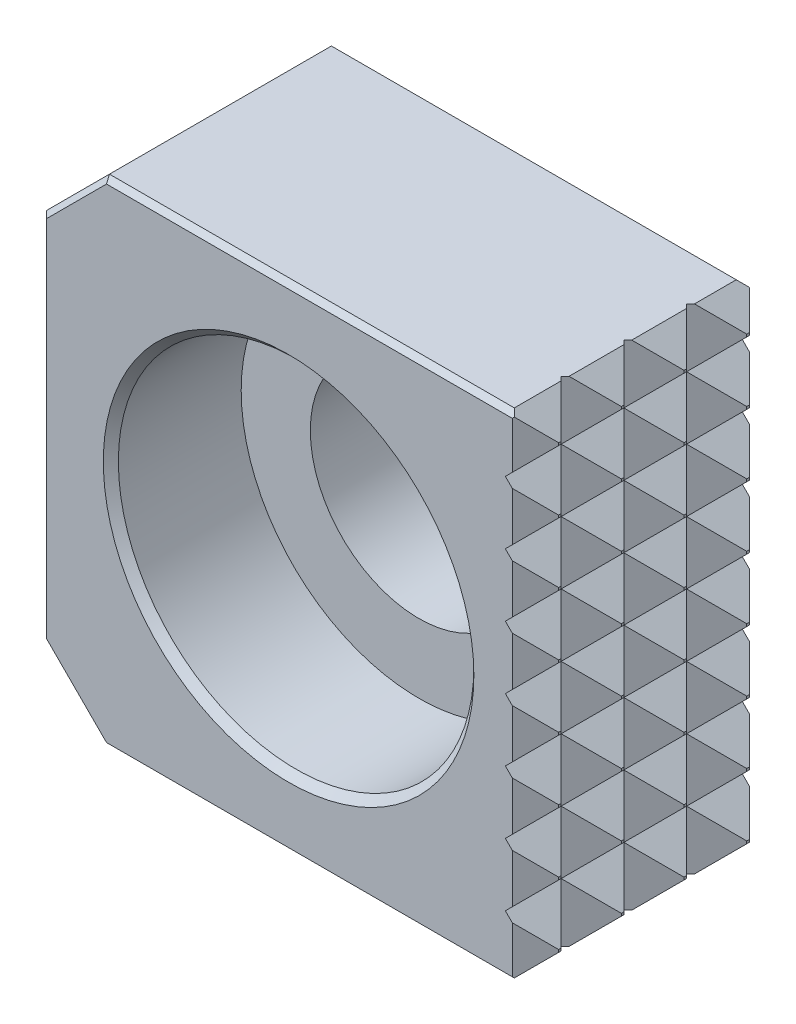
ISO-10303-21;
HEADER;
FILE_DESCRIPTION(('STEP AP214'),'2;1');
FILE_NAME('part.step','',(''),(''),'','','');
FILE_SCHEMA(('AUTOMOTIVE_DESIGN { 1 0 10303 214 1 1 1 1 }'));
ENDSEC;
DATA;
#1=APPLICATION_CONTEXT('core data for automotive mechanical design processes');
#2=APPLICATION_PROTOCOL_DEFINITION('international standard','automotive_design',2000,#1);
#3=PRODUCT_CONTEXT('',#1,'mechanical');
#4=PRODUCT('Part','Part','',(#3));
#5=PRODUCT_RELATED_PRODUCT_CATEGORY('part','',(#4));
#6=PRODUCT_DEFINITION_FORMATION('','',#4);
#7=PRODUCT_DEFINITION_CONTEXT('part definition',#1,'design');
#8=PRODUCT_DEFINITION('design','',#6,#7);
#9=PRODUCT_DEFINITION_SHAPE('','',#8);
#10=(LENGTH_UNIT() NAMED_UNIT(*) SI_UNIT(.MILLI.,.METRE.));
#11=(NAMED_UNIT(*) PLANE_ANGLE_UNIT() SI_UNIT($,.RADIAN.));
#12=(NAMED_UNIT(*) SI_UNIT($,.STERADIAN.) SOLID_ANGLE_UNIT());
#13=UNCERTAINTY_MEASURE_WITH_UNIT(LENGTH_MEASURE(1.E-05),#10,'distance_accuracy_value','');
#14=(GEOMETRIC_REPRESENTATION_CONTEXT(3) GLOBAL_UNCERTAINTY_ASSIGNED_CONTEXT((#13)) GLOBAL_UNIT_ASSIGNED_CONTEXT((#10,
#11,#12)) REPRESENTATION_CONTEXT('',''));
#15=CARTESIAN_POINT('',(0.,0.,0.));
#16=DIRECTION('',(0.,0.,1.));
#17=DIRECTION('',(1.,0.,0.));
#18=AXIS2_PLACEMENT_3D('',#15,#16,#17);
#19=CARTESIAN_POINT('',(12.5,-12.5,12.));
#20=DIRECTION('',(-1.,0.,0.));
#21=DIRECTION('',(0.,-1.,0.));
#22=AXIS2_PLACEMENT_3D('',#19,#20,#21);
#23=PLANE('',#22);
#24=DIRECTION('',(0.,-1.,0.));
#25=VECTOR('',#24,1.);
#26=CARTESIAN_POINT('',(12.5,-12.5,7.524));
#27=LINE('',#26,#25);
#28=CARTESIAN_POINT('',(12.5,-1.52399952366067,7.524));
#29=VERTEX_POINT('',#28);
#30=CARTESIAN_POINT('',(12.5,-1.65099952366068,7.524));
#31=VERTEX_POINT('',#30);
#32=EDGE_CURVE('E1188',#29,#31,#27,.T.);
#33=ORIENTED_EDGE('',*,*,#32,.F.);
#34=DIRECTION('',(0.,0.,-1.));
#35=VECTOR('',#34,1.);
#36=CARTESIAN_POINT('',(12.5,-1.52399952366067,12.));
#37=LINE('',#36,#35);
#38=CARTESIAN_POINT('',(12.5,-1.52399952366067,7.651));
#39=VERTEX_POINT('',#38);
#40=EDGE_CURVE('E3697',#39,#29,#37,.T.);
#41=ORIENTED_EDGE('',*,*,#40,.F.);
#42=DIRECTION('',(0.,1.,0.));
#43=VECTOR('',#42,1.);
#44=CARTESIAN_POINT('',(12.5,-12.5,7.651));
#45=LINE('',#44,#43);
#46=CARTESIAN_POINT('',(12.5,-1.65099952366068,7.651));
#47=VERTEX_POINT('',#46);
#48=EDGE_CURVE('E1131',#47,#39,#45,.T.);
#49=ORIENTED_EDGE('',*,*,#48,.F.);
#50=DIRECTION('',(0.,0.,1.));
#51=VECTOR('',#50,1.);
#52=CARTESIAN_POINT('',(12.5,-1.65099952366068,12.));
#53=LINE('',#52,#51);
#54=EDGE_CURVE('E1475',#31,#47,#53,.T.);
#55=ORIENTED_EDGE('',*,*,#54,.F.);
#56=EDGE_LOOP('',(#33,#41,#49,#55));
#57=FACE_BOUND('',#56,.T.);
#58=ADVANCED_FACE('F14',(#57),#23,.F.);
#59=CARTESIAN_POINT('',(12.5,-1.52399952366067,4.476));
#60=VERTEX_POINT('',#59);
#61=CARTESIAN_POINT('',(12.5,-1.52399952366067,4.34900000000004));
#62=VERTEX_POINT('',#61);
#63=EDGE_CURVE('E1480',#60,#62,#37,.T.);
#64=ORIENTED_EDGE('',*,*,#63,.F.);
#65=DIRECTION('',(0.,-1.,0.));
#66=VECTOR('',#65,1.);
#67=CARTESIAN_POINT('',(12.5,-12.5,4.476));
#68=LINE('',#67,#66);
#69=CARTESIAN_POINT('',(12.5,-1.65099952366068,4.476));
#70=VERTEX_POINT('',#69);
#71=EDGE_CURVE('E1246',#60,#70,#68,.T.);
#72=ORIENTED_EDGE('',*,*,#71,.T.);
#73=CARTESIAN_POINT('',(12.5,-1.65099952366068,4.34900000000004));
#74=VERTEX_POINT('',#73);
#75=EDGE_CURVE('E3693',#74,#70,#53,.T.);
#76=ORIENTED_EDGE('',*,*,#75,.F.);
#77=DIRECTION('',(0.,1.,0.));
#78=VECTOR('',#77,1.);
#79=CARTESIAN_POINT('',(12.5,-12.5,4.34900000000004));
#80=LINE('',#79,#78);
#81=EDGE_CURVE('E814',#74,#62,#80,.T.);
#82=ORIENTED_EDGE('',*,*,#81,.T.);
#83=EDGE_LOOP('',(#64,#72,#76,#82));
#84=FACE_BOUND('',#83,.T.);
#85=ADVANCED_FACE('F1620',(#84),#23,.F.);
#86=DIRECTION('',(0.,-1.,0.));
#87=VECTOR('',#86,1.);
#88=CARTESIAN_POINT('',(12.5,-12.5,10.699));
#89=LINE('',#88,#87);
#90=CARTESIAN_POINT('',(12.5,-1.52399952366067,10.699));
#91=VERTEX_POINT('',#90);
#92=CARTESIAN_POINT('',(12.5,-1.65099952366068,10.699));
#93=VERTEX_POINT('',#92);
#94=EDGE_CURVE('E1075',#91,#93,#89,.T.);
#95=ORIENTED_EDGE('',*,*,#94,.F.);
#96=CARTESIAN_POINT('',(12.5,-1.52399952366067,10.826));
#97=VERTEX_POINT('',#96);
#98=EDGE_CURVE('E1481',#97,#91,#37,.T.);
#99=ORIENTED_EDGE('',*,*,#98,.F.);
#100=DIRECTION('',(0.,1.,0.));
#101=VECTOR('',#100,1.);
#102=CARTESIAN_POINT('',(12.5,-12.5,10.826));
#103=LINE('',#102,#101);
#104=CARTESIAN_POINT('',(12.5,-1.65099952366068,10.826));
#105=VERTEX_POINT('',#104);
#106=EDGE_CURVE('E1010',#105,#97,#103,.T.);
#107=ORIENTED_EDGE('',*,*,#106,.F.);
#108=EDGE_CURVE('E1472',#93,#105,#53,.T.);
#109=ORIENTED_EDGE('',*,*,#108,.F.);
#110=EDGE_LOOP('',(#95,#99,#107,#109));
#111=FACE_BOUND('',#110,.T.);
#112=ADVANCED_FACE('F1627',(#111),#23,.F.);
#113=CARTESIAN_POINT('',(12.5,-1.65099952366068,1.17400000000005));
#114=VERTEX_POINT('',#113);
#115=CARTESIAN_POINT('',(12.5,-1.65099952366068,1.30100000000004));
#116=VERTEX_POINT('',#115);
#117=EDGE_CURVE('E1476',#114,#116,#53,.T.);
#118=ORIENTED_EDGE('',*,*,#117,.F.);
#119=DIRECTION('',(0.,1.,0.));
#120=VECTOR('',#119,1.);
#121=CARTESIAN_POINT('',(12.5,-12.5,1.17400000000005));
#122=LINE('',#121,#120);
#123=CARTESIAN_POINT('',(12.5,-1.52399952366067,1.17400000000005));
#124=VERTEX_POINT('',#123);
#125=EDGE_CURVE('E937',#114,#124,#122,.T.);
#126=ORIENTED_EDGE('',*,*,#125,.T.);
#127=CARTESIAN_POINT('',(12.5,-1.52399952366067,1.30100000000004));
#128=VERTEX_POINT('',#127);
#129=EDGE_CURVE('E1477',#128,#124,#37,.T.);
#130=ORIENTED_EDGE('',*,*,#129,.F.);
#131=DIRECTION('',(0.,-1.,0.));
#132=VECTOR('',#131,1.);
#133=CARTESIAN_POINT('',(12.5,-12.5,1.30100000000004));
#134=LINE('',#133,#132);
#135=EDGE_CURVE('E877',#128,#116,#134,.T.);
#136=ORIENTED_EDGE('',*,*,#135,.T.);
#137=EDGE_LOOP('',(#118,#126,#130,#136));
#138=FACE_BOUND('',#137,.T.);
#139=ADVANCED_FACE('F2581',(#138),#23,.F.);
#140=DIRECTION('',(0.,-1.,0.));
#141=VECTOR('',#140,1.);
#142=CARTESIAN_POINT('',(12.5,-12.5,7.524));
#143=LINE('',#142,#141);
#144=CARTESIAN_POINT('',(12.5,1.65099952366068,7.524));
#145=VERTEX_POINT('',#144);
#146=CARTESIAN_POINT('',(12.5,1.52399952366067,7.524));
#147=VERTEX_POINT('',#146);
#148=EDGE_CURVE('E1186',#145,#147,#143,.T.);
#149=ORIENTED_EDGE('',*,*,#148,.F.);
#150=DIRECTION('',(0.,0.,1.));
#151=VECTOR('',#150,1.);
#152=CARTESIAN_POINT('',(12.5,1.65099952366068,12.));
#153=LINE('',#152,#151);
#154=CARTESIAN_POINT('',(12.5,1.65099952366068,7.651));
#155=VERTEX_POINT('',#154);
#156=EDGE_CURVE('E1410',#145,#155,#153,.T.);
#157=ORIENTED_EDGE('',*,*,#156,.T.);
#158=DIRECTION('',(0.,1.,0.));
#159=VECTOR('',#158,1.);
#160=CARTESIAN_POINT('',(12.5,-12.5,7.651));
#161=LINE('',#160,#159);
#162=CARTESIAN_POINT('',(12.5,1.52399952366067,7.651));
#163=VERTEX_POINT('',#162);
#164=EDGE_CURVE('E1129',#163,#155,#161,.T.);
#165=ORIENTED_EDGE('',*,*,#164,.F.);
#166=DIRECTION('',(0.,0.,-1.));
#167=VECTOR('',#166,1.);
#168=CARTESIAN_POINT('',(12.5,1.52399952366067,12.));
#169=LINE('',#168,#167);
#170=EDGE_CURVE('E3729',#163,#147,#169,.T.);
#171=ORIENTED_EDGE('',*,*,#170,.T.);
#172=EDGE_LOOP('',(#149,#157,#165,#171));
#173=FACE_BOUND('',#172,.T.);
#174=ADVANCED_FACE('F2572',(#173),#23,.F.);
#175=CARTESIAN_POINT('',(12.5,1.65099952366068,4.34900000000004));
#176=VERTEX_POINT('',#175);
#177=CARTESIAN_POINT('',(12.5,1.65099952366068,4.476));
#178=VERTEX_POINT('',#177);
#179=EDGE_CURVE('E3715',#176,#178,#153,.T.);
#180=ORIENTED_EDGE('',*,*,#179,.T.);
#181=DIRECTION('',(0.,-1.,0.));
#182=VECTOR('',#181,1.);
#183=CARTESIAN_POINT('',(12.5,-12.5,4.476));
#184=LINE('',#183,#182);
#185=CARTESIAN_POINT('',(12.5,1.52399952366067,4.476));
#186=VERTEX_POINT('',#185);
#187=EDGE_CURVE('E1243',#178,#186,#184,.T.);
#188=ORIENTED_EDGE('',*,*,#187,.T.);
#189=CARTESIAN_POINT('',(12.5,1.52399952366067,4.34900000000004));
#190=VERTEX_POINT('',#189);
#191=EDGE_CURVE('E1485',#186,#190,#169,.T.);
#192=ORIENTED_EDGE('',*,*,#191,.T.);
#193=DIRECTION('',(0.,1.,0.));
#194=VECTOR('',#193,1.);
#195=CARTESIAN_POINT('',(12.5,-12.5,4.34900000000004));
#196=LINE('',#195,#194);
#197=EDGE_CURVE('E811',#190,#176,#196,.T.);
#198=ORIENTED_EDGE('',*,*,#197,.T.);
#199=EDGE_LOOP('',(#180,#188,#192,#198));
#200=FACE_BOUND('',#199,.T.);
#201=ADVANCED_FACE('F2563',(#200),#23,.F.);
#202=DIRECTION('',(0.,-1.,0.));
#203=VECTOR('',#202,1.);
#204=CARTESIAN_POINT('',(12.5,-12.5,10.699));
#205=LINE('',#204,#203);
#206=CARTESIAN_POINT('',(12.5,1.65099952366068,10.699));
#207=VERTEX_POINT('',#206);
#208=CARTESIAN_POINT('',(12.5,1.52399952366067,10.699));
#209=VERTEX_POINT('',#208);
#210=EDGE_CURVE('E1073',#207,#209,#205,.T.);
#211=ORIENTED_EDGE('',*,*,#210,.F.);
#212=CARTESIAN_POINT('',(12.5,1.65099952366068,10.826));
#213=VERTEX_POINT('',#212);
#214=EDGE_CURVE('E1369',#207,#213,#153,.T.);
#215=ORIENTED_EDGE('',*,*,#214,.T.);
#216=DIRECTION('',(0.,1.,0.));
#217=VECTOR('',#216,1.);
#218=CARTESIAN_POINT('',(12.5,-12.5,10.826));
#219=LINE('',#218,#217);
#220=CARTESIAN_POINT('',(12.5,1.52399952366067,10.826));
#221=VERTEX_POINT('',#220);
#222=EDGE_CURVE('E1019',#221,#213,#219,.T.);
#223=ORIENTED_EDGE('',*,*,#222,.F.);
#224=EDGE_CURVE('E1486',#221,#209,#169,.T.);
#225=ORIENTED_EDGE('',*,*,#224,.T.);
#226=EDGE_LOOP('',(#211,#215,#223,#225));
#227=FACE_BOUND('',#226,.T.);
#228=ADVANCED_FACE('F2554',(#227),#23,.F.);
#229=CARTESIAN_POINT('',(12.5,1.52399952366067,1.30100000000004));
#230=VERTEX_POINT('',#229);
#231=CARTESIAN_POINT('',(12.5,1.52399952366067,1.17400000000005));
#232=VERTEX_POINT('',#231);
#233=EDGE_CURVE('E1482',#230,#232,#169,.T.);
#234=ORIENTED_EDGE('',*,*,#233,.T.);
#235=DIRECTION('',(0.,1.,0.));
#236=VECTOR('',#235,1.);
#237=CARTESIAN_POINT('',(12.5,-12.5,1.17400000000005));
#238=LINE('',#237,#236);
#239=CARTESIAN_POINT('',(12.5,1.65099952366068,1.17400000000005));
#240=VERTEX_POINT('',#239);
#241=EDGE_CURVE('E947',#232,#240,#238,.T.);
#242=ORIENTED_EDGE('',*,*,#241,.T.);
#243=CARTESIAN_POINT('',(12.5,1.65099952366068,1.30100000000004));
#244=VERTEX_POINT('',#243);
#245=EDGE_CURVE('E1411',#240,#244,#153,.T.);
#246=ORIENTED_EDGE('',*,*,#245,.T.);
#247=DIRECTION('',(0.,-1.,0.));
#248=VECTOR('',#247,1.);
#249=CARTESIAN_POINT('',(12.5,-12.5,1.30100000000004));
#250=LINE('',#249,#248);
#251=EDGE_CURVE('E874',#244,#230,#250,.T.);
#252=ORIENTED_EDGE('',*,*,#251,.T.);
#253=EDGE_LOOP('',(#234,#242,#246,#252));
#254=FACE_BOUND('',#253,.T.);
#255=ADVANCED_FACE('F2546',(#254),#23,.F.);
#256=DIRECTION('',(0.,-1.,0.));
#257=VECTOR('',#256,1.);
#258=CARTESIAN_POINT('',(12.5,-12.5,7.524));
#259=LINE('',#258,#257);
#260=CARTESIAN_POINT('',(12.5,-4.6989995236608,7.524));
#261=VERTEX_POINT('',#260);
#262=CARTESIAN_POINT('',(12.5,-4.82599952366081,7.524));
#263=VERTEX_POINT('',#262);
#264=EDGE_CURVE('E1198',#261,#263,#259,.T.);
#265=ORIENTED_EDGE('',*,*,#264,.F.);
#266=DIRECTION('',(0.,0.,-1.));
#267=VECTOR('',#266,1.);
#268=CARTESIAN_POINT('',(12.5,-4.6989995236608,12.));
#269=LINE('',#268,#267);
#270=CARTESIAN_POINT('',(12.5,-4.6989995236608,7.651));
#271=VERTEX_POINT('',#270);
#272=EDGE_CURVE('E1819',#271,#261,#269,.T.);
#273=ORIENTED_EDGE('',*,*,#272,.F.);
#274=DIRECTION('',(0.,1.,0.));
#275=VECTOR('',#274,1.);
#276=CARTESIAN_POINT('',(12.5,-12.5,7.651));
#277=LINE('',#276,#275);
#278=CARTESIAN_POINT('',(12.5,-4.82599952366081,7.651));
#279=VERTEX_POINT('',#278);
#280=EDGE_CURVE('E1142',#279,#271,#277,.T.);
#281=ORIENTED_EDGE('',*,*,#280,.F.);
#282=DIRECTION('',(0.,0.,1.));
#283=VECTOR('',#282,1.);
#284=CARTESIAN_POINT('',(12.5,-4.82599952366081,12.));
#285=LINE('',#284,#283);
#286=EDGE_CURVE('E1465',#263,#279,#285,.T.);
#287=ORIENTED_EDGE('',*,*,#286,.F.);
#288=EDGE_LOOP('',(#265,#273,#281,#287));
#289=FACE_BOUND('',#288,.T.);
#290=ADVANCED_FACE('F1816',(#289),#23,.F.);
#291=CARTESIAN_POINT('',(12.5,-4.6989995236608,4.476));
#292=VERTEX_POINT('',#291);
#293=CARTESIAN_POINT('',(12.5,-4.6989995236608,4.34900000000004));
#294=VERTEX_POINT('',#293);
#295=EDGE_CURVE('E1470',#292,#294,#269,.T.);
#296=ORIENTED_EDGE('',*,*,#295,.F.);
#297=DIRECTION('',(0.,-1.,0.));
#298=VECTOR('',#297,1.);
#299=CARTESIAN_POINT('',(12.5,-12.5,4.476));
#300=LINE('',#299,#298);
#301=CARTESIAN_POINT('',(12.5,-4.82599952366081,4.476));
#302=VERTEX_POINT('',#301);
#303=EDGE_CURVE('E1257',#292,#302,#300,.T.);
#304=ORIENTED_EDGE('',*,*,#303,.T.);
#305=CARTESIAN_POINT('',(12.5,-4.82599952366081,4.34900000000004));
#306=VERTEX_POINT('',#305);
#307=EDGE_CURVE('E1800',#306,#302,#285,.T.);
#308=ORIENTED_EDGE('',*,*,#307,.F.);
#309=DIRECTION('',(0.,1.,0.));
#310=VECTOR('',#309,1.);
#311=CARTESIAN_POINT('',(12.5,-12.5,4.34900000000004));
#312=LINE('',#311,#310);
#313=EDGE_CURVE('E825',#306,#294,#312,.T.);
#314=ORIENTED_EDGE('',*,*,#313,.T.);
#315=EDGE_LOOP('',(#296,#304,#308,#314));
#316=FACE_BOUND('',#315,.T.);
#317=ADVANCED_FACE('F1846',(#316),#23,.F.);
#318=DIRECTION('',(0.,-1.,0.));
#319=VECTOR('',#318,1.);
#320=CARTESIAN_POINT('',(12.5,-12.5,10.699));
#321=LINE('',#320,#319);
#322=CARTESIAN_POINT('',(12.5,-4.6989995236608,10.699));
#323=VERTEX_POINT('',#322);
#324=CARTESIAN_POINT('',(12.5,-4.82599952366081,10.699));
#325=VERTEX_POINT('',#324);
#326=EDGE_CURVE('E1085',#323,#325,#321,.T.);
#327=ORIENTED_EDGE('',*,*,#326,.F.);
#328=CARTESIAN_POINT('',(12.5,-4.6989995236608,10.826));
#329=VERTEX_POINT('',#328);
#330=EDGE_CURVE('E1471',#329,#323,#269,.T.);
#331=ORIENTED_EDGE('',*,*,#330,.F.);
#332=DIRECTION('',(0.,1.,0.));
#333=VECTOR('',#332,1.);
#334=CARTESIAN_POINT('',(12.5,-12.5,10.826));
#335=LINE('',#334,#333);
#336=CARTESIAN_POINT('',(12.5,-4.82599952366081,10.826));
#337=VERTEX_POINT('',#336);
#338=EDGE_CURVE('E1027',#337,#329,#335,.T.);
#339=ORIENTED_EDGE('',*,*,#338,.F.);
#340=EDGE_CURVE('E1462',#325,#337,#285,.T.);
#341=ORIENTED_EDGE('',*,*,#340,.F.);
#342=EDGE_LOOP('',(#327,#331,#339,#341));
#343=FACE_BOUND('',#342,.T.);
#344=ADVANCED_FACE('F2523',(#343),#23,.F.);
#345=CARTESIAN_POINT('',(12.5,-4.82599952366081,1.17400000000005));
#346=VERTEX_POINT('',#345);
#347=CARTESIAN_POINT('',(12.5,-4.82599952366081,1.30100000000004));
#348=VERTEX_POINT('',#347);
#349=EDGE_CURVE('E1466',#346,#348,#285,.T.);
#350=ORIENTED_EDGE('',*,*,#349,.F.);
#351=DIRECTION('',(0.,1.,0.));
#352=VECTOR('',#351,1.);
#353=CARTESIAN_POINT('',(12.5,-12.5,1.17400000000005));
#354=LINE('',#353,#352);
#355=CARTESIAN_POINT('',(12.5,-4.6989995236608,1.17400000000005));
#356=VERTEX_POINT('',#355);
#357=EDGE_CURVE('E956',#346,#356,#354,.T.);
#358=ORIENTED_EDGE('',*,*,#357,.T.);
#359=CARTESIAN_POINT('',(12.5,-4.6989995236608,1.30100000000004));
#360=VERTEX_POINT('',#359);
#361=EDGE_CURVE('E1467',#360,#356,#269,.T.);
#362=ORIENTED_EDGE('',*,*,#361,.F.);
#363=DIRECTION('',(0.,-1.,0.));
#364=VECTOR('',#363,1.);
#365=CARTESIAN_POINT('',(12.5,-12.5,1.30100000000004));
#366=LINE('',#365,#364);
#367=EDGE_CURVE('E888',#360,#348,#366,.T.);
#368=ORIENTED_EDGE('',*,*,#367,.T.);
#369=EDGE_LOOP('',(#350,#358,#362,#368));
#370=FACE_BOUND('',#369,.T.);
#371=ADVANCED_FACE('F1796',(#370),#23,.F.);
#372=DIRECTION('',(0.,-1.,0.));
#373=VECTOR('',#372,1.);
#374=CARTESIAN_POINT('',(12.5,-12.5,7.524));
#375=LINE('',#374,#373);
#376=CARTESIAN_POINT('',(12.5,-7.87399952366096,7.524));
#377=VERTEX_POINT('',#376);
#378=CARTESIAN_POINT('',(12.5,-8.00099952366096,7.524));
#379=VERTEX_POINT('',#378);
#380=EDGE_CURVE('E1211',#377,#379,#375,.T.);
#381=ORIENTED_EDGE('',*,*,#380,.F.);
#382=DIRECTION('',(0.,0.,-1.));
#383=VECTOR('',#382,1.);
#384=CARTESIAN_POINT('',(12.5,-7.87399952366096,12.));
#385=LINE('',#384,#383);
#386=CARTESIAN_POINT('',(12.5,-7.87399952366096,7.651));
#387=VERTEX_POINT('',#386);
#388=EDGE_CURVE('E1898',#387,#377,#385,.T.);
#389=ORIENTED_EDGE('',*,*,#388,.F.);
#390=DIRECTION('',(0.,1.,0.));
#391=VECTOR('',#390,1.);
#392=CARTESIAN_POINT('',(12.5,-12.5,7.651));
#393=LINE('',#392,#391);
#394=CARTESIAN_POINT('',(12.5,-8.00099952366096,7.651));
#395=VERTEX_POINT('',#394);
#396=EDGE_CURVE('E1154',#395,#387,#393,.T.);
#397=ORIENTED_EDGE('',*,*,#396,.F.);
#398=DIRECTION('',(0.,0.,1.));
#399=VECTOR('',#398,1.);
#400=CARTESIAN_POINT('',(12.5,-8.00099952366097,12.));
#401=LINE('',#400,#399);
#402=EDGE_CURVE('E1455',#379,#395,#401,.T.);
#403=ORIENTED_EDGE('',*,*,#402,.F.);
#404=EDGE_LOOP('',(#381,#389,#397,#403));
#405=FACE_BOUND('',#404,.T.);
#406=ADVANCED_FACE('F1895',(#405),#23,.F.);
#407=CARTESIAN_POINT('',(12.5,-7.87399952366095,4.476));
#408=VERTEX_POINT('',#407);
#409=CARTESIAN_POINT('',(12.5,-7.87399952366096,4.34900000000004));
#410=VERTEX_POINT('',#409);
#411=EDGE_CURVE('E1460',#408,#410,#385,.T.);
#412=ORIENTED_EDGE('',*,*,#411,.F.);
#413=DIRECTION('',(0.,-1.,0.));
#414=VECTOR('',#413,1.);
#415=CARTESIAN_POINT('',(12.5,-12.5,4.476));
#416=LINE('',#415,#414);
#417=CARTESIAN_POINT('',(12.5,-8.00099952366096,4.476));
#418=VERTEX_POINT('',#417);
#419=EDGE_CURVE('E1271',#408,#418,#416,.T.);
#420=ORIENTED_EDGE('',*,*,#419,.T.);
#421=CARTESIAN_POINT('',(12.5,-8.00099952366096,4.34900000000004));
#422=VERTEX_POINT('',#421);
#423=EDGE_CURVE('E1879',#422,#418,#401,.T.);
#424=ORIENTED_EDGE('',*,*,#423,.F.);
#425=DIRECTION('',(0.,1.,0.));
#426=VECTOR('',#425,1.);
#427=CARTESIAN_POINT('',(12.5,-12.5,4.34900000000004));
#428=LINE('',#427,#426);
#429=EDGE_CURVE('E839',#422,#410,#428,.T.);
#430=ORIENTED_EDGE('',*,*,#429,.T.);
#431=EDGE_LOOP('',(#412,#420,#424,#430));
#432=FACE_BOUND('',#431,.T.);
#433=ADVANCED_FACE('F2499',(#432),#23,.F.);
#434=DIRECTION('',(0.,-1.,0.));
#435=VECTOR('',#434,1.);
#436=CARTESIAN_POINT('',(12.5,-12.5,10.699));
#437=LINE('',#436,#435);
#438=CARTESIAN_POINT('',(12.5,-7.87399952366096,10.699));
#439=VERTEX_POINT('',#438);
#440=CARTESIAN_POINT('',(12.5,-8.00099952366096,10.699));
#441=VERTEX_POINT('',#440);
#442=EDGE_CURVE('E1098',#439,#441,#437,.T.);
#443=ORIENTED_EDGE('',*,*,#442,.F.);
#444=CARTESIAN_POINT('',(12.5,-7.87399952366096,10.826));
#445=VERTEX_POINT('',#444);
#446=EDGE_CURVE('E1461',#445,#439,#385,.T.);
#447=ORIENTED_EDGE('',*,*,#446,.F.);
#448=DIRECTION('',(0.,1.,0.));
#449=VECTOR('',#448,1.);
#450=CARTESIAN_POINT('',(12.5,-12.5,10.826));
#451=LINE('',#450,#449);
#452=CARTESIAN_POINT('',(12.5,-8.00099952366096,10.826));
#453=VERTEX_POINT('',#452);
#454=EDGE_CURVE('E1036',#453,#445,#451,.T.);
#455=ORIENTED_EDGE('',*,*,#454,.F.);
#456=EDGE_CURVE('E1452',#441,#453,#401,.T.);
#457=ORIENTED_EDGE('',*,*,#456,.F.);
#458=EDGE_LOOP('',(#443,#447,#455,#457));
#459=FACE_BOUND('',#458,.T.);
#460=ADVANCED_FACE('F2491',(#459),#23,.F.);
#461=CARTESIAN_POINT('',(12.5,-8.00099952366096,1.17400000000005));
#462=VERTEX_POINT('',#461);
#463=CARTESIAN_POINT('',(12.5,-8.00099952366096,1.30100000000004));
#464=VERTEX_POINT('',#463);
#465=EDGE_CURVE('E1456',#462,#464,#401,.T.);
#466=ORIENTED_EDGE('',*,*,#465,.F.);
#467=DIRECTION('',(0.,1.,0.));
#468=VECTOR('',#467,1.);
#469=CARTESIAN_POINT('',(12.5,-12.5,1.17400000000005));
#470=LINE('',#469,#468);
#471=CARTESIAN_POINT('',(12.5,-7.87399952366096,1.17400000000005));
#472=VERTEX_POINT('',#471);
#473=EDGE_CURVE('E964',#462,#472,#470,.T.);
#474=ORIENTED_EDGE('',*,*,#473,.T.);
#475=CARTESIAN_POINT('',(12.5,-7.87399952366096,1.30100000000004));
#476=VERTEX_POINT('',#475);
#477=EDGE_CURVE('E1457',#476,#472,#385,.T.);
#478=ORIENTED_EDGE('',*,*,#477,.F.);
#479=DIRECTION('',(0.,-1.,0.));
#480=VECTOR('',#479,1.);
#481=CARTESIAN_POINT('',(12.5,-12.5,1.30100000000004));
#482=LINE('',#481,#480);
#483=EDGE_CURVE('E902',#476,#464,#482,.T.);
#484=ORIENTED_EDGE('',*,*,#483,.T.);
#485=EDGE_LOOP('',(#466,#474,#478,#484));
#486=FACE_BOUND('',#485,.T.);
#487=ADVANCED_FACE('F1875',(#486),#23,.F.);
#488=DIRECTION('',(0.,-1.,0.));
#489=VECTOR('',#488,1.);
#490=CARTESIAN_POINT('',(12.5,-12.5,7.524));
#491=LINE('',#490,#489);
#492=CARTESIAN_POINT('',(12.5,-11.048999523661,7.524));
#493=VERTEX_POINT('',#492);
#494=CARTESIAN_POINT('',(12.5,-11.175999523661,7.524));
#495=VERTEX_POINT('',#494);
#496=EDGE_CURVE('E1221',#493,#495,#491,.T.);
#497=ORIENTED_EDGE('',*,*,#496,.F.);
#498=DIRECTION('',(0.,0.,-1.));
#499=VECTOR('',#498,1.);
#500=CARTESIAN_POINT('',(12.5,-11.048999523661,12.));
#501=LINE('',#500,#499);
#502=CARTESIAN_POINT('',(12.5,-11.048999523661,7.651));
#503=VERTEX_POINT('',#502);
#504=EDGE_CURVE('E2156',#503,#493,#501,.T.);
#505=ORIENTED_EDGE('',*,*,#504,.F.);
#506=DIRECTION('',(0.,1.,0.));
#507=VECTOR('',#506,1.);
#508=CARTESIAN_POINT('',(12.5,-12.5,7.651));
#509=LINE('',#508,#507);
#510=CARTESIAN_POINT('',(12.5,-11.175999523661,7.651));
#511=VERTEX_POINT('',#510);
#512=EDGE_CURVE('E1165',#511,#503,#509,.T.);
#513=ORIENTED_EDGE('',*,*,#512,.F.);
#514=DIRECTION('',(0.,0.,1.));
#515=VECTOR('',#514,1.);
#516=CARTESIAN_POINT('',(12.5,-11.175999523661,12.));
#517=LINE('',#516,#515);
#518=EDGE_CURVE('E1445',#495,#511,#517,.T.);
#519=ORIENTED_EDGE('',*,*,#518,.F.);
#520=EDGE_LOOP('',(#497,#505,#513,#519));
#521=FACE_BOUND('',#520,.T.);
#522=ADVANCED_FACE('F2153',(#521),#23,.F.);
#523=CARTESIAN_POINT('',(12.5,-11.048999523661,4.476));
#524=VERTEX_POINT('',#523);
#525=CARTESIAN_POINT('',(12.5,-11.048999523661,4.34900000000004));
#526=VERTEX_POINT('',#525);
#527=EDGE_CURVE('E1450',#524,#526,#501,.T.);
#528=ORIENTED_EDGE('',*,*,#527,.F.);
#529=DIRECTION('',(0.,-1.,0.));
#530=VECTOR('',#529,1.);
#531=CARTESIAN_POINT('',(12.5,-12.5,4.476));
#532=LINE('',#531,#530);
#533=CARTESIAN_POINT('',(12.5,-11.175999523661,4.476));
#534=VERTEX_POINT('',#533);
#535=EDGE_CURVE('E1282',#524,#534,#532,.T.);
#536=ORIENTED_EDGE('',*,*,#535,.T.);
#537=CARTESIAN_POINT('',(12.5,-11.175999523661,4.34900000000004));
#538=VERTEX_POINT('',#537);
#539=EDGE_CURVE('E2145',#538,#534,#517,.T.);
#540=ORIENTED_EDGE('',*,*,#539,.F.);
#541=DIRECTION('',(0.,1.,0.));
#542=VECTOR('',#541,1.);
#543=CARTESIAN_POINT('',(12.5,-12.5,4.34900000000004));
#544=LINE('',#543,#542);
#545=EDGE_CURVE('E849',#538,#526,#544,.T.);
#546=ORIENTED_EDGE('',*,*,#545,.T.);
#547=EDGE_LOOP('',(#528,#536,#540,#546));
#548=FACE_BOUND('',#547,.T.);
#549=ADVANCED_FACE('F2180',(#548),#23,.F.);
#550=DIRECTION('',(0.,-1.,0.));
#551=VECTOR('',#550,1.);
#552=CARTESIAN_POINT('',(12.5,-12.5,10.699));
#553=LINE('',#552,#551);
#554=CARTESIAN_POINT('',(12.5,-11.048999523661,10.699));
#555=VERTEX_POINT('',#554);
#556=CARTESIAN_POINT('',(12.5,-11.175999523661,10.699));
#557=VERTEX_POINT('',#556);
#558=EDGE_CURVE('E1108',#555,#557,#553,.T.);
#559=ORIENTED_EDGE('',*,*,#558,.F.);
#560=CARTESIAN_POINT('',(12.5,-11.048999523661,10.826));
#561=VERTEX_POINT('',#560);
#562=EDGE_CURVE('E1451',#561,#555,#501,.T.);
#563=ORIENTED_EDGE('',*,*,#562,.F.);
#564=DIRECTION('',(0.,1.,0.));
#565=VECTOR('',#564,1.);
#566=CARTESIAN_POINT('',(12.5,-12.5,10.826));
#567=LINE('',#566,#565);
#568=CARTESIAN_POINT('',(12.5,-11.175999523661,10.826));
#569=VERTEX_POINT('',#568);
#570=EDGE_CURVE('E1044',#569,#561,#567,.T.);
#571=ORIENTED_EDGE('',*,*,#570,.F.);
#572=EDGE_CURVE('E1442',#557,#569,#517,.T.);
#573=ORIENTED_EDGE('',*,*,#572,.F.);
#574=EDGE_LOOP('',(#559,#563,#571,#573));
#575=FACE_BOUND('',#574,.T.);
#576=ADVANCED_FACE('F2173',(#575),#23,.F.);
#577=CARTESIAN_POINT('',(12.5,-11.175999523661,1.17400000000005));
#578=VERTEX_POINT('',#577);
#579=CARTESIAN_POINT('',(12.5,-11.175999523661,1.30100000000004));
#580=VERTEX_POINT('',#579);
#581=EDGE_CURVE('E1446',#578,#580,#517,.T.);
#582=ORIENTED_EDGE('',*,*,#581,.F.);
#583=DIRECTION('',(0.,1.,0.));
#584=VECTOR('',#583,1.);
#585=CARTESIAN_POINT('',(12.5,-12.5,1.17400000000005));
#586=LINE('',#585,#584);
#587=CARTESIAN_POINT('',(12.5,-11.048999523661,1.17400000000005));
#588=VERTEX_POINT('',#587);
#589=EDGE_CURVE('E972',#578,#588,#586,.T.);
#590=ORIENTED_EDGE('',*,*,#589,.T.);
#591=CARTESIAN_POINT('',(12.5,-11.048999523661,1.30100000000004));
#592=VERTEX_POINT('',#591);
#593=EDGE_CURVE('E1447',#592,#588,#501,.T.);
#594=ORIENTED_EDGE('',*,*,#593,.F.);
#595=DIRECTION('',(0.,-1.,0.));
#596=VECTOR('',#595,1.);
#597=CARTESIAN_POINT('',(12.5,-12.5,1.30100000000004));
#598=LINE('',#597,#596);
#599=EDGE_CURVE('E911',#592,#580,#598,.T.);
#600=ORIENTED_EDGE('',*,*,#599,.T.);
#601=EDGE_LOOP('',(#582,#590,#594,#600));
#602=FACE_BOUND('',#601,.T.);
#603=ADVANCED_FACE('F2170',(#602),#23,.F.);
#604=DIRECTION('',(0.,-1.,0.));
#605=VECTOR('',#604,1.);
#606=CARTESIAN_POINT('',(12.5,-12.5,7.524));
#607=LINE('',#606,#605);
#608=CARTESIAN_POINT('',(12.5,11.1759995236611,7.524));
#609=VERTEX_POINT('',#608);
#610=CARTESIAN_POINT('',(12.5,11.0489995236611,7.524));
#611=VERTEX_POINT('',#610);
#612=EDGE_CURVE('E1236',#609,#611,#607,.T.);
#613=ORIENTED_EDGE('',*,*,#612,.F.);
#614=DIRECTION('',(0.,0.,1.));
#615=VECTOR('',#614,1.);
#616=CARTESIAN_POINT('',(12.5,11.1759995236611,12.));
#617=LINE('',#616,#615);
#618=CARTESIAN_POINT('',(12.5,11.1759995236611,7.651));
#619=VERTEX_POINT('',#618);
#620=EDGE_CURVE('E1440',#609,#619,#617,.T.);
#621=ORIENTED_EDGE('',*,*,#620,.T.);
#622=DIRECTION('',(0.,1.,0.));
#623=VECTOR('',#622,1.);
#624=CARTESIAN_POINT('',(12.5,-12.5,7.651));
#625=LINE('',#624,#623);
#626=CARTESIAN_POINT('',(12.5,11.0489995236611,7.651));
#627=VERTEX_POINT('',#626);
#628=EDGE_CURVE('E1179',#627,#619,#625,.T.);
#629=ORIENTED_EDGE('',*,*,#628,.F.);
#630=DIRECTION('',(0.,0.,-1.));
#631=VECTOR('',#630,1.);
#632=CARTESIAN_POINT('',(12.5,11.0489995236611,12.));
#633=LINE('',#632,#631);
#634=EDGE_CURVE('E3610',#627,#611,#633,.T.);
#635=ORIENTED_EDGE('',*,*,#634,.T.);
#636=EDGE_LOOP('',(#613,#621,#629,#635));
#637=FACE_BOUND('',#636,.T.);
#638=ADVANCED_FACE('F2172',(#637),#23,.F.);
#639=CARTESIAN_POINT('',(12.5,11.1759995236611,4.34900000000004));
#640=VERTEX_POINT('',#639);
#641=CARTESIAN_POINT('',(12.5,11.1759995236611,4.476));
#642=VERTEX_POINT('',#641);
#643=EDGE_CURVE('E3662',#640,#642,#617,.T.);
#644=ORIENTED_EDGE('',*,*,#643,.T.);
#645=DIRECTION('',(0.,-1.,0.));
#646=VECTOR('',#645,1.);
#647=CARTESIAN_POINT('',(12.5,-12.5,4.476));
#648=LINE('',#647,#646);
#649=CARTESIAN_POINT('',(12.5,11.0489995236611,4.476));
#650=VERTEX_POINT('',#649);
#651=EDGE_CURVE('E1299',#642,#650,#648,.T.);
#652=ORIENTED_EDGE('',*,*,#651,.T.);
#653=CARTESIAN_POINT('',(12.5,11.0489995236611,4.34900000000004));
#654=VERTEX_POINT('',#653);
#655=EDGE_CURVE('E1435',#650,#654,#633,.T.);
#656=ORIENTED_EDGE('',*,*,#655,.T.);
#657=DIRECTION('',(0.,1.,0.));
#658=VECTOR('',#657,1.);
#659=CARTESIAN_POINT('',(12.5,-12.5,4.34900000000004));
#660=LINE('',#659,#658);
#661=EDGE_CURVE('E865',#654,#640,#660,.T.);
#662=ORIENTED_EDGE('',*,*,#661,.T.);
#663=EDGE_LOOP('',(#644,#652,#656,#662));
#664=FACE_BOUND('',#663,.T.);
#665=ADVANCED_FACE('F2178',(#664),#23,.F.);
#666=DIRECTION('',(0.,-1.,0.));
#667=VECTOR('',#666,1.);
#668=CARTESIAN_POINT('',(12.5,-12.5,10.699));
#669=LINE('',#668,#667);
#670=CARTESIAN_POINT('',(12.5,11.1759995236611,10.699));
#671=VERTEX_POINT('',#670);
#672=CARTESIAN_POINT('',(12.5,11.0489995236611,10.699));
#673=VERTEX_POINT('',#672);
#674=EDGE_CURVE('E1123',#671,#673,#669,.T.);
#675=ORIENTED_EDGE('',*,*,#674,.F.);
#676=CARTESIAN_POINT('',(12.5,11.1759995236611,10.826));
#677=VERTEX_POINT('',#676);
#678=EDGE_CURVE('E1437',#671,#677,#617,.T.);
#679=ORIENTED_EDGE('',*,*,#678,.T.);
#680=DIRECTION('',(0.,1.,0.));
#681=VECTOR('',#680,1.);
#682=CARTESIAN_POINT('',(12.5,-12.5,10.826));
#683=LINE('',#682,#681);
#684=CARTESIAN_POINT('',(12.5,11.0489995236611,10.826));
#685=VERTEX_POINT('',#684);
#686=EDGE_CURVE('E1052',#685,#677,#683,.T.);
#687=ORIENTED_EDGE('',*,*,#686,.F.);
#688=EDGE_CURVE('E1436',#685,#673,#633,.T.);
#689=ORIENTED_EDGE('',*,*,#688,.T.);
#690=EDGE_LOOP('',(#675,#679,#687,#689));
#691=FACE_BOUND('',#690,.T.);
#692=ADVANCED_FACE('F2439',(#691),#23,.F.);
#693=CARTESIAN_POINT('',(12.5,11.0489995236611,1.30100000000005));
#694=VERTEX_POINT('',#693);
#695=CARTESIAN_POINT('',(12.5,11.0489995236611,1.17400000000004));
#696=VERTEX_POINT('',#695);
#697=EDGE_CURVE('E1432',#694,#696,#633,.T.);
#698=ORIENTED_EDGE('',*,*,#697,.T.);
#699=DIRECTION('',(0.,1.,0.));
#700=VECTOR('',#699,1.);
#701=CARTESIAN_POINT('',(12.5,-12.5,1.17400000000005));
#702=LINE('',#701,#700);
#703=CARTESIAN_POINT('',(12.5,11.1759995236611,1.17400000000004));
#704=VERTEX_POINT('',#703);
#705=EDGE_CURVE('E981',#696,#704,#702,.T.);
#706=ORIENTED_EDGE('',*,*,#705,.T.);
#707=CARTESIAN_POINT('',(12.5,11.1759995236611,1.30100000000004));
#708=VERTEX_POINT('',#707);
#709=EDGE_CURVE('E1441',#704,#708,#617,.T.);
#710=ORIENTED_EDGE('',*,*,#709,.T.);
#711=DIRECTION('',(0.,-1.,0.));
#712=VECTOR('',#711,1.);
#713=CARTESIAN_POINT('',(12.5,-12.5,1.30100000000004));
#714=LINE('',#713,#712);
#715=EDGE_CURVE('E928',#708,#694,#714,.T.);
#716=ORIENTED_EDGE('',*,*,#715,.T.);
#717=EDGE_LOOP('',(#698,#706,#710,#716));
#718=FACE_BOUND('',#717,.T.);
#719=ADVANCED_FACE('F2431',(#718),#23,.F.);
#720=DIRECTION('',(0.,-1.,0.));
#721=VECTOR('',#720,1.);
#722=CARTESIAN_POINT('',(12.5,-12.5,7.524));
#723=LINE('',#722,#721);
#724=CARTESIAN_POINT('',(12.5,8.00099952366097,7.524));
#725=VERTEX_POINT('',#724);
#726=CARTESIAN_POINT('',(12.5,7.87399952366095,7.524));
#727=VERTEX_POINT('',#726);
#728=EDGE_CURVE('E1229',#725,#727,#723,.T.);
#729=ORIENTED_EDGE('',*,*,#728,.F.);
#730=DIRECTION('',(0.,0.,1.));
#731=VECTOR('',#730,1.);
#732=CARTESIAN_POINT('',(12.5,8.00099952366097,12.));
#733=LINE('',#732,#731);
#734=CARTESIAN_POINT('',(12.5,8.00099952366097,7.651));
#735=VERTEX_POINT('',#734);
#736=EDGE_CURVE('E1430',#725,#735,#733,.T.);
#737=ORIENTED_EDGE('',*,*,#736,.T.);
#738=DIRECTION('',(0.,1.,0.));
#739=VECTOR('',#738,1.);
#740=CARTESIAN_POINT('',(12.5,-12.5,7.651));
#741=LINE('',#740,#739);
#742=CARTESIAN_POINT('',(12.5,7.87399952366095,7.651));
#743=VERTEX_POINT('',#742);
#744=EDGE_CURVE('E1172',#743,#735,#741,.T.);
#745=ORIENTED_EDGE('',*,*,#744,.F.);
#746=DIRECTION('',(0.,0.,-1.));
#747=VECTOR('',#746,1.);
#748=CARTESIAN_POINT('',(12.5,7.87399952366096,12.));
#749=LINE('',#748,#747);
#750=EDGE_CURVE('E1949',#743,#727,#749,.T.);
#751=ORIENTED_EDGE('',*,*,#750,.T.);
#752=EDGE_LOOP('',(#729,#737,#745,#751));
#753=FACE_BOUND('',#752,.T.);
#754=ADVANCED_FACE('F2423',(#753),#23,.F.);
#755=CARTESIAN_POINT('',(12.5,8.00099952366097,4.34900000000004));
#756=VERTEX_POINT('',#755);
#757=CARTESIAN_POINT('',(12.5,8.00099952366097,4.476));
#758=VERTEX_POINT('',#757);
#759=EDGE_CURVE('E3671',#756,#758,#733,.T.);
#760=ORIENTED_EDGE('',*,*,#759,.T.);
#761=DIRECTION('',(0.,-1.,0.));
#762=VECTOR('',#761,1.);
#763=CARTESIAN_POINT('',(12.5,-12.5,4.476));
#764=LINE('',#763,#762);
#765=CARTESIAN_POINT('',(12.5,7.87399952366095,4.476));
#766=VERTEX_POINT('',#765);
#767=EDGE_CURVE('E1290',#758,#766,#764,.T.);
#768=ORIENTED_EDGE('',*,*,#767,.T.);
#769=CARTESIAN_POINT('',(12.5,7.87399952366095,4.34900000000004));
#770=VERTEX_POINT('',#769);
#771=EDGE_CURVE('E1425',#766,#770,#749,.T.);
#772=ORIENTED_EDGE('',*,*,#771,.T.);
#773=DIRECTION('',(0.,1.,0.));
#774=VECTOR('',#773,1.);
#775=CARTESIAN_POINT('',(12.5,-12.5,4.34900000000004));
#776=LINE('',#775,#774);
#777=EDGE_CURVE('E856',#770,#756,#776,.T.);
#778=ORIENTED_EDGE('',*,*,#777,.T.);
#779=EDGE_LOOP('',(#760,#768,#772,#778));
#780=FACE_BOUND('',#779,.T.);
#781=ADVANCED_FACE('F2415',(#780),#23,.F.);
#782=DIRECTION('',(0.,-1.,0.));
#783=VECTOR('',#782,1.);
#784=CARTESIAN_POINT('',(12.5,-12.5,10.699));
#785=LINE('',#784,#783);
#786=CARTESIAN_POINT('',(12.5,8.00099952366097,10.699));
#787=VERTEX_POINT('',#786);
#788=CARTESIAN_POINT('',(12.5,7.87399952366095,10.699));
#789=VERTEX_POINT('',#788);
#790=EDGE_CURVE('E1116',#787,#789,#785,.T.);
#791=ORIENTED_EDGE('',*,*,#790,.F.);
#792=CARTESIAN_POINT('',(12.5,8.00099952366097,10.826));
#793=VERTEX_POINT('',#792);
#794=EDGE_CURVE('E1427',#787,#793,#733,.T.);
#795=ORIENTED_EDGE('',*,*,#794,.T.);
#796=DIRECTION('',(0.,1.,0.));
#797=VECTOR('',#796,1.);
#798=CARTESIAN_POINT('',(12.5,-12.5,10.826));
#799=LINE('',#798,#797);
#800=CARTESIAN_POINT('',(12.5,7.87399952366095,10.826));
#801=VERTEX_POINT('',#800);
#802=EDGE_CURVE('E1059',#801,#793,#799,.T.);
#803=ORIENTED_EDGE('',*,*,#802,.F.);
#804=EDGE_CURVE('E1426',#801,#789,#749,.T.);
#805=ORIENTED_EDGE('',*,*,#804,.T.);
#806=EDGE_LOOP('',(#791,#795,#803,#805));
#807=FACE_BOUND('',#806,.T.);
#808=ADVANCED_FACE('F1957',(#807),#23,.F.);
#809=CARTESIAN_POINT('',(12.5,7.87399952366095,1.30100000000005));
#810=VERTEX_POINT('',#809);
#811=CARTESIAN_POINT('',(12.5,7.87399952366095,1.17400000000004));
#812=VERTEX_POINT('',#811);
#813=EDGE_CURVE('E1422',#810,#812,#749,.T.);
#814=ORIENTED_EDGE('',*,*,#813,.T.);
#815=DIRECTION('',(0.,1.,0.));
#816=VECTOR('',#815,1.);
#817=CARTESIAN_POINT('',(12.5,-12.5,1.17400000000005));
#818=LINE('',#817,#816);
#819=CARTESIAN_POINT('',(12.5,8.00099952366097,1.17400000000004));
#820=VERTEX_POINT('',#819);
#821=EDGE_CURVE('E991',#812,#820,#818,.T.);
#822=ORIENTED_EDGE('',*,*,#821,.T.);
#823=CARTESIAN_POINT('',(12.5,8.00099952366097,1.30100000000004));
#824=VERTEX_POINT('',#823);
#825=EDGE_CURVE('E1431',#820,#824,#733,.T.);
#826=ORIENTED_EDGE('',*,*,#825,.T.);
#827=DIRECTION('',(0.,-1.,0.));
#828=VECTOR('',#827,1.);
#829=CARTESIAN_POINT('',(12.5,-12.5,1.30100000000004));
#830=LINE('',#829,#828);
#831=EDGE_CURVE('E919',#824,#810,#830,.T.);
#832=ORIENTED_EDGE('',*,*,#831,.T.);
#833=EDGE_LOOP('',(#814,#822,#826,#832));
#834=FACE_BOUND('',#833,.T.);
#835=ADVANCED_FACE('F2399',(#834),#23,.F.);
#836=DIRECTION('',(0.,-1.,0.));
#837=VECTOR('',#836,1.);
#838=CARTESIAN_POINT('',(12.5,-12.5,7.524));
#839=LINE('',#838,#837);
#840=CARTESIAN_POINT('',(12.5,4.8259995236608,7.524));
#841=VERTEX_POINT('',#840);
#842=CARTESIAN_POINT('',(12.5,4.6989995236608,7.524));
#843=VERTEX_POINT('',#842);
#844=EDGE_CURVE('E1209',#841,#843,#839,.T.);
#845=ORIENTED_EDGE('',*,*,#844,.F.);
#846=DIRECTION('',(0.,0.,1.));
#847=VECTOR('',#846,1.);
#848=CARTESIAN_POINT('',(12.5,4.82599952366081,12.));
#849=LINE('',#848,#847);
#850=CARTESIAN_POINT('',(12.5,4.8259995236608,7.651));
#851=VERTEX_POINT('',#850);
#852=EDGE_CURVE('E1420',#841,#851,#849,.T.);
#853=ORIENTED_EDGE('',*,*,#852,.T.);
#854=DIRECTION('',(0.,1.,0.));
#855=VECTOR('',#854,1.);
#856=CARTESIAN_POINT('',(12.5,-12.5,7.651));
#857=LINE('',#856,#855);
#858=CARTESIAN_POINT('',(12.5,4.6989995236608,7.651));
#859=VERTEX_POINT('',#858);
#860=EDGE_CURVE('E1152',#859,#851,#857,.T.);
#861=ORIENTED_EDGE('',*,*,#860,.F.);
#862=DIRECTION('',(0.,0.,-1.));
#863=VECTOR('',#862,1.);
#864=CARTESIAN_POINT('',(12.5,4.6989995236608,12.));
#865=LINE('',#864,#863);
#866=EDGE_CURVE('E3731',#859,#843,#865,.T.);
#867=ORIENTED_EDGE('',*,*,#866,.T.);
#868=EDGE_LOOP('',(#845,#853,#861,#867));
#869=FACE_BOUND('',#868,.T.);
#870=ADVANCED_FACE('F1691',(#869),#23,.F.);
#871=CARTESIAN_POINT('',(12.5,4.8259995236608,4.34900000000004));
#872=VERTEX_POINT('',#871);
#873=CARTESIAN_POINT('',(12.5,4.8259995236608,4.476));
#874=VERTEX_POINT('',#873);
#875=EDGE_CURVE('E1682',#872,#874,#849,.T.);
#876=ORIENTED_EDGE('',*,*,#875,.T.);
#877=DIRECTION('',(0.,-1.,0.));
#878=VECTOR('',#877,1.);
#879=CARTESIAN_POINT('',(12.5,-12.5,4.476));
#880=LINE('',#879,#878);
#881=CARTESIAN_POINT('',(12.5,4.6989995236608,4.476));
#882=VERTEX_POINT('',#881);
#883=EDGE_CURVE('E1268',#874,#882,#880,.T.);
#884=ORIENTED_EDGE('',*,*,#883,.T.);
#885=CARTESIAN_POINT('',(12.5,4.6989995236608,4.34900000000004));
#886=VERTEX_POINT('',#885);
#887=EDGE_CURVE('E1415',#882,#886,#865,.T.);
#888=ORIENTED_EDGE('',*,*,#887,.T.);
#889=DIRECTION('',(0.,1.,0.));
#890=VECTOR('',#889,1.);
#891=CARTESIAN_POINT('',(12.5,-12.5,4.34900000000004));
#892=LINE('',#891,#890);
#893=EDGE_CURVE('E836',#886,#872,#892,.T.);
#894=ORIENTED_EDGE('',*,*,#893,.T.);
#895=EDGE_LOOP('',(#876,#884,#888,#894));
#896=FACE_BOUND('',#895,.T.);
#897=ADVANCED_FACE('F1640',(#896),#23,.F.);
#898=DIRECTION('',(0.,-1.,0.));
#899=VECTOR('',#898,1.);
#900=CARTESIAN_POINT('',(12.5,-12.5,10.699));
#901=LINE('',#900,#899);
#902=CARTESIAN_POINT('',(12.5,4.8259995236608,10.699));
#903=VERTEX_POINT('',#902);
#904=CARTESIAN_POINT('',(12.5,4.6989995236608,10.699));
#905=VERTEX_POINT('',#904);
#906=EDGE_CURVE('E1096',#903,#905,#901,.T.);
#907=ORIENTED_EDGE('',*,*,#906,.F.);
#908=CARTESIAN_POINT('',(12.5,4.82599952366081,10.826));
#909=VERTEX_POINT('',#908);
#910=EDGE_CURVE('E1417',#903,#909,#849,.T.);
#911=ORIENTED_EDGE('',*,*,#910,.T.);
#912=DIRECTION('',(0.,1.,0.));
#913=VECTOR('',#912,1.);
#914=CARTESIAN_POINT('',(12.5,-12.5,10.826));
#915=LINE('',#914,#913);
#916=CARTESIAN_POINT('',(12.5,4.6989995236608,10.826));
#917=VERTEX_POINT('',#916);
#918=EDGE_CURVE('E1066',#917,#909,#915,.T.);
#919=ORIENTED_EDGE('',*,*,#918,.F.);
#920=EDGE_CURVE('E1416',#917,#905,#865,.T.);
#921=ORIENTED_EDGE('',*,*,#920,.T.);
#922=EDGE_LOOP('',(#907,#911,#919,#921));
#923=FACE_BOUND('',#922,.T.);
#924=ADVANCED_FACE('F1632',(#923),#23,.F.);
#925=CARTESIAN_POINT('',(12.5,4.6989995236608,1.30100000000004));
#926=VERTEX_POINT('',#925);
#927=CARTESIAN_POINT('',(12.5,4.6989995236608,1.17400000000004));
#928=VERTEX_POINT('',#927);
#929=EDGE_CURVE('E1412',#926,#928,#865,.T.);
#930=ORIENTED_EDGE('',*,*,#929,.T.);
#931=DIRECTION('',(0.,1.,0.));
#932=VECTOR('',#931,1.);
#933=CARTESIAN_POINT('',(12.5,-12.5,1.17400000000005));
#934=LINE('',#933,#932);
#935=CARTESIAN_POINT('',(12.5,4.82599952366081,1.17400000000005));
#936=VERTEX_POINT('',#935);
#937=EDGE_CURVE('E1001',#928,#936,#934,.T.);
#938=ORIENTED_EDGE('',*,*,#937,.T.);
#939=CARTESIAN_POINT('',(12.5,4.8259995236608,1.30100000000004));
#940=VERTEX_POINT('',#939);
#941=EDGE_CURVE('E1421',#936,#940,#849,.T.);
#942=ORIENTED_EDGE('',*,*,#941,.T.);
#943=DIRECTION('',(0.,-1.,0.));
#944=VECTOR('',#943,1.);
#945=CARTESIAN_POINT('',(12.5,-12.5,1.30100000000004));
#946=LINE('',#945,#944);
#947=EDGE_CURVE('E899',#940,#926,#946,.T.);
#948=ORIENTED_EDGE('',*,*,#947,.T.);
#949=EDGE_LOOP('',(#930,#938,#942,#948));
#950=FACE_BOUND('',#949,.T.);
#951=ADVANCED_FACE('F1623',(#950),#23,.F.);
#952=CARTESIAN_POINT('',(12.5,-12.5,12.));
#953=DIRECTION('',(0.,-1.,0.));
#954=DIRECTION('',(1.,0.,0.));
#955=AXIS2_PLACEMENT_3D('',#952,#953,#954);
#956=PLANE('',#955);
#957=DIRECTION('',(0.,0.,-1.));
#958=VECTOR('',#957,1.);
#959=CARTESIAN_POINT('',(11.1759999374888,-12.5,12.));
#960=LINE('',#959,#958);
#961=CARTESIAN_POINT('',(11.1759999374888,-12.5,11.746));
#962=VERTEX_POINT('',#961);
#963=CARTESIAN_POINT('',(11.1759999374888,-12.5,9.37499993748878));
#964=VERTEX_POINT('',#963);
#965=EDGE_CURVE('E1387',#962,#964,#960,.T.);
#966=ORIENTED_EDGE('',*,*,#965,.F.);
#967=DIRECTION('',(-1.,0.,0.));
#968=VECTOR('',#967,1.);
#969=CARTESIAN_POINT('',(12.5,-12.5,11.746));
#970=LINE('',#969,#968);
#971=CARTESIAN_POINT('',(-9.325,-12.5,11.746));
#972=VERTEX_POINT('',#971);
#973=EDGE_CURVE('E1567',#962,#972,#970,.T.);
#974=ORIENTED_EDGE('',*,*,#973,.T.);
#975=DIRECTION('',(0.,0.,-1.));
#976=VECTOR('',#975,1.);
#977=CARTESIAN_POINT('',(-9.325,-12.5,0.));
#978=LINE('',#977,#976);
#979=CARTESIAN_POINT('',(-9.325,-12.5,0.508));
#980=VERTEX_POINT('',#979);
#981=EDGE_CURVE('E1527',#972,#980,#978,.T.);
#982=ORIENTED_EDGE('',*,*,#981,.T.);
#983=DIRECTION('',(1.,0.,0.));
#984=VECTOR('',#983,1.);
#985=CARTESIAN_POINT('',(11.1759999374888,-12.5,0.508));
#986=LINE('',#985,#984);
#987=CARTESIAN_POINT('',(11.1759999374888,-12.5,0.508));
#988=VERTEX_POINT('',#987);
#989=EDGE_CURVE('E1547',#980,#988,#986,.T.);
#990=ORIENTED_EDGE('',*,*,#989,.T.);
#991=CARTESIAN_POINT('',(11.1759999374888,-12.5,2.62500006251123));
#992=VERTEX_POINT('',#991);
#993=EDGE_CURVE('E771',#992,#988,#960,.T.);
#994=ORIENTED_EDGE('',*,*,#993,.F.);
#995=DIRECTION('',(0.707106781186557,0.,-0.707106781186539));
#996=VECTOR('',#995,1.);
#997=CARTESIAN_POINT('',(10.976,-12.5,2.825));
#998=LINE('',#997,#996);
#999=CARTESIAN_POINT('',(10.976,-12.5,2.825));
#1000=VERTEX_POINT('',#999);
#1001=EDGE_CURVE('E747',#1000,#992,#998,.T.);
#1002=ORIENTED_EDGE('',*,*,#1001,.F.);
#1003=DIRECTION('',(-0.70710678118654,0.,-0.707106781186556));
#1004=VECTOR('',#1003,1.);
#1005=CARTESIAN_POINT('',(12.5635,-12.5,4.41250000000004));
#1006=LINE('',#1005,#1004);
#1007=CARTESIAN_POINT('',(11.1759999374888,-12.5,3.0249999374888));
#1008=VERTEX_POINT('',#1007);
#1009=EDGE_CURVE('E758',#1008,#1000,#1006,.T.);
#1010=ORIENTED_EDGE('',*,*,#1009,.F.);
#1011=CARTESIAN_POINT('',(11.1759999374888,-12.5,5.80000006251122));
#1012=VERTEX_POINT('',#1011);
#1013=EDGE_CURVE('E1739',#1012,#1008,#960,.T.);
#1014=ORIENTED_EDGE('',*,*,#1013,.F.);
#1015=DIRECTION('',(0.707106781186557,0.,-0.707106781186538));
#1016=VECTOR('',#1015,1.);
#1017=CARTESIAN_POINT('',(10.976,-12.5,6.));
#1018=LINE('',#1017,#1016);
#1019=CARTESIAN_POINT('',(10.976,-12.5,6.));
#1020=VERTEX_POINT('',#1019);
#1021=EDGE_CURVE('E765',#1020,#1012,#1018,.T.);
#1022=ORIENTED_EDGE('',*,*,#1021,.F.);
#1023=DIRECTION('',(0.707106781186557,0.,0.707106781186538));
#1024=VECTOR('',#1023,1.);
#1025=CARTESIAN_POINT('',(10.976,-12.5,6.));
#1026=LINE('',#1025,#1024);
#1027=CARTESIAN_POINT('',(11.1759999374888,-12.5,6.19999993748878));
#1028=VERTEX_POINT('',#1027);
#1029=EDGE_CURVE('E781',#1020,#1028,#1026,.T.);
#1030=ORIENTED_EDGE('',*,*,#1029,.T.);
#1031=CARTESIAN_POINT('',(11.1759999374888,-12.5,8.97500006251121));
#1032=VERTEX_POINT('',#1031);
#1033=EDGE_CURVE('E1389',#1032,#1028,#960,.T.);
#1034=ORIENTED_EDGE('',*,*,#1033,.F.);
#1035=DIRECTION('',(-0.707106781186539,0.,0.707106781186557));
#1036=VECTOR('',#1035,1.);
#1037=CARTESIAN_POINT('',(12.5635,-12.5,7.5875));
#1038=LINE('',#1037,#1036);
#1039=CARTESIAN_POINT('',(10.976,-12.5,9.175));
#1040=VERTEX_POINT('',#1039);
#1041=EDGE_CURVE('E775',#1032,#1040,#1038,.T.);
#1042=ORIENTED_EDGE('',*,*,#1041,.T.);
#1043=DIRECTION('',(0.707106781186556,0.,0.707106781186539));
#1044=VECTOR('',#1043,1.);
#1045=CARTESIAN_POINT('',(10.976,-12.5,9.175));
#1046=LINE('',#1045,#1044);
#1047=EDGE_CURVE('E772',#1040,#964,#1046,.T.);
#1048=ORIENTED_EDGE('',*,*,#1047,.T.);
#1049=EDGE_LOOP('',(#966,#974,#982,#990,#994,#1002,#1010,#1014,#1022,#1030,#1034,#1042,#1048));
#1050=FACE_BOUND('',#1049,.T.);
#1051=ADVANCED_FACE('F769',(#1050),#956,.T.);
#1052=CARTESIAN_POINT('',(12.5,-12.5,12.));
#1053=DIRECTION('',(0.,0.,1.));
#1054=DIRECTION('',(-1.,0.,0.));
#1055=AXIS2_PLACEMENT_3D('',#1052,#1053,#1054);
#1056=PLANE('',#1055);
#1057=CARTESIAN_POINT('',(0.,0.,12.));
#1058=DIRECTION('',(0.,0.,1.));
#1059=DIRECTION('',(1.,0.,0.));
#1060=AXIS2_PLACEMENT_3D('',#1057,#1058,#1059);
#1061=CIRCLE('',#1060,9.381);
#1062=CARTESIAN_POINT('',(9.381,0.,12.));
#1063=VERTEX_POINT('',#1062);
#1064=EDGE_CURVE('E9',#1063,#1063,#1061,.F.);
#1065=ORIENTED_EDGE('',*,*,#1064,.T.);
#1066=EDGE_LOOP('',(#1065));
#1067=FACE_BOUND('',#1066,.T.);
#1068=DIRECTION('',(0.707106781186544,-0.707106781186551,0.));
#1069=VECTOR('',#1068,1.);
#1070=CARTESIAN_POINT('',(1.76710512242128,-23.2328948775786,12.));
#1071=LINE('',#1070,#1069);
#1072=CARTESIAN_POINT('',(-12.246,-9.21978975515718,12.));
#1073=VERTEX_POINT('',#1072);
#1074=CARTESIAN_POINT('',(-9.21978975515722,-12.246,12.));
#1075=VERTEX_POINT('',#1074);
#1076=EDGE_CURVE('E1576',#1073,#1075,#1071,.T.);
#1077=ORIENTED_EDGE('',*,*,#1076,.T.);
#1078=DIRECTION('',(1.,0.,0.));
#1079=VECTOR('',#1078,1.);
#1080=CARTESIAN_POINT('',(12.5,-12.246,12.));
#1081=LINE('',#1080,#1079);
#1082=CARTESIAN_POINT('',(11.326,-12.246,12.));
#1083=VERTEX_POINT('',#1082);
#1084=EDGE_CURVE('E1578',#1075,#1083,#1081,.T.);
#1085=ORIENTED_EDGE('',*,*,#1084,.T.);
#1086=DIRECTION('',(0.,1.,0.));
#1087=VECTOR('',#1086,1.);
#1088=CARTESIAN_POINT('',(11.326,-12.5,12.));
#1089=LINE('',#1088,#1087);
#1090=CARTESIAN_POINT('',(11.326,-9.87499989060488,12.));
#1091=VERTEX_POINT('',#1090);
#1092=EDGE_CURVE('E1011',#1083,#1091,#1089,.T.);
#1093=ORIENTED_EDGE('',*,*,#1092,.T.);
#1094=DIRECTION('',(0.707106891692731,-0.707106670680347,0.));
#1095=VECTOR('',#1094,1.);
#1096=CARTESIAN_POINT('',(10.976,-9.52500000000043,12.));
#1097=LINE('',#1096,#1095);
#1098=CARTESIAN_POINT('',(10.976,-9.52500000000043,12.));
#1099=VERTEX_POINT('',#1098);
#1100=EDGE_CURVE('E1347',#1099,#1091,#1097,.T.);
#1101=ORIENTED_EDGE('',*,*,#1100,.F.);
#1102=DIRECTION('',(-0.707106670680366,-0.707106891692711,0.));
#1103=VECTOR('',#1102,1.);
#1104=CARTESIAN_POINT('',(12.5635,-7.93749950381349,12.));
#1105=LINE('',#1104,#1103);
#1106=CARTESIAN_POINT('',(11.326,-9.1749998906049,12.));
#1107=VERTEX_POINT('',#1106);
#1108=EDGE_CURVE('E1350',#1107,#1099,#1105,.T.);
#1109=ORIENTED_EDGE('',*,*,#1108,.F.);
#1110=CARTESIAN_POINT('',(11.326,-6.69999989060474,12.));
#1111=VERTEX_POINT('',#1110);
#1112=EDGE_CURVE('E1035',#1107,#1111,#1089,.T.);
#1113=ORIENTED_EDGE('',*,*,#1112,.T.);
#1114=DIRECTION('',(0.707106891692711,-0.707106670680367,0.));
#1115=VECTOR('',#1114,1.);
#1116=CARTESIAN_POINT('',(10.976,-6.35000000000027,12.));
#1117=LINE('',#1116,#1115);
#1118=CARTESIAN_POINT('',(10.976,-6.35000000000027,12.));
#1119=VERTEX_POINT('',#1118);
#1120=EDGE_CURVE('E1352',#1119,#1111,#1117,.T.);
#1121=ORIENTED_EDGE('',*,*,#1120,.F.);
#1122=DIRECTION('',(-0.707106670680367,-0.707106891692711,0.));
#1123=VECTOR('',#1122,1.);
#1124=CARTESIAN_POINT('',(12.5635,-4.76249950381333,12.));
#1125=LINE('',#1124,#1123);
#1126=CARTESIAN_POINT('',(11.326,-5.99999989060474,12.));
#1127=VERTEX_POINT('',#1126);
#1128=EDGE_CURVE('E1355',#1127,#1119,#1125,.T.);
#1129=ORIENTED_EDGE('',*,*,#1128,.F.);
#1130=CARTESIAN_POINT('',(11.326,-3.5249998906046,12.));
#1131=VERTEX_POINT('',#1130);
#1132=EDGE_CURVE('E1026',#1127,#1131,#1089,.T.);
#1133=ORIENTED_EDGE('',*,*,#1132,.T.);
#1134=DIRECTION('',(0.707106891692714,-0.707106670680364,0.));
#1135=VECTOR('',#1134,1.);
#1136=CARTESIAN_POINT('',(10.976,-3.17500000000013,12.));
#1137=LINE('',#1136,#1135);
#1138=CARTESIAN_POINT('',(10.976,-3.17500000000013,12.));
#1139=VERTEX_POINT('',#1138);
#1140=EDGE_CURVE('E1357',#1139,#1131,#1137,.T.);
#1141=ORIENTED_EDGE('',*,*,#1140,.F.);
#1142=DIRECTION('',(-0.70710667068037,-0.707106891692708,0.));
#1143=VECTOR('',#1142,1.);
#1144=CARTESIAN_POINT('',(12.5635,-1.5874995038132,12.));
#1145=LINE('',#1144,#1143);
#1146=CARTESIAN_POINT('',(11.326,-2.8249998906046,12.));
#1147=VERTEX_POINT('',#1146);
#1148=EDGE_CURVE('E1360',#1147,#1139,#1145,.T.);
#1149=ORIENTED_EDGE('',*,*,#1148,.F.);
#1150=CARTESIAN_POINT('',(11.326,-0.349999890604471,12.));
#1151=VERTEX_POINT('',#1150);
#1152=EDGE_CURVE('E1007',#1147,#1151,#1089,.T.);
#1153=ORIENTED_EDGE('',*,*,#1152,.T.);
#1154=DIRECTION('',(0.707106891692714,-0.707106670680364,0.));
#1155=VECTOR('',#1154,1.);
#1156=CARTESIAN_POINT('',(10.976,0.,12.));
#1157=LINE('',#1156,#1155);
#1158=CARTESIAN_POINT('',(10.976,0.,12.));
#1159=VERTEX_POINT('',#1158);
#1160=EDGE_CURVE('E1362',#1159,#1151,#1157,.T.);
#1161=ORIENTED_EDGE('',*,*,#1160,.F.);
#1162=DIRECTION('',(0.707106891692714,0.707106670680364,0.));
#1163=VECTOR('',#1162,1.);
#1164=CARTESIAN_POINT('',(10.976,0.,12.));
#1165=LINE('',#1164,#1163);
#1166=CARTESIAN_POINT('',(11.326,0.349999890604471,12.));
#1167=VERTEX_POINT('',#1166);
#1168=EDGE_CURVE('E1329',#1159,#1167,#1165,.T.);
#1169=ORIENTED_EDGE('',*,*,#1168,.T.);
#1170=CARTESIAN_POINT('',(11.326,2.8249998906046,12.));
#1171=VERTEX_POINT('',#1170);
#1172=EDGE_CURVE('E1012',#1167,#1171,#1089,.T.);
#1173=ORIENTED_EDGE('',*,*,#1172,.T.);
#1174=DIRECTION('',(-0.70710667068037,0.707106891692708,0.));
#1175=VECTOR('',#1174,1.);
#1176=CARTESIAN_POINT('',(12.5635,1.5874995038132,12.));
#1177=LINE('',#1176,#1175);
#1178=CARTESIAN_POINT('',(10.976,3.17500000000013,12.));
#1179=VERTEX_POINT('',#1178);
#1180=EDGE_CURVE('E1332',#1171,#1179,#1177,.T.);
#1181=ORIENTED_EDGE('',*,*,#1180,.T.);
#1182=DIRECTION('',(0.707106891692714,0.707106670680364,0.));
#1183=VECTOR('',#1182,1.);
#1184=CARTESIAN_POINT('',(10.976,3.17500000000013,12.));
#1185=LINE('',#1184,#1183);
#1186=CARTESIAN_POINT('',(11.326,3.5249998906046,12.));
#1187=VERTEX_POINT('',#1186);
#1188=EDGE_CURVE('E1334',#1179,#1187,#1185,.T.);
#1189=ORIENTED_EDGE('',*,*,#1188,.T.);
#1190=CARTESIAN_POINT('',(11.326,5.99999989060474,12.));
#1191=VERTEX_POINT('',#1190);
#1192=EDGE_CURVE('E1065',#1187,#1191,#1089,.T.);
#1193=ORIENTED_EDGE('',*,*,#1192,.T.);
#1194=DIRECTION('',(-0.707106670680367,0.707106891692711,0.));
#1195=VECTOR('',#1194,1.);
#1196=CARTESIAN_POINT('',(12.5635,4.76249950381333,12.));
#1197=LINE('',#1196,#1195);
#1198=CARTESIAN_POINT('',(10.976,6.35000000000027,12.));
#1199=VERTEX_POINT('',#1198);
#1200=EDGE_CURVE('E1337',#1191,#1199,#1197,.T.);
#1201=ORIENTED_EDGE('',*,*,#1200,.T.);
#1202=DIRECTION('',(0.707106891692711,0.707106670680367,0.));
#1203=VECTOR('',#1202,1.);
#1204=CARTESIAN_POINT('',(10.976,6.35000000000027,12.));
#1205=LINE('',#1204,#1203);
#1206=CARTESIAN_POINT('',(11.326,6.69999989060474,12.));
#1207=VERTEX_POINT('',#1206);
#1208=EDGE_CURVE('E1339',#1199,#1207,#1205,.T.);
#1209=ORIENTED_EDGE('',*,*,#1208,.T.);
#1210=CARTESIAN_POINT('',(11.326,9.1749998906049,12.));
#1211=VERTEX_POINT('',#1210);
#1212=EDGE_CURVE('E1058',#1207,#1211,#1089,.T.);
#1213=ORIENTED_EDGE('',*,*,#1212,.T.);
#1214=DIRECTION('',(-0.707106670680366,0.707106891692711,0.));
#1215=VECTOR('',#1214,1.);
#1216=CARTESIAN_POINT('',(12.5635,7.93749950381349,12.));
#1217=LINE('',#1216,#1215);
#1218=CARTESIAN_POINT('',(10.976,9.52500000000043,12.));
#1219=VERTEX_POINT('',#1218);
#1220=EDGE_CURVE('E1342',#1211,#1219,#1217,.T.);
#1221=ORIENTED_EDGE('',*,*,#1220,.T.);
#1222=DIRECTION('',(0.707106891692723,0.707106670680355,0.));
#1223=VECTOR('',#1222,1.);
#1224=CARTESIAN_POINT('',(10.976,9.52500000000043,12.));
#1225=LINE('',#1224,#1223);
#1226=CARTESIAN_POINT('',(11.326,9.87499989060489,12.));
#1227=VERTEX_POINT('',#1226);
#1228=EDGE_CURVE('E1344',#1219,#1227,#1225,.T.);
#1229=ORIENTED_EDGE('',*,*,#1228,.T.);
#1230=CARTESIAN_POINT('',(11.326,12.246,12.));
#1231=VERTEX_POINT('',#1230);
#1232=EDGE_CURVE('E1051',#1227,#1231,#1089,.T.);
#1233=ORIENTED_EDGE('',*,*,#1232,.T.);
#1234=DIRECTION('',(-1.,0.,0.));
#1235=VECTOR('',#1234,1.);
#1236=CARTESIAN_POINT('',(12.5,12.246,12.));
#1237=LINE('',#1236,#1235);
#1238=CARTESIAN_POINT('',(-9.21978975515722,12.246,12.));
#1239=VERTEX_POINT('',#1238);
#1240=EDGE_CURVE('E1570',#1231,#1239,#1237,.T.);
#1241=ORIENTED_EDGE('',*,*,#1240,.T.);
#1242=DIRECTION('',(-0.707106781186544,-0.707106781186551,0.));
#1243=VECTOR('',#1242,1.);
#1244=CARTESIAN_POINT('',(-10.7328948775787,10.7328948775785,12.));
#1245=LINE('',#1244,#1243);
#1246=CARTESIAN_POINT('',(-12.246,9.21978975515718,12.));
#1247=VERTEX_POINT('',#1246);
#1248=EDGE_CURVE('E1572',#1239,#1247,#1245,.T.);
#1249=ORIENTED_EDGE('',*,*,#1248,.T.);
#1250=DIRECTION('',(0.,-1.,0.));
#1251=VECTOR('',#1250,1.);
#1252=CARTESIAN_POINT('',(-12.246,-9.325,12.));
#1253=LINE('',#1252,#1251);
#1254=EDGE_CURVE('E1574',#1247,#1073,#1253,.T.);
#1255=ORIENTED_EDGE('',*,*,#1254,.T.);
#1256=EDGE_LOOP('',(#1077,#1085,#1093,#1101,#1109,#1113,#1121,#1129,#1133,#1141,#1149,#1153,
#1161,#1169,#1173,#1181,#1189,#1193,#1201,#1209,#1213,#1221,#1229,#1233,#1241,#1249,#1255));
#1257=FACE_BOUND('',#1256,.T.);
#1258=ADVANCED_FACE('F1638',(#1067,#1257),#1056,.T.);
#1259=CARTESIAN_POINT('',(-12.5,12.5,12.));
#1260=DIRECTION('',(0.,1.,0.));
#1261=DIRECTION('',(-1.,0.,0.));
#1262=AXIS2_PLACEMENT_3D('',#1259,#1260,#1261);
#1263=PLANE('',#1262);
#1264=DIRECTION('',(0.,0.,1.));
#1265=VECTOR('',#1264,1.);
#1266=CARTESIAN_POINT('',(-9.325,12.5,12.));
#1267=LINE('',#1266,#1265);
#1268=CARTESIAN_POINT('',(-9.325,12.5,0.508));
#1269=VERTEX_POINT('',#1268);
#1270=CARTESIAN_POINT('',(-9.325,12.5,11.746));
#1271=VERTEX_POINT('',#1270);
#1272=EDGE_CURVE('E1534',#1269,#1271,#1267,.T.);
#1273=ORIENTED_EDGE('',*,*,#1272,.T.);
#1274=DIRECTION('',(1.,0.,0.));
#1275=VECTOR('',#1274,1.);
#1276=CARTESIAN_POINT('',(-12.5,12.5,11.746));
#1277=LINE('',#1276,#1275);
#1278=CARTESIAN_POINT('',(11.1759999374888,12.5,11.746));
#1279=VERTEX_POINT('',#1278);
#1280=EDGE_CURVE('E37',#1271,#1279,#1277,.T.);
#1281=ORIENTED_EDGE('',*,*,#1280,.T.);
#1282=DIRECTION('',(0.,0.,-1.));
#1283=VECTOR('',#1282,1.);
#1284=CARTESIAN_POINT('',(11.1759999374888,12.5,12.));
#1285=LINE('',#1284,#1283);
#1286=CARTESIAN_POINT('',(11.1759999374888,12.5,9.3749999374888));
#1287=VERTEX_POINT('',#1286);
#1288=EDGE_CURVE('E1390',#1279,#1287,#1285,.T.);
#1289=ORIENTED_EDGE('',*,*,#1288,.T.);
#1290=DIRECTION('',(0.707106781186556,0.,0.707106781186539));
#1291=VECTOR('',#1290,1.);
#1292=CARTESIAN_POINT('',(10.976,12.5,9.175));
#1293=LINE('',#1292,#1291);
#1294=CARTESIAN_POINT('',(10.976,12.5,9.175));
#1295=VERTEX_POINT('',#1294);
#1296=EDGE_CURVE('E793',#1295,#1287,#1293,.T.);
#1297=ORIENTED_EDGE('',*,*,#1296,.F.);
#1298=DIRECTION('',(-0.707106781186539,0.,0.707106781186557));
#1299=VECTOR('',#1298,1.);
#1300=CARTESIAN_POINT('',(12.5635,12.5,7.5875));
#1301=LINE('',#1300,#1299);
#1302=CARTESIAN_POINT('',(11.1759999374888,12.5,8.97500006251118));
#1303=VERTEX_POINT('',#1302);
#1304=EDGE_CURVE('E796',#1303,#1295,#1301,.T.);
#1305=ORIENTED_EDGE('',*,*,#1304,.F.);
#1306=CARTESIAN_POINT('',(11.1759999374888,12.5,6.1999999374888));
#1307=VERTEX_POINT('',#1306);
#1308=EDGE_CURVE('E1392',#1303,#1307,#1285,.T.);
#1309=ORIENTED_EDGE('',*,*,#1308,.T.);
#1310=DIRECTION('',(0.707106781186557,0.,0.707106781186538));
#1311=VECTOR('',#1310,1.);
#1312=CARTESIAN_POINT('',(10.976,12.5,6.));
#1313=LINE('',#1312,#1311);
#1314=CARTESIAN_POINT('',(10.976,12.5,6.));
#1315=VERTEX_POINT('',#1314);
#1316=EDGE_CURVE('E754',#1315,#1307,#1313,.T.);
#1317=ORIENTED_EDGE('',*,*,#1316,.F.);
#1318=DIRECTION('',(0.707106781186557,0.,-0.707106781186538));
#1319=VECTOR('',#1318,1.);
#1320=CARTESIAN_POINT('',(10.976,12.5,6.));
#1321=LINE('',#1320,#1319);
#1322=CARTESIAN_POINT('',(11.1759999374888,12.5,5.8000000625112));
#1323=VERTEX_POINT('',#1322);
#1324=EDGE_CURVE('E784',#1315,#1323,#1321,.T.);
#1325=ORIENTED_EDGE('',*,*,#1324,.T.);
#1326=CARTESIAN_POINT('',(11.1759999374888,12.5,3.02499993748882));
#1327=VERTEX_POINT('',#1326);
#1328=EDGE_CURVE('E3629',#1323,#1327,#1285,.T.);
#1329=ORIENTED_EDGE('',*,*,#1328,.T.);
#1330=DIRECTION('',(-0.70710678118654,0.,-0.707106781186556));
#1331=VECTOR('',#1330,1.);
#1332=CARTESIAN_POINT('',(12.5635,12.5,4.41250000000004));
#1333=LINE('',#1332,#1331);
#1334=CARTESIAN_POINT('',(10.976,12.5,2.825));
#1335=VERTEX_POINT('',#1334);
#1336=EDGE_CURVE('E787',#1327,#1335,#1333,.T.);
#1337=ORIENTED_EDGE('',*,*,#1336,.T.);
#1338=DIRECTION('',(0.707106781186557,0.,-0.707106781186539));
#1339=VECTOR('',#1338,1.);
#1340=CARTESIAN_POINT('',(10.976,12.5,2.825));
#1341=LINE('',#1340,#1339);
#1342=CARTESIAN_POINT('',(11.1759999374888,12.5,2.6250000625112));
#1343=VERTEX_POINT('',#1342);
#1344=EDGE_CURVE('E790',#1335,#1343,#1341,.T.);
#1345=ORIENTED_EDGE('',*,*,#1344,.T.);
#1346=CARTESIAN_POINT('',(11.1759999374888,12.5,0.508));
#1347=VERTEX_POINT('',#1346);
#1348=EDGE_CURVE('E1393',#1343,#1347,#1285,.T.);
#1349=ORIENTED_EDGE('',*,*,#1348,.T.);
#1350=DIRECTION('',(-1.,0.,0.));
#1351=VECTOR('',#1350,1.);
#1352=CARTESIAN_POINT('',(-9.325,12.5,0.508));
#1353=LINE('',#1352,#1351);
#1354=EDGE_CURVE('E1565',#1347,#1269,#1353,.T.);
#1355=ORIENTED_EDGE('',*,*,#1354,.T.);
#1356=EDGE_LOOP('',(#1273,#1281,#1289,#1297,#1305,#1309,#1317,#1325,#1329,#1337,#1345,#1349,#1355));
#1357=FACE_BOUND('',#1356,.T.);
#1358=ADVANCED_FACE('F2087',(#1357),#1263,.T.);
#1359=CARTESIAN_POINT('',(12.5635,1.5874995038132,12.));
#1360=DIRECTION('',(-0.707106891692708,-0.70710667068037,0.));
#1361=DIRECTION('',(0.70710667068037,-0.707106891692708,0.));
#1362=AXIS2_PLACEMENT_3D('',#1359,#1360,#1361);
#1363=PLANE('',#1362);
#1364=DIRECTION('',(0.577350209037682,-0.57735038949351,0.577350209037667));
#1365=VECTOR('',#1364,1.);
#1366=CARTESIAN_POINT('',(14.0343330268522,0.116666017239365,9.05833302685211));
#1367=LINE('',#1366,#1365);
#1368=CARTESIAN_POINT('',(10.976,3.17500000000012,6.));
#1369=VERTEX_POINT('',#1368);
#1370=EDGE_CURVE('E1196',#1369,#145,#1367,.T.);
#1371=ORIENTED_EDGE('',*,*,#1370,.F.);
#1372=DIRECTION('',(0.,0.,-1.));
#1373=VECTOR('',#1372,1.);
#1374=CARTESIAN_POINT('',(10.976,3.17500000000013,12.));
#1375=LINE('',#1374,#1373);
#1376=CARTESIAN_POINT('',(10.976,3.17500000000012,9.175));
#1377=VERTEX_POINT('',#1376);
#1378=EDGE_CURVE('E1407',#1377,#1369,#1375,.T.);
#1379=ORIENTED_EDGE('',*,*,#1378,.F.);
#1380=DIRECTION('',(-0.577350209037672,0.5773503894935,0.577350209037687));
#1381=VECTOR('',#1380,1.);
#1382=CARTESIAN_POINT('',(11.0926669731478,3.05833299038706,9.0583330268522));
#1383=LINE('',#1382,#1381);
#1384=EDGE_CURVE('E1139',#155,#1377,#1383,.T.);
#1385=ORIENTED_EDGE('',*,*,#1384,.F.);
#1386=ORIENTED_EDGE('',*,*,#156,.F.);
#1387=EDGE_LOOP('',(#1371,#1379,#1385,#1386));
#1388=FACE_BOUND('',#1387,.T.);
#1389=ADVANCED_FACE('F2083',(#1388),#1363,.F.);
#1390=CARTESIAN_POINT('',(10.976,3.17500000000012,2.825));
#1391=VERTEX_POINT('',#1390);
#1392=EDGE_CURVE('E3730',#1369,#1391,#1375,.T.);
#1393=ORIENTED_EDGE('',*,*,#1392,.F.);
#1394=DIRECTION('',(0.577350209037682,-0.57735038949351,-0.577350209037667));
#1395=VECTOR('',#1394,1.);
#1396=CARTESIAN_POINT('',(10.034333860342,4.11666643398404,6.94166613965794));
#1397=LINE('',#1396,#1395);
#1398=EDGE_CURVE('E1254',#1369,#178,#1397,.T.);
#1399=ORIENTED_EDGE('',*,*,#1398,.T.);
#1400=ORIENTED_EDGE('',*,*,#179,.F.);
#1401=DIRECTION('',(-0.577350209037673,0.5773503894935,-0.577350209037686));
#1402=VECTOR('',#1401,1.);
#1403=CARTESIAN_POINT('',(15.092666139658,-0.941667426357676,6.94166613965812));
#1404=LINE('',#1403,#1402);
#1405=EDGE_CURVE('E822',#176,#1391,#1404,.T.);
#1406=ORIENTED_EDGE('',*,*,#1405,.T.);
#1407=EDGE_LOOP('',(#1393,#1399,#1400,#1406));
#1408=FACE_BOUND('',#1407,.T.);
#1409=ADVANCED_FACE('F2086',(#1408),#1363,.F.);
#1410=DIRECTION('',(0.577350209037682,-0.577350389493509,0.577350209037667));
#1411=VECTOR('',#1410,1.);
#1412=CARTESIAN_POINT('',(12.9759999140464,1.17499946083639,11.1749999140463));
#1413=LINE('',#1412,#1411);
#1414=EDGE_CURVE('E1083',#1377,#207,#1413,.T.);
#1415=ORIENTED_EDGE('',*,*,#1414,.F.);
#1416=EDGE_CURVE('E1404',#1179,#1377,#1375,.T.);
#1417=ORIENTED_EDGE('',*,*,#1416,.F.);
#1418=ORIENTED_EDGE('',*,*,#1180,.F.);
#1419=DIRECTION('',(-0.577350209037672,0.577350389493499,0.577350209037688));
#1420=VECTOR('',#1419,1.);
#1421=CARTESIAN_POINT('',(12.1510000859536,1.99999954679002,11.1749999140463));
#1422=LINE('',#1421,#1420);
#1423=EDGE_CURVE('E1021',#213,#1171,#1422,.T.);
#1424=ORIENTED_EDGE('',*,*,#1423,.F.);
#1425=ORIENTED_EDGE('',*,*,#214,.F.);
#1426=EDGE_LOOP('',(#1415,#1417,#1418,#1424,#1425));
#1427=FACE_BOUND('',#1426,.T.);
#1428=ADVANCED_FACE('F2051',(#1427),#1363,.F.);
#1429=ORIENTED_EDGE('',*,*,#245,.F.);
#1430=DIRECTION('',(-0.577350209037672,0.577350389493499,-0.577350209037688));
#1431=VECTOR('',#1430,1.);
#1432=CARTESIAN_POINT('',(16.1509992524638,-2.00000086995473,4.82499925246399));
#1433=LINE('',#1432,#1431);
#1434=CARTESIAN_POINT('',(11.326,2.8249998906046,0.));
#1435=VERTEX_POINT('',#1434);
#1436=EDGE_CURVE('E950',#240,#1435,#1433,.T.);
#1437=ORIENTED_EDGE('',*,*,#1436,.T.);
#1438=DIRECTION('',(0.70710667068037,-0.707106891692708,0.));
#1439=VECTOR('',#1438,1.);
#1440=CARTESIAN_POINT('',(19.57549976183,-5.42450244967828,0.));
#1441=LINE('',#1440,#1439);
#1442=CARTESIAN_POINT('',(10.976,3.17500000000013,0.));
#1443=VERTEX_POINT('',#1442);
#1444=EDGE_CURVE('E1487',#1443,#1435,#1441,.T.);
#1445=ORIENTED_EDGE('',*,*,#1444,.F.);
#1446=EDGE_CURVE('E1365',#1391,#1443,#1375,.T.);
#1447=ORIENTED_EDGE('',*,*,#1446,.F.);
#1448=DIRECTION('',(0.577350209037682,-0.577350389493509,-0.577350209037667));
#1449=VECTOR('',#1448,1.);
#1450=CARTESIAN_POINT('',(8.97600074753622,5.17499987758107,4.82499925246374));
#1451=LINE('',#1450,#1449);
#1452=EDGE_CURVE('E885',#1391,#244,#1451,.T.);
#1453=ORIENTED_EDGE('',*,*,#1452,.T.);
#1454=EDGE_LOOP('',(#1429,#1437,#1445,#1447,#1453));
#1455=FACE_BOUND('',#1454,.T.);
#1456=ADVANCED_FACE('F2081',(#1455),#1363,.F.);
#1457=CARTESIAN_POINT('',(10.976,3.17500000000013,12.));
#1458=DIRECTION('',(-0.707106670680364,0.707106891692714,0.));
#1459=DIRECTION('',(-0.707106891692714,-0.707106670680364,0.));
#1460=AXIS2_PLACEMENT_3D('',#1457,#1458,#1459);
#1461=PLANE('',#1460);
#1462=DIRECTION('',(-0.577350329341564,-0.577350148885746,-0.577350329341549));
#1463=VECTOR('',#1462,1.);
#1464=CARTESIAN_POINT('',(12.9760004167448,5.17499979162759,8.00000041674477));
#1465=LINE('',#1464,#1463);
#1466=EDGE_CURVE('E1206',#843,#1369,#1465,.T.);
#1467=ORIENTED_EDGE('',*,*,#1466,.F.);
#1468=ORIENTED_EDGE('',*,*,#866,.F.);
#1469=DIRECTION('',(0.577350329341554,0.577350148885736,-0.577350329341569));
#1470=VECTOR('',#1469,1.);
#1471=CARTESIAN_POINT('',(10.034333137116,2.23333343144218,10.1166668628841));
#1472=LINE('',#1471,#1470);
#1473=EDGE_CURVE('E1150',#1377,#859,#1472,.T.);
#1474=ORIENTED_EDGE('',*,*,#1473,.F.);
#1475=ORIENTED_EDGE('',*,*,#1378,.T.);
#1476=EDGE_LOOP('',(#1467,#1468,#1474,#1475));
#1477=FACE_BOUND('',#1476,.T.);
#1478=ADVANCED_FACE('F2077',(#1477),#1461,.F.);
#1479=ORIENTED_EDGE('',*,*,#887,.F.);
#1480=DIRECTION('',(-0.577350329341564,-0.577350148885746,0.577350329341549));
#1481=VECTOR('',#1480,1.);
#1482=CARTESIAN_POINT('',(8.97599958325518,1.17500020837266,8.00000041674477));
#1483=LINE('',#1482,#1481);
#1484=EDGE_CURVE('E1265',#882,#1369,#1483,.T.);
#1485=ORIENTED_EDGE('',*,*,#1484,.T.);
#1486=ORIENTED_EDGE('',*,*,#1392,.T.);
#1487=DIRECTION('',(0.577350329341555,0.577350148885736,0.577350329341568));
#1488=VECTOR('',#1487,1.);
#1489=CARTESIAN_POINT('',(14.0343339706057,6.23333301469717,5.88333397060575));
#1490=LINE('',#1489,#1488);
#1491=EDGE_CURVE('E833',#1391,#886,#1490,.T.);
#1492=ORIENTED_EDGE('',*,*,#1491,.T.);
#1493=EDGE_LOOP('',(#1479,#1485,#1486,#1492));
#1494=FACE_BOUND('',#1493,.T.);
#1495=ADVANCED_FACE('F2080',(#1494),#1461,.F.);
#1496=DIRECTION('',(-0.577350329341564,-0.577350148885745,-0.577350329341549));
#1497=VECTOR('',#1496,1.);
#1498=CARTESIAN_POINT('',(11.917666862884,4.11666656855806,10.116666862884));
#1499=LINE('',#1498,#1497);
#1500=EDGE_CURVE('E1093',#905,#1377,#1499,.T.);
#1501=ORIENTED_EDGE('',*,*,#1500,.F.);
#1502=ORIENTED_EDGE('',*,*,#920,.F.);
#1503=DIRECTION('',(0.577350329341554,0.577350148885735,-0.57735032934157));
#1504=VECTOR('',#1503,1.);
#1505=CARTESIAN_POINT('',(11.0926666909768,3.29166665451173,12.2333333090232));
#1506=LINE('',#1505,#1504);
#1507=EDGE_CURVE('E1068',#1187,#917,#1506,.T.);
#1508=ORIENTED_EDGE('',*,*,#1507,.F.);
#1509=ORIENTED_EDGE('',*,*,#1188,.F.);
#1510=ORIENTED_EDGE('',*,*,#1416,.T.);
#1511=EDGE_LOOP('',(#1501,#1502,#1508,#1509,#1510));
#1512=FACE_BOUND('',#1511,.T.);
#1513=ADVANCED_FACE('F2056',(#1512),#1461,.F.);
#1514=DIRECTION('',(0.707106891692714,0.707106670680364,0.));
#1515=VECTOR('',#1514,1.);
#1516=CARTESIAN_POINT('',(10.976,3.17500000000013,0.));
#1517=LINE('',#1516,#1515);
#1518=CARTESIAN_POINT('',(11.326,3.5249998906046,0.));
#1519=VERTEX_POINT('',#1518);
#1520=EDGE_CURVE('E1308',#1443,#1519,#1517,.T.);
#1521=ORIENTED_EDGE('',*,*,#1520,.T.);
#1522=DIRECTION('',(0.577350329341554,0.577350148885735,0.57735032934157));
#1523=VECTOR('',#1522,1.);
#1524=CARTESIAN_POINT('',(15.0926675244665,7.29166623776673,3.76666752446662));
#1525=LINE('',#1524,#1523);
#1526=EDGE_CURVE('E1004',#1519,#928,#1525,.T.);
#1527=ORIENTED_EDGE('',*,*,#1526,.T.);
#1528=ORIENTED_EDGE('',*,*,#929,.F.);
#1529=DIRECTION('',(-0.577350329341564,-0.577350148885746,0.577350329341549));
#1530=VECTOR('',#1529,1.);
#1531=CARTESIAN_POINT('',(7.91766602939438,0.116666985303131,5.88333397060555));
#1532=LINE('',#1531,#1530);
#1533=EDGE_CURVE('E896',#926,#1391,#1532,.T.);
#1534=ORIENTED_EDGE('',*,*,#1533,.T.);
#1535=ORIENTED_EDGE('',*,*,#1446,.T.);
#1536=EDGE_LOOP('',(#1521,#1527,#1528,#1534,#1535));
#1537=FACE_BOUND('',#1536,.T.);
#1538=ADVANCED_FACE('F1646',(#1537),#1461,.F.);
#1539=CARTESIAN_POINT('',(12.5635,4.76249950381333,12.));
#1540=DIRECTION('',(-0.707106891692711,-0.707106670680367,0.));
#1541=DIRECTION('',(0.707106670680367,-0.707106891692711,0.));
#1542=AXIS2_PLACEMENT_3D('',#1539,#1540,#1541);
#1543=PLANE('',#1542);
#1544=DIRECTION('',(0.57735020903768,-0.577350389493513,0.577350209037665));
#1545=VECTOR('',#1544,1.);
#1546=CARTESIAN_POINT('',(14.0343330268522,3.29166601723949,9.0583330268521));
#1547=LINE('',#1546,#1545);
#1548=CARTESIAN_POINT('',(10.976,6.35000000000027,6.));
#1549=VERTEX_POINT('',#1548);
#1550=EDGE_CURVE('E1219',#1549,#841,#1547,.T.);
#1551=ORIENTED_EDGE('',*,*,#1550,.F.);
#1552=DIRECTION('',(0.,0.,-1.));
#1553=VECTOR('',#1552,1.);
#1554=CARTESIAN_POINT('',(10.976,6.35000000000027,12.));
#1555=LINE('',#1554,#1553);
#1556=CARTESIAN_POINT('',(10.976,6.35000000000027,9.175));
#1557=VERTEX_POINT('',#1556);
#1558=EDGE_CURVE('E1402',#1557,#1549,#1555,.T.);
#1559=ORIENTED_EDGE('',*,*,#1558,.F.);
#1560=DIRECTION('',(-0.57735020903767,0.577350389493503,0.577350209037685));
#1561=VECTOR('',#1560,1.);
#1562=CARTESIAN_POINT('',(11.0926669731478,6.2333329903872,9.05833302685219));
#1563=LINE('',#1562,#1561);
#1564=EDGE_CURVE('E1162',#851,#1557,#1563,.T.);
#1565=ORIENTED_EDGE('',*,*,#1564,.F.);
#1566=ORIENTED_EDGE('',*,*,#852,.F.);
#1567=EDGE_LOOP('',(#1551,#1559,#1565,#1566));
#1568=FACE_BOUND('',#1567,.T.);
#1569=ADVANCED_FACE('F1697',(#1568),#1543,.F.);
#1570=CARTESIAN_POINT('',(10.976,6.35000000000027,2.825));
#1571=VERTEX_POINT('',#1570);
#1572=EDGE_CURVE('E1679',#1549,#1571,#1555,.T.);
#1573=ORIENTED_EDGE('',*,*,#1572,.F.);
#1574=DIRECTION('',(0.57735020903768,-0.577350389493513,-0.577350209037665));
#1575=VECTOR('',#1574,1.);
#1576=CARTESIAN_POINT('',(10.034333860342,7.29166643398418,6.94166613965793));
#1577=LINE('',#1576,#1575);
#1578=EDGE_CURVE('E1279',#1549,#874,#1577,.T.);
#1579=ORIENTED_EDGE('',*,*,#1578,.T.);
#1580=ORIENTED_EDGE('',*,*,#875,.F.);
#1581=DIRECTION('',(-0.577350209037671,0.577350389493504,-0.577350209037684));
#1582=VECTOR('',#1581,1.);
#1583=CARTESIAN_POINT('',(15.092666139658,2.23333257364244,6.9416661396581));
#1584=LINE('',#1583,#1582);
#1585=EDGE_CURVE('E846',#872,#1571,#1584,.T.);
#1586=ORIENTED_EDGE('',*,*,#1585,.T.);
#1587=EDGE_LOOP('',(#1573,#1579,#1580,#1586));
#1588=FACE_BOUND('',#1587,.T.);
#1589=ADVANCED_FACE('F1942',(#1588),#1543,.F.);
#1590=DIRECTION('',(0.57735020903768,-0.577350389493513,0.577350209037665));
#1591=VECTOR('',#1590,1.);
#1592=CARTESIAN_POINT('',(12.9759999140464,4.34999946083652,11.1749999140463));
#1593=LINE('',#1592,#1591);
#1594=EDGE_CURVE('E1106',#1557,#903,#1593,.T.);
#1595=ORIENTED_EDGE('',*,*,#1594,.F.);
#1596=EDGE_CURVE('E1399',#1199,#1557,#1555,.T.);
#1597=ORIENTED_EDGE('',*,*,#1596,.F.);
#1598=ORIENTED_EDGE('',*,*,#1200,.F.);
#1599=DIRECTION('',(-0.57735020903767,0.577350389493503,0.577350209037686));
#1600=VECTOR('',#1599,1.);
#1601=CARTESIAN_POINT('',(12.1510000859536,5.17499954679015,11.1749999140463));
#1602=LINE('',#1601,#1600);
#1603=EDGE_CURVE('E1063',#909,#1191,#1602,.T.);
#1604=ORIENTED_EDGE('',*,*,#1603,.F.);
#1605=ORIENTED_EDGE('',*,*,#910,.F.);
#1606=EDGE_LOOP('',(#1595,#1597,#1598,#1604,#1605));
#1607=FACE_BOUND('',#1606,.T.);
#1608=ADVANCED_FACE('F2065',(#1607),#1543,.F.);
#1609=ORIENTED_EDGE('',*,*,#941,.F.);
#1610=DIRECTION('',(-0.57735020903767,0.577350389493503,-0.577350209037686));
#1611=VECTOR('',#1610,1.);
#1612=CARTESIAN_POINT('',(16.1509992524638,1.17499913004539,4.82499925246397));
#1613=LINE('',#1612,#1611);
#1614=CARTESIAN_POINT('',(11.326,5.99999989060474,0.));
#1615=VERTEX_POINT('',#1614);
#1616=EDGE_CURVE('E997',#936,#1615,#1613,.T.);
#1617=ORIENTED_EDGE('',*,*,#1616,.T.);
#1618=DIRECTION('',(0.707106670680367,-0.707106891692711,0.));
#1619=VECTOR('',#1618,1.);
#1620=CARTESIAN_POINT('',(21.16299976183,-3.83700294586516,0.));
#1621=LINE('',#1620,#1619);
#1622=CARTESIAN_POINT('',(10.976,6.35000000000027,0.));
#1623=VERTEX_POINT('',#1622);
#1624=EDGE_CURVE('E1490',#1623,#1615,#1621,.T.);
#1625=ORIENTED_EDGE('',*,*,#1624,.F.);
#1626=EDGE_CURVE('E1403',#1571,#1623,#1555,.T.);
#1627=ORIENTED_EDGE('',*,*,#1626,.F.);
#1628=DIRECTION('',(0.57735020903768,-0.577350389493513,-0.577350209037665));
#1629=VECTOR('',#1628,1.);
#1630=CARTESIAN_POINT('',(8.97600074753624,8.34999987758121,4.82499925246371));
#1631=LINE('',#1630,#1629);
#1632=EDGE_CURVE('E908',#1571,#940,#1631,.T.);
#1633=ORIENTED_EDGE('',*,*,#1632,.T.);
#1634=EDGE_LOOP('',(#1609,#1617,#1625,#1627,#1633));
#1635=FACE_BOUND('',#1634,.T.);
#1636=ADVANCED_FACE('F1680',(#1635),#1543,.F.);
#1637=CARTESIAN_POINT('',(10.976,6.35000000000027,12.));
#1638=DIRECTION('',(-0.707106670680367,0.707106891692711,0.));
#1639=DIRECTION('',(-0.707106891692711,-0.707106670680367,0.));
#1640=AXIS2_PLACEMENT_3D('',#1637,#1638,#1639);
#1641=PLANE('',#1640);
#1642=DIRECTION('',(-0.577350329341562,-0.577350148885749,-0.577350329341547));
#1643=VECTOR('',#1642,1.);
#1644=CARTESIAN_POINT('',(12.9760004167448,8.34999979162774,8.00000041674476));
#1645=LINE('',#1644,#1643);
#1646=EDGE_CURVE('E1226',#727,#1549,#1645,.T.);
#1647=ORIENTED_EDGE('',*,*,#1646,.F.);
#1648=ORIENTED_EDGE('',*,*,#750,.F.);
#1649=DIRECTION('',(0.577350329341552,0.577350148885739,-0.577350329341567));
#1650=VECTOR('',#1649,1.);
#1651=CARTESIAN_POINT('',(10.034333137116,5.40833343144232,10.116666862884));
#1652=LINE('',#1651,#1650);
#1653=EDGE_CURVE('E1170',#1557,#743,#1652,.T.);
#1654=ORIENTED_EDGE('',*,*,#1653,.F.);
#1655=ORIENTED_EDGE('',*,*,#1558,.T.);
#1656=EDGE_LOOP('',(#1647,#1648,#1654,#1655));
#1657=FACE_BOUND('',#1656,.T.);
#1658=ADVANCED_FACE('F2072',(#1657),#1641,.F.);
#1659=ORIENTED_EDGE('',*,*,#771,.F.);
#1660=DIRECTION('',(-0.577350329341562,-0.577350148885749,0.577350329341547));
#1661=VECTOR('',#1660,1.);
#1662=CARTESIAN_POINT('',(8.97599958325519,4.3500002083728,8.00000041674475));
#1663=LINE('',#1662,#1661);
#1664=EDGE_CURVE('E1287',#766,#1549,#1663,.T.);
#1665=ORIENTED_EDGE('',*,*,#1664,.T.);
#1666=ORIENTED_EDGE('',*,*,#1572,.T.);
#1667=DIRECTION('',(0.577350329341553,0.57735014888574,0.577350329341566));
#1668=VECTOR('',#1667,1.);
#1669=CARTESIAN_POINT('',(14.0343339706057,9.40833301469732,5.88333397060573));
#1670=LINE('',#1669,#1668);
#1671=EDGE_CURVE('E853',#1571,#770,#1670,.T.);
#1672=ORIENTED_EDGE('',*,*,#1671,.T.);
#1673=EDGE_LOOP('',(#1659,#1665,#1666,#1672));
#1674=FACE_BOUND('',#1673,.T.);
#1675=ADVANCED_FACE('F1945',(#1674),#1641,.F.);
#1676=DIRECTION('',(-0.577350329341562,-0.577350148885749,-0.577350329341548));
#1677=VECTOR('',#1676,1.);
#1678=CARTESIAN_POINT('',(11.917666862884,7.29166656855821,10.116666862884));
#1679=LINE('',#1678,#1677);
#1680=EDGE_CURVE('E1113',#789,#1557,#1679,.T.);
#1681=ORIENTED_EDGE('',*,*,#1680,.F.);
#1682=ORIENTED_EDGE('',*,*,#804,.F.);
#1683=DIRECTION('',(0.577350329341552,0.577350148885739,-0.577350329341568));
#1684=VECTOR('',#1683,1.);
#1685=CARTESIAN_POINT('',(11.0926666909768,6.46666665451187,12.2333333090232));
#1686=LINE('',#1685,#1684);
#1687=EDGE_CURVE('E1061',#1207,#801,#1686,.T.);
#1688=ORIENTED_EDGE('',*,*,#1687,.F.);
#1689=ORIENTED_EDGE('',*,*,#1208,.F.);
#1690=ORIENTED_EDGE('',*,*,#1596,.T.);
#1691=EDGE_LOOP('',(#1681,#1682,#1688,#1689,#1690));
#1692=FACE_BOUND('',#1691,.T.);
#1693=ADVANCED_FACE('F1962',(#1692),#1641,.F.);
#1694=DIRECTION('',(0.707106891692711,0.707106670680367,0.));
#1695=VECTOR('',#1694,1.);
#1696=CARTESIAN_POINT('',(10.976,6.35000000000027,0.));
#1697=LINE('',#1696,#1695);
#1698=CARTESIAN_POINT('',(11.326,6.69999989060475,0.));
#1699=VERTEX_POINT('',#1698);
#1700=EDGE_CURVE('E1311',#1623,#1699,#1697,.T.);
#1701=ORIENTED_EDGE('',*,*,#1700,.T.);
#1702=DIRECTION('',(0.577350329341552,0.577350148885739,0.577350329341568));
#1703=VECTOR('',#1702,1.);
#1704=CARTESIAN_POINT('',(15.0926675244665,10.4666662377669,3.76666752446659));
#1705=LINE('',#1704,#1703);
#1706=EDGE_CURVE('E994',#1699,#812,#1705,.T.);
#1707=ORIENTED_EDGE('',*,*,#1706,.T.);
#1708=ORIENTED_EDGE('',*,*,#813,.F.);
#1709=DIRECTION('',(-0.577350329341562,-0.577350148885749,0.577350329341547));
#1710=VECTOR('',#1709,1.);
#1711=CARTESIAN_POINT('',(7.9176660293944,3.29166698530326,5.88333397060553));
#1712=LINE('',#1711,#1710);
#1713=EDGE_CURVE('E916',#810,#1571,#1712,.T.);
#1714=ORIENTED_EDGE('',*,*,#1713,.T.);
#1715=ORIENTED_EDGE('',*,*,#1626,.T.);
#1716=EDGE_LOOP('',(#1701,#1707,#1708,#1714,#1715));
#1717=FACE_BOUND('',#1716,.T.);
#1718=ADVANCED_FACE('F1675',(#1717),#1641,.F.);
#1719=CARTESIAN_POINT('',(12.5635,7.93749950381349,12.));
#1720=DIRECTION('',(-0.707106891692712,-0.707106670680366,0.));
#1721=DIRECTION('',(0.707106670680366,-0.707106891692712,0.));
#1722=AXIS2_PLACEMENT_3D('',#1719,#1720,#1721);
#1723=PLANE('',#1722);
#1724=DIRECTION('',(0.57735020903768,-0.577350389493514,0.577350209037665));
#1725=VECTOR('',#1724,1.);
#1726=CARTESIAN_POINT('',(14.0343330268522,6.46666601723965,9.0583330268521));
#1727=LINE('',#1726,#1725);
#1728=CARTESIAN_POINT('',(10.976,9.52500000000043,6.));
#1729=VERTEX_POINT('',#1728);
#1730=EDGE_CURVE('E1231',#1729,#725,#1727,.T.);
#1731=ORIENTED_EDGE('',*,*,#1730,.F.);
#1732=DIRECTION('',(0.,0.,-1.));
#1733=VECTOR('',#1732,1.);
#1734=CARTESIAN_POINT('',(10.976,9.52500000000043,12.));
#1735=LINE('',#1734,#1733);
#1736=CARTESIAN_POINT('',(10.976,9.52500000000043,9.175));
#1737=VERTEX_POINT('',#1736);
#1738=EDGE_CURVE('E1397',#1737,#1729,#1735,.T.);
#1739=ORIENTED_EDGE('',*,*,#1738,.F.);
#1740=DIRECTION('',(-0.57735020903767,0.577350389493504,0.577350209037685));
#1741=VECTOR('',#1740,1.);
#1742=CARTESIAN_POINT('',(11.0926669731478,9.40833299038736,9.05833302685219));
#1743=LINE('',#1742,#1741);
#1744=EDGE_CURVE('E1174',#735,#1737,#1743,.T.);
#1745=ORIENTED_EDGE('',*,*,#1744,.F.);
#1746=ORIENTED_EDGE('',*,*,#736,.F.);
#1747=EDGE_LOOP('',(#1731,#1739,#1745,#1746));
#1748=FACE_BOUND('',#1747,.T.);
#1749=ADVANCED_FACE('F2213',(#1748),#1723,.F.);
#1750=CARTESIAN_POINT('',(10.976,9.52500000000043,2.825));
#1751=VERTEX_POINT('',#1750);
#1752=EDGE_CURVE('E1670',#1729,#1751,#1735,.T.);
#1753=ORIENTED_EDGE('',*,*,#1752,.F.);
#1754=DIRECTION('',(0.57735020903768,-0.577350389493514,-0.577350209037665));
#1755=VECTOR('',#1754,1.);
#1756=CARTESIAN_POINT('',(10.034333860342,10.4666664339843,6.94166613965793));
#1757=LINE('',#1756,#1755);
#1758=EDGE_CURVE('E1293',#1729,#758,#1757,.T.);
#1759=ORIENTED_EDGE('',*,*,#1758,.T.);
#1760=ORIENTED_EDGE('',*,*,#759,.F.);
#1761=DIRECTION('',(-0.577350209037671,0.577350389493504,-0.577350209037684));
#1762=VECTOR('',#1761,1.);
#1763=CARTESIAN_POINT('',(15.092666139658,5.4083325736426,6.9416661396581));
#1764=LINE('',#1763,#1762);
#1765=EDGE_CURVE('E859',#756,#1751,#1764,.T.);
#1766=ORIENTED_EDGE('',*,*,#1765,.T.);
#1767=EDGE_LOOP('',(#1753,#1759,#1760,#1766));
#1768=FACE_BOUND('',#1767,.T.);
#1769=ADVANCED_FACE('F2215',(#1768),#1723,.F.);
#1770=DIRECTION('',(0.57735020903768,-0.577350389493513,0.577350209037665));
#1771=VECTOR('',#1770,1.);
#1772=CARTESIAN_POINT('',(12.9759999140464,7.52499946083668,11.1749999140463));
#1773=LINE('',#1772,#1771);
#1774=EDGE_CURVE('E1118',#1737,#787,#1773,.T.);
#1775=ORIENTED_EDGE('',*,*,#1774,.F.);
#1776=EDGE_CURVE('E1394',#1219,#1737,#1735,.T.);
#1777=ORIENTED_EDGE('',*,*,#1776,.F.);
#1778=ORIENTED_EDGE('',*,*,#1220,.F.);
#1779=DIRECTION('',(-0.57735020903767,0.577350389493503,0.577350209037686));
#1780=VECTOR('',#1779,1.);
#1781=CARTESIAN_POINT('',(12.1510000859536,8.34999954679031,11.1749999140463));
#1782=LINE('',#1781,#1780);
#1783=EDGE_CURVE('E1056',#793,#1211,#1782,.T.);
#1784=ORIENTED_EDGE('',*,*,#1783,.F.);
#1785=ORIENTED_EDGE('',*,*,#794,.F.);
#1786=EDGE_LOOP('',(#1775,#1777,#1778,#1784,#1785));
#1787=FACE_BOUND('',#1786,.T.);
#1788=ADVANCED_FACE('F1972',(#1787),#1723,.F.);
#1789=ORIENTED_EDGE('',*,*,#825,.F.);
#1790=DIRECTION('',(-0.57735020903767,0.577350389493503,-0.577350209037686));
#1791=VECTOR('',#1790,1.);
#1792=CARTESIAN_POINT('',(16.1509992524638,4.34999913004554,4.82499925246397));
#1793=LINE('',#1792,#1791);
#1794=CARTESIAN_POINT('',(11.326,9.1749998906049,0.));
#1795=VERTEX_POINT('',#1794);
#1796=EDGE_CURVE('E987',#820,#1795,#1793,.T.);
#1797=ORIENTED_EDGE('',*,*,#1796,.T.);
#1798=DIRECTION('',(0.707106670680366,-0.707106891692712,0.));
#1799=VECTOR('',#1798,1.);
#1800=CARTESIAN_POINT('',(22.75049976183,-2.24950344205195,0.));
#1801=LINE('',#1800,#1799);
#1802=CARTESIAN_POINT('',(10.976,9.52500000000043,0.));
#1803=VERTEX_POINT('',#1802);
#1804=EDGE_CURVE('E1493',#1803,#1795,#1801,.T.);
#1805=ORIENTED_EDGE('',*,*,#1804,.F.);
#1806=EDGE_CURVE('E1398',#1751,#1803,#1735,.T.);
#1807=ORIENTED_EDGE('',*,*,#1806,.F.);
#1808=DIRECTION('',(0.57735020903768,-0.577350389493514,-0.577350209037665));
#1809=VECTOR('',#1808,1.);
#1810=CARTESIAN_POINT('',(8.97600074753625,11.5249998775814,4.82499925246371));
#1811=LINE('',#1810,#1809);
#1812=EDGE_CURVE('E922',#1751,#824,#1811,.T.);
#1813=ORIENTED_EDGE('',*,*,#1812,.T.);
#1814=EDGE_LOOP('',(#1789,#1797,#1805,#1807,#1813));
#1815=FACE_BOUND('',#1814,.T.);
#1816=ADVANCED_FACE('F1672',(#1815),#1723,.F.);
#1817=CARTESIAN_POINT('',(10.976,9.52500000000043,12.));
#1818=DIRECTION('',(-0.707106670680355,0.707106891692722,0.));
#1819=DIRECTION('',(-0.707106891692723,-0.707106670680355,0.));
#1820=AXIS2_PLACEMENT_3D('',#1817,#1818,#1819);
#1821=PLANE('',#1820);
#1822=DIRECTION('',(-0.577350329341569,-0.577350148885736,-0.577350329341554));
#1823=VECTOR('',#1822,1.);
#1824=CARTESIAN_POINT('',(12.9760004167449,11.5249997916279,8.00000041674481));
#1825=LINE('',#1824,#1823);
#1826=EDGE_CURVE('E1233',#611,#1729,#1825,.T.);
#1827=ORIENTED_EDGE('',*,*,#1826,.F.);
#1828=ORIENTED_EDGE('',*,*,#634,.F.);
#1829=DIRECTION('',(0.577350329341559,0.577350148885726,-0.577350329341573));
#1830=VECTOR('',#1829,1.);
#1831=CARTESIAN_POINT('',(10.0343331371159,8.58333343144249,10.1166668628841));
#1832=LINE('',#1831,#1830);
#1833=EDGE_CURVE('E1177',#1737,#627,#1832,.T.);
#1834=ORIENTED_EDGE('',*,*,#1833,.F.);
#1835=ORIENTED_EDGE('',*,*,#1738,.T.);
#1836=EDGE_LOOP('',(#1827,#1828,#1834,#1835));
#1837=FACE_BOUND('',#1836,.T.);
#1838=ADVANCED_FACE('F2209',(#1837),#1821,.F.);
#1839=ORIENTED_EDGE('',*,*,#655,.F.);
#1840=DIRECTION('',(-0.577350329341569,-0.577350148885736,0.577350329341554));
#1841=VECTOR('',#1840,1.);
#1842=CARTESIAN_POINT('',(8.97599958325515,7.52500020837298,8.0000004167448));
#1843=LINE('',#1842,#1841);
#1844=EDGE_CURVE('E1296',#650,#1729,#1843,.T.);
#1845=ORIENTED_EDGE('',*,*,#1844,.T.);
#1846=ORIENTED_EDGE('',*,*,#1752,.T.);
#1847=DIRECTION('',(0.577350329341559,0.577350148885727,0.577350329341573));
#1848=VECTOR('',#1847,1.);
#1849=CARTESIAN_POINT('',(14.0343339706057,12.5833330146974,5.8833339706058));
#1850=LINE('',#1849,#1848);
#1851=EDGE_CURVE('E862',#1751,#654,#1850,.T.);
#1852=ORIENTED_EDGE('',*,*,#1851,.T.);
#1853=EDGE_LOOP('',(#1839,#1845,#1846,#1852));
#1854=FACE_BOUND('',#1853,.T.);
#1855=ADVANCED_FACE('F2211',(#1854),#1821,.F.);
#1856=DIRECTION('',(-0.577350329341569,-0.577350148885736,-0.577350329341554));
#1857=VECTOR('',#1856,1.);
#1858=CARTESIAN_POINT('',(11.917666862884,10.4666665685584,10.116666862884));
#1859=LINE('',#1858,#1857);
#1860=EDGE_CURVE('E1120',#673,#1737,#1859,.T.);
#1861=ORIENTED_EDGE('',*,*,#1860,.F.);
#1862=ORIENTED_EDGE('',*,*,#688,.F.);
#1863=DIRECTION('',(0.577350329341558,0.577350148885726,-0.577350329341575));
#1864=VECTOR('',#1863,1.);
#1865=CARTESIAN_POINT('',(11.0926666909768,9.64166665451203,12.2333333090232));
#1866=LINE('',#1865,#1864);
#1867=EDGE_CURVE('E1054',#1227,#685,#1866,.T.);
#1868=ORIENTED_EDGE('',*,*,#1867,.F.);
#1869=ORIENTED_EDGE('',*,*,#1228,.F.);
#1870=ORIENTED_EDGE('',*,*,#1776,.T.);
#1871=EDGE_LOOP('',(#1861,#1862,#1868,#1869,#1870));
#1872=FACE_BOUND('',#1871,.T.);
#1873=ADVANCED_FACE('F1978',(#1872),#1821,.F.);
#1874=DIRECTION('',(0.707106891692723,0.707106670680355,0.));
#1875=VECTOR('',#1874,1.);
#1876=CARTESIAN_POINT('',(10.976,9.52500000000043,0.));
#1877=LINE('',#1876,#1875);
#1878=CARTESIAN_POINT('',(11.326,9.87499989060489,0.));
#1879=VERTEX_POINT('',#1878);
#1880=EDGE_CURVE('E1314',#1803,#1879,#1877,.T.);
#1881=ORIENTED_EDGE('',*,*,#1880,.T.);
#1882=DIRECTION('',(0.577350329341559,0.577350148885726,0.577350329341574));
#1883=VECTOR('',#1882,1.);
#1884=CARTESIAN_POINT('',(15.0926675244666,13.641666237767,3.76666752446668));
#1885=LINE('',#1884,#1883);
#1886=EDGE_CURVE('E984',#1879,#696,#1885,.T.);
#1887=ORIENTED_EDGE('',*,*,#1886,.T.);
#1888=ORIENTED_EDGE('',*,*,#697,.F.);
#1889=DIRECTION('',(-0.577350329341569,-0.577350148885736,0.577350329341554));
#1890=VECTOR('',#1889,1.);
#1891=CARTESIAN_POINT('',(7.91766602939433,6.46666698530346,5.8833339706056));
#1892=LINE('',#1891,#1890);
#1893=EDGE_CURVE('E925',#694,#1751,#1892,.T.);
#1894=ORIENTED_EDGE('',*,*,#1893,.T.);
#1895=ORIENTED_EDGE('',*,*,#1806,.T.);
#1896=EDGE_LOOP('',(#1881,#1887,#1888,#1894,#1895));
#1897=FACE_BOUND('',#1896,.T.);
#1898=ADVANCED_FACE('F1666',(#1897),#1821,.F.);
#1899=CARTESIAN_POINT('',(12.5635,11.1124995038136,12.));
#1900=DIRECTION('',(-0.707106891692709,-0.707106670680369,0.));
#1901=DIRECTION('',(0.707106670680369,-0.707106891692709,0.));
#1902=AXIS2_PLACEMENT_3D('',#1899,#1900,#1901);
#1903=PLANE('',#1902);
#1904=DIRECTION('',(0.577350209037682,-0.577350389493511,0.577350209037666));
#1905=VECTOR('',#1904,1.);
#1906=CARTESIAN_POINT('',(14.0343330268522,9.64166601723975,9.05833302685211));
#1907=LINE('',#1906,#1905);
#1908=EDGE_CURVE('E1238',#1307,#609,#1907,.T.);
#1909=ORIENTED_EDGE('',*,*,#1908,.F.);
#1910=ORIENTED_EDGE('',*,*,#1308,.F.);
#1911=DIRECTION('',(-0.577350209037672,0.577350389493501,0.577350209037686));
#1912=VECTOR('',#1911,1.);
#1913=CARTESIAN_POINT('',(11.0926669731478,12.5833329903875,9.0583330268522));
#1914=LINE('',#1913,#1912);
#1915=EDGE_CURVE('E1181',#619,#1303,#1914,.T.);
#1916=ORIENTED_EDGE('',*,*,#1915,.F.);
#1917=ORIENTED_EDGE('',*,*,#620,.F.);
#1918=EDGE_LOOP('',(#1909,#1910,#1916,#1917));
#1919=FACE_BOUND('',#1918,.T.);
#1920=ADVANCED_FACE('F2204',(#1919),#1903,.F.);
#1921=ORIENTED_EDGE('',*,*,#1328,.F.);
#1922=DIRECTION('',(0.577350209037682,-0.577350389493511,-0.577350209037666));
#1923=VECTOR('',#1922,1.);
#1924=CARTESIAN_POINT('',(10.034333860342,13.6416664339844,6.94166613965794));
#1925=LINE('',#1924,#1923);
#1926=EDGE_CURVE('E1302',#1323,#642,#1925,.T.);
#1927=ORIENTED_EDGE('',*,*,#1926,.T.);
#1928=ORIENTED_EDGE('',*,*,#643,.F.);
#1929=DIRECTION('',(-0.577350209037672,0.577350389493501,-0.577350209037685));
#1930=VECTOR('',#1929,1.);
#1931=CARTESIAN_POINT('',(15.092666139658,8.58333257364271,6.94166613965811));
#1932=LINE('',#1931,#1930);
#1933=EDGE_CURVE('E868',#640,#1327,#1932,.T.);
#1934=ORIENTED_EDGE('',*,*,#1933,.T.);
#1935=EDGE_LOOP('',(#1921,#1927,#1928,#1934));
#1936=FACE_BOUND('',#1935,.T.);
#1937=ADVANCED_FACE('F2207',(#1936),#1903,.F.);
#1938=ORIENTED_EDGE('',*,*,#1288,.F.);
#1939=DIRECTION('',(-0.577350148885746,0.577350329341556,-0.577350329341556));
#1940=VECTOR('',#1939,1.);
#1941=CARTESIAN_POINT('',(3.284003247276,20.391999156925,3.85400084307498));
#1942=LINE('',#1941,#1940);
#1943=CARTESIAN_POINT('',(11.377999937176,12.297999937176,11.948000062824));
#1944=VERTEX_POINT('',#1943);
#1945=EDGE_CURVE('E29',#1279,#1944,#1942,.F.);
#1946=ORIENTED_EDGE('',*,*,#1945,.T.);
#1947=DIRECTION('',(-0.577350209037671,0.5773503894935,0.577350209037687));
#1948=VECTOR('',#1947,1.);
#1949=CARTESIAN_POINT('',(12.1510000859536,11.5249995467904,11.1749999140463));
#1950=LINE('',#1949,#1948);
#1951=EDGE_CURVE('E1049',#677,#1944,#1950,.T.);
#1952=ORIENTED_EDGE('',*,*,#1951,.F.);
#1953=ORIENTED_EDGE('',*,*,#678,.F.);
#1954=DIRECTION('',(0.577350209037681,-0.577350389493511,0.577350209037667));
#1955=VECTOR('',#1954,1.);
#1956=CARTESIAN_POINT('',(12.9759999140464,10.6999994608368,11.1749999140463));
#1957=LINE('',#1956,#1955);
#1958=EDGE_CURVE('E1125',#1287,#671,#1957,.T.);
#1959=ORIENTED_EDGE('',*,*,#1958,.F.);
#1960=EDGE_LOOP('',(#1938,#1946,#1952,#1953,#1959));
#1961=FACE_BOUND('',#1960,.T.);
#1962=ADVANCED_FACE('F3552',(#1961),#1903,.F.);
#1963=DIRECTION('',(-0.577350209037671,0.5773503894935,-0.577350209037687));
#1964=VECTOR('',#1963,1.);
#1965=CARTESIAN_POINT('',(16.1509992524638,7.52499913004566,4.82499925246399));
#1966=LINE('',#1965,#1964);
#1967=CARTESIAN_POINT('',(11.5049999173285,12.1709999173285,0.178999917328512));
#1968=VERTEX_POINT('',#1967);
#1969=EDGE_CURVE('E978',#704,#1968,#1966,.T.);
#1970=ORIENTED_EDGE('',*,*,#1969,.T.);
#1971=DIRECTION('',(-0.577350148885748,0.577350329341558,0.577350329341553));
#1972=VECTOR('',#1971,1.);
#1973=CARTESIAN_POINT('',(11.9559997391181,11.719999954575,-0.272000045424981));
#1974=LINE('',#1973,#1972);
#1975=EDGE_CURVE('E1563',#1968,#1347,#1974,.T.);
#1976=ORIENTED_EDGE('',*,*,#1975,.T.);
#1977=ORIENTED_EDGE('',*,*,#1348,.F.);
#1978=DIRECTION('',(0.577350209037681,-0.577350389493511,-0.577350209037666));
#1979=VECTOR('',#1978,1.);
#1980=CARTESIAN_POINT('',(8.97600074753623,14.6999998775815,4.82499925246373));
#1981=LINE('',#1980,#1979);
#1982=EDGE_CURVE('E931',#1343,#708,#1981,.T.);
#1983=ORIENTED_EDGE('',*,*,#1982,.T.);
#1984=ORIENTED_EDGE('',*,*,#709,.F.);
#1985=EDGE_LOOP('',(#1970,#1976,#1977,#1983,#1984));
#1986=FACE_BOUND('',#1985,.T.);
#1987=ADVANCED_FACE('F2203',(#1986),#1903,.F.);
#1988=CARTESIAN_POINT('',(12.5635,-11.1124995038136,12.));
#1989=DIRECTION('',(0.707106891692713,-0.707106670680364,0.));
#1990=DIRECTION('',(0.707106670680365,0.707106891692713,0.));
#1991=AXIS2_PLACEMENT_3D('',#1988,#1989,#1990);
#1992=PLANE('',#1991);
#1993=ORIENTED_EDGE('',*,*,#1033,.T.);
#1994=DIRECTION('',(0.577350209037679,0.577350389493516,0.577350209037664));
#1995=VECTOR('',#1994,1.);
#1996=CARTESIAN_POINT('',(14.0343330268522,-9.64166601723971,9.05833302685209));
#1997=LINE('',#1996,#1995);
#1998=EDGE_CURVE('E1223',#1028,#495,#1997,.T.);
#1999=ORIENTED_EDGE('',*,*,#1998,.T.);
#2000=ORIENTED_EDGE('',*,*,#518,.T.);
#2001=DIRECTION('',(-0.577350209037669,-0.577350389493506,0.577350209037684));
#2002=VECTOR('',#2001,1.);
#2003=CARTESIAN_POINT('',(11.0926669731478,-12.5833329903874,9.05833302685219));
#2004=LINE('',#2003,#2002);
#2005=EDGE_CURVE('E1167',#511,#1032,#2004,.T.);
#2006=ORIENTED_EDGE('',*,*,#2005,.T.);
#2007=EDGE_LOOP('',(#1993,#1999,#2000,#2006));
#2008=FACE_BOUND('',#2007,.T.);
#2009=ADVANCED_FACE('F2149',(#2008),#1992,.T.);
#2010=DIRECTION('',(0.577350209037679,0.577350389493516,-0.577350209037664));
#2011=VECTOR('',#2010,1.);
#2012=CARTESIAN_POINT('',(10.0343338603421,-13.6416664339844,6.94166613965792));
#2013=LINE('',#2012,#2011);
#2014=EDGE_CURVE('E1285',#1012,#534,#2013,.T.);
#2015=ORIENTED_EDGE('',*,*,#2014,.F.);
#2016=ORIENTED_EDGE('',*,*,#1013,.T.);
#2017=DIRECTION('',(-0.57735020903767,-0.577350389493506,-0.577350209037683));
#2018=VECTOR('',#2017,1.);
#2019=CARTESIAN_POINT('',(15.092666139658,-8.58333257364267,6.94166613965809));
#2020=LINE('',#2019,#2018);
#2021=EDGE_CURVE('E761',#538,#1008,#2020,.T.);
#2022=ORIENTED_EDGE('',*,*,#2021,.F.);
#2023=ORIENTED_EDGE('',*,*,#539,.T.);
#2024=EDGE_LOOP('',(#2015,#2016,#2022,#2023));
#2025=FACE_BOUND('',#2024,.T.);
#2026=ADVANCED_FACE('F2143',(#2025),#1992,.T.);
#2027=DIRECTION('',(-0.577350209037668,-0.577350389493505,0.577350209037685));
#2028=VECTOR('',#2027,1.);
#2029=CARTESIAN_POINT('',(12.1510000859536,-11.5249995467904,11.1749999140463));
#2030=LINE('',#2029,#2028);
#2031=CARTESIAN_POINT('',(11.377999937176,-12.297999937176,11.948000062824));
#2032=VERTEX_POINT('',#2031);
#2033=EDGE_CURVE('E1046',#569,#2032,#2030,.T.);
#2034=ORIENTED_EDGE('',*,*,#2033,.T.);
#2035=DIRECTION('',(0.57735014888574,0.577350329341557,0.577350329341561));
#2036=VECTOR('',#2035,1.);
#2037=CARTESIAN_POINT('',(12.1856665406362,-11.4903330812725,12.7556669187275));
#2038=LINE('',#2037,#2036);
#2039=EDGE_CURVE('E1582',#2032,#962,#2038,.F.);
#2040=ORIENTED_EDGE('',*,*,#2039,.T.);
#2041=ORIENTED_EDGE('',*,*,#965,.T.);
#2042=DIRECTION('',(0.577350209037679,0.577350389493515,0.577350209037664));
#2043=VECTOR('',#2042,1.);
#2044=CARTESIAN_POINT('',(12.9759999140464,-10.6999994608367,11.1749999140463));
#2045=LINE('',#2044,#2043);
#2046=EDGE_CURVE('E1110',#964,#557,#2045,.T.);
#2047=ORIENTED_EDGE('',*,*,#2046,.T.);
#2048=ORIENTED_EDGE('',*,*,#572,.T.);
#2049=EDGE_LOOP('',(#2034,#2040,#2041,#2047,#2048));
#2050=FACE_BOUND('',#2049,.T.);
#2051=ADVANCED_FACE('F3523',(#2050),#1992,.T.);
#2052=ORIENTED_EDGE('',*,*,#993,.T.);
#2053=DIRECTION('',(0.577350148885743,0.577350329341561,-0.577350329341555));
#2054=VECTOR('',#2053,1.);
#2055=CARTESIAN_POINT('',(8.27033361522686,-15.4056672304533,3.41366723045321));
#2056=LINE('',#2055,#2054);
#2057=CARTESIAN_POINT('',(11.5049999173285,-12.1709999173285,0.178999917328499));
#2058=VERTEX_POINT('',#2057);
#2059=EDGE_CURVE('E1549',#988,#2058,#2056,.T.);
#2060=ORIENTED_EDGE('',*,*,#2059,.T.);
#2061=DIRECTION('',(-0.577350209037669,-0.577350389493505,-0.577350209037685));
#2062=VECTOR('',#2061,1.);
#2063=CARTESIAN_POINT('',(16.1509992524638,-7.52499913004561,4.82499925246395));
#2064=LINE('',#2063,#2062);
#2065=EDGE_CURVE('E975',#578,#2058,#2064,.T.);
#2066=ORIENTED_EDGE('',*,*,#2065,.F.);
#2067=ORIENTED_EDGE('',*,*,#581,.T.);
#2068=DIRECTION('',(0.577350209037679,0.577350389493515,-0.577350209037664));
#2069=VECTOR('',#2068,1.);
#2070=CARTESIAN_POINT('',(8.97600074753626,-14.6999998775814,4.8249992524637));
#2071=LINE('',#2070,#2069);
#2072=EDGE_CURVE('E914',#992,#580,#2071,.T.);
#2073=ORIENTED_EDGE('',*,*,#2072,.F.);
#2074=EDGE_LOOP('',(#2052,#2060,#2066,#2067,#2073));
#2075=FACE_BOUND('',#2074,.T.);
#2076=ADVANCED_FACE('F1744',(#2075),#1992,.T.);
#2077=CARTESIAN_POINT('',(10.976,-9.52500000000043,12.));
#2078=DIRECTION('',(0.707106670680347,0.707106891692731,0.));
#2079=DIRECTION('',(-0.707106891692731,0.707106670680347,0.));
#2080=AXIS2_PLACEMENT_3D('',#2077,#2078,#2079);
#2081=PLANE('',#2080);
#2082=ORIENTED_EDGE('',*,*,#504,.T.);
#2083=DIRECTION('',(-0.577350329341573,0.577350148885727,-0.577350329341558));
#2084=VECTOR('',#2083,1.);
#2085=CARTESIAN_POINT('',(12.9760004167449,-11.5249997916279,8.00000041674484));
#2086=LINE('',#2085,#2084);
#2087=CARTESIAN_POINT('',(10.976,-9.52500000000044,6.));
#2088=VERTEX_POINT('',#2087);
#2089=EDGE_CURVE('E1216',#493,#2088,#2086,.T.);
#2090=ORIENTED_EDGE('',*,*,#2089,.T.);
#2091=DIRECTION('',(0.,0.,-1.));
#2092=VECTOR('',#2091,1.);
#2093=CARTESIAN_POINT('',(10.976,-9.52500000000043,12.));
#2094=LINE('',#2093,#2092);
#2095=CARTESIAN_POINT('',(10.976,-9.52500000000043,9.175));
#2096=VERTEX_POINT('',#2095);
#2097=EDGE_CURVE('E1385',#2096,#2088,#2094,.T.);
#2098=ORIENTED_EDGE('',*,*,#2097,.F.);
#2099=DIRECTION('',(0.577350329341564,-0.577350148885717,-0.577350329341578));
#2100=VECTOR('',#2099,1.);
#2101=CARTESIAN_POINT('',(10.0343331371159,-8.5833334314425,10.1166668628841));
#2102=LINE('',#2101,#2100);
#2103=EDGE_CURVE('E1159',#2096,#503,#2102,.T.);
#2104=ORIENTED_EDGE('',*,*,#2103,.T.);
#2105=EDGE_LOOP('',(#2082,#2090,#2098,#2104));
#2106=FACE_BOUND('',#2105,.T.);
#2107=ADVANCED_FACE('F2158',(#2106),#2081,.T.);
#2108=DIRECTION('',(-0.577350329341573,0.577350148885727,0.577350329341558));
#2109=VECTOR('',#2108,1.);
#2110=CARTESIAN_POINT('',(8.97599958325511,-7.525000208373,8.00000041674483));
#2111=LINE('',#2110,#2109);
#2112=EDGE_CURVE('E1276',#524,#2088,#2111,.T.);
#2113=ORIENTED_EDGE('',*,*,#2112,.F.);
#2114=ORIENTED_EDGE('',*,*,#527,.T.);
#2115=DIRECTION('',(0.577350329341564,-0.577350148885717,0.577350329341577));
#2116=VECTOR('',#2115,1.);
#2117=CARTESIAN_POINT('',(14.0343339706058,-12.5833330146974,5.88333397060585));
#2118=LINE('',#2117,#2116);
#2119=CARTESIAN_POINT('',(10.976,-9.52500000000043,2.825));
#2120=VERTEX_POINT('',#2119);
#2121=EDGE_CURVE('E844',#2120,#526,#2118,.T.);
#2122=ORIENTED_EDGE('',*,*,#2121,.F.);
#2123=EDGE_CURVE('E2159',#2088,#2120,#2094,.T.);
#2124=ORIENTED_EDGE('',*,*,#2123,.F.);
#2125=EDGE_LOOP('',(#2113,#2114,#2122,#2124));
#2126=FACE_BOUND('',#2125,.T.);
#2127=ADVANCED_FACE('F2191',(#2126),#2081,.T.);
#2128=ORIENTED_EDGE('',*,*,#562,.T.);
#2129=DIRECTION('',(-0.577350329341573,0.577350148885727,-0.577350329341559));
#2130=VECTOR('',#2129,1.);
#2131=CARTESIAN_POINT('',(11.9176668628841,-10.4666665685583,10.116666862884));
#2132=LINE('',#2131,#2130);
#2133=EDGE_CURVE('E1103',#555,#2096,#2132,.T.);
#2134=ORIENTED_EDGE('',*,*,#2133,.T.);
#2135=EDGE_CURVE('E1382',#1099,#2096,#2094,.T.);
#2136=ORIENTED_EDGE('',*,*,#2135,.F.);
#2137=ORIENTED_EDGE('',*,*,#1100,.T.);
#2138=DIRECTION('',(0.577350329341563,-0.577350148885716,-0.577350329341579));
#2139=VECTOR('',#2138,1.);
#2140=CARTESIAN_POINT('',(11.0926666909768,-9.64166665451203,12.2333333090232));
#2141=LINE('',#2140,#2139);
#2142=EDGE_CURVE('E1041',#1091,#561,#2141,.T.);
#2143=ORIENTED_EDGE('',*,*,#2142,.T.);
#2144=EDGE_LOOP('',(#2128,#2134,#2136,#2137,#2143));
#2145=FACE_BOUND('',#2144,.T.);
#2146=ADVANCED_FACE('F2003',(#2145),#2081,.T.);
#2147=DIRECTION('',(0.577350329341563,-0.577350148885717,0.577350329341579));
#2148=VECTOR('',#2147,1.);
#2149=CARTESIAN_POINT('',(15.0926675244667,-13.641666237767,3.76666752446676));
#2150=LINE('',#2149,#2148);
#2151=CARTESIAN_POINT('',(11.326,-9.87499989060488,0.));
#2152=VERTEX_POINT('',#2151);
#2153=EDGE_CURVE('E969',#2152,#588,#2150,.T.);
#2154=ORIENTED_EDGE('',*,*,#2153,.F.);
#2155=DIRECTION('',(0.707106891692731,-0.707106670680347,0.));
#2156=VECTOR('',#2155,1.);
#2157=CARTESIAN_POINT('',(10.976,-9.52500000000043,0.));
#2158=LINE('',#2157,#2156);
#2159=CARTESIAN_POINT('',(10.976,-9.52500000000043,0.));
#2160=VERTEX_POINT('',#2159);
#2161=EDGE_CURVE('E1317',#2160,#2152,#2158,.T.);
#2162=ORIENTED_EDGE('',*,*,#2161,.F.);
#2163=EDGE_CURVE('E1386',#2120,#2160,#2094,.T.);
#2164=ORIENTED_EDGE('',*,*,#2163,.F.);
#2165=DIRECTION('',(-0.577350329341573,0.577350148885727,0.577350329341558));
#2166=VECTOR('',#2165,1.);
#2167=CARTESIAN_POINT('',(7.91766602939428,-6.46666698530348,5.88333397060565));
#2168=LINE('',#2167,#2166);
#2169=EDGE_CURVE('E750',#592,#2120,#2168,.T.);
#2170=ORIENTED_EDGE('',*,*,#2169,.F.);
#2171=ORIENTED_EDGE('',*,*,#593,.T.);
#2172=EDGE_LOOP('',(#2154,#2162,#2164,#2170,#2171));
#2173=FACE_BOUND('',#2172,.T.);
#2174=ADVANCED_FACE('F2166',(#2173),#2081,.T.);
#2175=CARTESIAN_POINT('',(12.5635,-7.93749950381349,12.));
#2176=DIRECTION('',(0.707106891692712,-0.707106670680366,0.));
#2177=DIRECTION('',(0.707106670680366,0.707106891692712,0.));
#2178=AXIS2_PLACEMENT_3D('',#2175,#2176,#2177);
#2179=PLANE('',#2178);
#2180=ORIENTED_EDGE('',*,*,#2097,.T.);
#2181=DIRECTION('',(0.57735020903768,0.577350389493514,0.577350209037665));
#2182=VECTOR('',#2181,1.);
#2183=CARTESIAN_POINT('',(14.0343330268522,-6.46666601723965,9.0583330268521));
#2184=LINE('',#2183,#2182);
#2185=EDGE_CURVE('E1213',#2088,#379,#2184,.T.);
#2186=ORIENTED_EDGE('',*,*,#2185,.T.);
#2187=ORIENTED_EDGE('',*,*,#402,.T.);
#2188=DIRECTION('',(-0.57735020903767,-0.577350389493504,0.577350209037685));
#2189=VECTOR('',#2188,1.);
#2190=CARTESIAN_POINT('',(11.0926669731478,-9.40833299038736,9.05833302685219));
#2191=LINE('',#2190,#2189);
#2192=EDGE_CURVE('E1156',#395,#2096,#2191,.T.);
#2193=ORIENTED_EDGE('',*,*,#2192,.T.);
#2194=EDGE_LOOP('',(#2180,#2186,#2187,#2193));
#2195=FACE_BOUND('',#2194,.T.);
#2196=ADVANCED_FACE('F1889',(#2195),#2179,.T.);
#2197=DIRECTION('',(0.57735020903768,0.577350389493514,-0.577350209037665));
#2198=VECTOR('',#2197,1.);
#2199=CARTESIAN_POINT('',(10.034333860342,-10.4666664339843,6.94166613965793));
#2200=LINE('',#2199,#2198);
#2201=EDGE_CURVE('E1274',#2088,#418,#2200,.T.);
#2202=ORIENTED_EDGE('',*,*,#2201,.F.);
#2203=ORIENTED_EDGE('',*,*,#2123,.T.);
#2204=DIRECTION('',(-0.577350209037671,-0.577350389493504,-0.577350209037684));
#2205=VECTOR('',#2204,1.);
#2206=CARTESIAN_POINT('',(15.092666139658,-5.4083325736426,6.9416661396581));
#2207=LINE('',#2206,#2205);
#2208=EDGE_CURVE('E842',#422,#2120,#2207,.T.);
#2209=ORIENTED_EDGE('',*,*,#2208,.F.);
#2210=ORIENTED_EDGE('',*,*,#423,.T.);
#2211=EDGE_LOOP('',(#2202,#2203,#2209,#2210));
#2212=FACE_BOUND('',#2211,.T.);
#2213=ADVANCED_FACE('F3478',(#2212),#2179,.T.);
#2214=ORIENTED_EDGE('',*,*,#2135,.T.);
#2215=DIRECTION('',(0.57735020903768,0.577350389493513,0.577350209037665));
#2216=VECTOR('',#2215,1.);
#2217=CARTESIAN_POINT('',(12.9759999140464,-7.52499946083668,11.1749999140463));
#2218=LINE('',#2217,#2216);
#2219=EDGE_CURVE('E1100',#2096,#441,#2218,.T.);
#2220=ORIENTED_EDGE('',*,*,#2219,.T.);
#2221=ORIENTED_EDGE('',*,*,#456,.T.);
#2222=DIRECTION('',(-0.57735020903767,-0.577350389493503,0.577350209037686));
#2223=VECTOR('',#2222,1.);
#2224=CARTESIAN_POINT('',(12.1510000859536,-8.34999954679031,11.1749999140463));
#2225=LINE('',#2224,#2223);
#2226=EDGE_CURVE('E1038',#453,#1107,#2225,.T.);
#2227=ORIENTED_EDGE('',*,*,#2226,.T.);
#2228=ORIENTED_EDGE('',*,*,#1108,.T.);
#2229=EDGE_LOOP('',(#2214,#2220,#2221,#2227,#2228));
#2230=FACE_BOUND('',#2229,.T.);
#2231=ADVANCED_FACE('F2005',(#2230),#2179,.T.);
#2232=DIRECTION('',(-0.57735020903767,-0.577350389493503,-0.577350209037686));
#2233=VECTOR('',#2232,1.);
#2234=CARTESIAN_POINT('',(16.1509992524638,-4.34999913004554,4.82499925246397));
#2235=LINE('',#2234,#2233);
#2236=CARTESIAN_POINT('',(11.326,-9.1749998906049,0.));
#2237=VERTEX_POINT('',#2236);
#2238=EDGE_CURVE('E967',#462,#2237,#2235,.T.);
#2239=ORIENTED_EDGE('',*,*,#2238,.F.);
#2240=ORIENTED_EDGE('',*,*,#465,.T.);
#2241=DIRECTION('',(0.57735020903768,0.577350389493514,-0.577350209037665));
#2242=VECTOR('',#2241,1.);
#2243=CARTESIAN_POINT('',(8.97600074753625,-11.5249998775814,4.82499925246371));
#2244=LINE('',#2243,#2242);
#2245=EDGE_CURVE('E905',#2120,#464,#2244,.T.);
#2246=ORIENTED_EDGE('',*,*,#2245,.F.);
#2247=ORIENTED_EDGE('',*,*,#2163,.T.);
#2248=DIRECTION('',(0.707106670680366,0.707106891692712,0.));
#2249=VECTOR('',#2248,1.);
#2250=CARTESIAN_POINT('',(10.2504997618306,-10.2505004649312,0.));
#2251=LINE('',#2250,#2249);
#2252=EDGE_CURVE('E1496',#2160,#2237,#2251,.T.);
#2253=ORIENTED_EDGE('',*,*,#2252,.T.);
#2254=EDGE_LOOP('',(#2239,#2240,#2246,#2247,#2253));
#2255=FACE_BOUND('',#2254,.T.);
#2256=ADVANCED_FACE('F2164',(#2255),#2179,.T.);
#2257=CARTESIAN_POINT('',(10.976,-6.35000000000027,12.));
#2258=DIRECTION('',(0.707106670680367,0.707106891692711,0.));
#2259=DIRECTION('',(-0.707106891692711,0.707106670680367,0.));
#2260=AXIS2_PLACEMENT_3D('',#2257,#2258,#2259);
#2261=PLANE('',#2260);
#2262=ORIENTED_EDGE('',*,*,#388,.T.);
#2263=DIRECTION('',(-0.577350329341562,0.577350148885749,-0.577350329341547));
#2264=VECTOR('',#2263,1.);
#2265=CARTESIAN_POINT('',(12.9760004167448,-8.34999979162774,8.00000041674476));
#2266=LINE('',#2265,#2264);
#2267=CARTESIAN_POINT('',(10.976,-6.35000000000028,6.));
#2268=VERTEX_POINT('',#2267);
#2269=EDGE_CURVE('E1203',#377,#2268,#2266,.T.);
#2270=ORIENTED_EDGE('',*,*,#2269,.T.);
#2271=DIRECTION('',(0.,0.,-1.));
#2272=VECTOR('',#2271,1.);
#2273=CARTESIAN_POINT('',(10.976,-6.35000000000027,12.));
#2274=LINE('',#2273,#2272);
#2275=CARTESIAN_POINT('',(10.976,-6.35000000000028,9.175));
#2276=VERTEX_POINT('',#2275);
#2277=EDGE_CURVE('E1380',#2276,#2268,#2274,.T.);
#2278=ORIENTED_EDGE('',*,*,#2277,.F.);
#2279=DIRECTION('',(0.577350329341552,-0.577350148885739,-0.577350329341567));
#2280=VECTOR('',#2279,1.);
#2281=CARTESIAN_POINT('',(10.034333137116,-5.40833343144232,10.116666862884));
#2282=LINE('',#2281,#2280);
#2283=EDGE_CURVE('E1147',#2276,#387,#2282,.T.);
#2284=ORIENTED_EDGE('',*,*,#2283,.T.);
#2285=EDGE_LOOP('',(#2262,#2270,#2278,#2284));
#2286=FACE_BOUND('',#2285,.T.);
#2287=ADVANCED_FACE('F1902',(#2286),#2261,.T.);
#2288=DIRECTION('',(-0.577350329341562,0.577350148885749,0.577350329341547));
#2289=VECTOR('',#2288,1.);
#2290=CARTESIAN_POINT('',(8.97599958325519,-4.3500002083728,8.00000041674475));
#2291=LINE('',#2290,#2289);
#2292=EDGE_CURVE('E1262',#408,#2268,#2291,.T.);
#2293=ORIENTED_EDGE('',*,*,#2292,.F.);
#2294=ORIENTED_EDGE('',*,*,#411,.T.);
#2295=DIRECTION('',(0.577350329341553,-0.57735014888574,0.577350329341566));
#2296=VECTOR('',#2295,1.);
#2297=CARTESIAN_POINT('',(14.0343339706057,-9.40833301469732,5.88333397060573));
#2298=LINE('',#2297,#2296);
#2299=CARTESIAN_POINT('',(10.976,-6.35000000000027,2.825));
#2300=VERTEX_POINT('',#2299);
#2301=EDGE_CURVE('E831',#2300,#410,#2298,.T.);
#2302=ORIENTED_EDGE('',*,*,#2301,.F.);
#2303=EDGE_CURVE('E1855',#2268,#2300,#2274,.T.);
#2304=ORIENTED_EDGE('',*,*,#2303,.F.);
#2305=EDGE_LOOP('',(#2293,#2294,#2302,#2304));
#2306=FACE_BOUND('',#2305,.T.);
#2307=ADVANCED_FACE('F1859',(#2306),#2261,.T.);
#2308=ORIENTED_EDGE('',*,*,#446,.T.);
#2309=DIRECTION('',(-0.577350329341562,0.577350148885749,-0.577350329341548));
#2310=VECTOR('',#2309,1.);
#2311=CARTESIAN_POINT('',(11.917666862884,-7.29166656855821,10.116666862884));
#2312=LINE('',#2311,#2310);
#2313=EDGE_CURVE('E1090',#439,#2276,#2312,.T.);
#2314=ORIENTED_EDGE('',*,*,#2313,.T.);
#2315=EDGE_CURVE('E1377',#1119,#2276,#2274,.T.);
#2316=ORIENTED_EDGE('',*,*,#2315,.F.);
#2317=ORIENTED_EDGE('',*,*,#1120,.T.);
#2318=DIRECTION('',(0.577350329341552,-0.577350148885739,-0.577350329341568));
#2319=VECTOR('',#2318,1.);
#2320=CARTESIAN_POINT('',(11.0926666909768,-6.46666665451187,12.2333333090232));
#2321=LINE('',#2320,#2319);
#2322=EDGE_CURVE('E1032',#1111,#445,#2321,.T.);
#2323=ORIENTED_EDGE('',*,*,#2322,.T.);
#2324=EDGE_LOOP('',(#2308,#2314,#2316,#2317,#2323));
#2325=FACE_BOUND('',#2324,.T.);
#2326=ADVANCED_FACE('F2014',(#2325),#2261,.T.);
#2327=DIRECTION('',(0.577350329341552,-0.577350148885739,0.577350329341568));
#2328=VECTOR('',#2327,1.);
#2329=CARTESIAN_POINT('',(15.0926675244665,-10.4666662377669,3.76666752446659));
#2330=LINE('',#2329,#2328);
#2331=CARTESIAN_POINT('',(11.326,-6.69999989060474,0.));
#2332=VERTEX_POINT('',#2331);
#2333=EDGE_CURVE('E961',#2332,#472,#2330,.T.);
#2334=ORIENTED_EDGE('',*,*,#2333,.F.);
#2335=DIRECTION('',(0.707106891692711,-0.707106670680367,0.));
#2336=VECTOR('',#2335,1.);
#2337=CARTESIAN_POINT('',(10.976,-6.35000000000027,0.));
#2338=LINE('',#2337,#2336);
#2339=CARTESIAN_POINT('',(10.976,-6.35000000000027,0.));
#2340=VERTEX_POINT('',#2339);
#2341=EDGE_CURVE('E1320',#2340,#2332,#2338,.T.);
#2342=ORIENTED_EDGE('',*,*,#2341,.F.);
#2343=EDGE_CURVE('E1381',#2300,#2340,#2274,.T.);
#2344=ORIENTED_EDGE('',*,*,#2343,.F.);
#2345=DIRECTION('',(-0.577350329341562,0.577350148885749,0.577350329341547));
#2346=VECTOR('',#2345,1.);
#2347=CARTESIAN_POINT('',(7.9176660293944,-3.29166698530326,5.88333397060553));
#2348=LINE('',#2347,#2346);
#2349=EDGE_CURVE('E893',#476,#2300,#2348,.T.);
#2350=ORIENTED_EDGE('',*,*,#2349,.F.);
#2351=ORIENTED_EDGE('',*,*,#477,.T.);
#2352=EDGE_LOOP('',(#2334,#2342,#2344,#2350,#2351));
#2353=FACE_BOUND('',#2352,.T.);
#2354=ADVANCED_FACE('F1868',(#2353),#2261,.T.);
#2355=CARTESIAN_POINT('',(12.5635,-4.76249950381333,12.));
#2356=DIRECTION('',(0.707106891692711,-0.707106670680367,0.));
#2357=DIRECTION('',(0.707106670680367,0.707106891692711,0.));
#2358=AXIS2_PLACEMENT_3D('',#2355,#2356,#2357);
#2359=PLANE('',#2358);
#2360=ORIENTED_EDGE('',*,*,#2277,.T.);
#2361=DIRECTION('',(0.57735020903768,0.577350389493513,0.577350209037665));
#2362=VECTOR('',#2361,1.);
#2363=CARTESIAN_POINT('',(14.0343330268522,-3.29166601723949,9.0583330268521));
#2364=LINE('',#2363,#2362);
#2365=EDGE_CURVE('E1200',#2268,#263,#2364,.T.);
#2366=ORIENTED_EDGE('',*,*,#2365,.T.);
#2367=ORIENTED_EDGE('',*,*,#286,.T.);
#2368=DIRECTION('',(-0.57735020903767,-0.577350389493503,0.577350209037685));
#2369=VECTOR('',#2368,1.);
#2370=CARTESIAN_POINT('',(11.0926669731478,-6.2333329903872,9.05833302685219));
#2371=LINE('',#2370,#2369);
#2372=EDGE_CURVE('E1144',#279,#2276,#2371,.T.);
#2373=ORIENTED_EDGE('',*,*,#2372,.T.);
#2374=EDGE_LOOP('',(#2360,#2366,#2367,#2373));
#2375=FACE_BOUND('',#2374,.T.);
#2376=ADVANCED_FACE('F1810',(#2375),#2359,.T.);
#2377=DIRECTION('',(0.57735020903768,0.577350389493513,-0.577350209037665));
#2378=VECTOR('',#2377,1.);
#2379=CARTESIAN_POINT('',(10.034333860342,-7.29166643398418,6.94166613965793));
#2380=LINE('',#2379,#2378);
#2381=EDGE_CURVE('E1260',#2268,#302,#2380,.T.);
#2382=ORIENTED_EDGE('',*,*,#2381,.F.);
#2383=ORIENTED_EDGE('',*,*,#2303,.T.);
#2384=DIRECTION('',(-0.577350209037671,-0.577350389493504,-0.577350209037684));
#2385=VECTOR('',#2384,1.);
#2386=CARTESIAN_POINT('',(15.092666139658,-2.23333257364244,6.9416661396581));
#2387=LINE('',#2386,#2385);
#2388=EDGE_CURVE('E828',#306,#2300,#2387,.T.);
#2389=ORIENTED_EDGE('',*,*,#2388,.F.);
#2390=ORIENTED_EDGE('',*,*,#307,.T.);
#2391=EDGE_LOOP('',(#2382,#2383,#2389,#2390));
#2392=FACE_BOUND('',#2391,.T.);
#2393=ADVANCED_FACE('F1854',(#2392),#2359,.T.);
#2394=ORIENTED_EDGE('',*,*,#2315,.T.);
#2395=DIRECTION('',(0.57735020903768,0.577350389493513,0.577350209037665));
#2396=VECTOR('',#2395,1.);
#2397=CARTESIAN_POINT('',(12.9759999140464,-4.34999946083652,11.1749999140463));
#2398=LINE('',#2397,#2396);
#2399=EDGE_CURVE('E1087',#2276,#325,#2398,.T.);
#2400=ORIENTED_EDGE('',*,*,#2399,.T.);
#2401=ORIENTED_EDGE('',*,*,#340,.T.);
#2402=DIRECTION('',(-0.57735020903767,-0.577350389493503,0.577350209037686));
#2403=VECTOR('',#2402,1.);
#2404=CARTESIAN_POINT('',(12.1510000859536,-5.17499954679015,11.1749999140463));
#2405=LINE('',#2404,#2403);
#2406=EDGE_CURVE('E1029',#337,#1127,#2405,.T.);
#2407=ORIENTED_EDGE('',*,*,#2406,.T.);
#2408=ORIENTED_EDGE('',*,*,#1128,.T.);
#2409=EDGE_LOOP('',(#2394,#2400,#2401,#2407,#2408));
#2410=FACE_BOUND('',#2409,.T.);
#2411=ADVANCED_FACE('F2017',(#2410),#2359,.T.);
#2412=DIRECTION('',(-0.57735020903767,-0.577350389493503,-0.577350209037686));
#2413=VECTOR('',#2412,1.);
#2414=CARTESIAN_POINT('',(16.1509992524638,-1.17499913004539,4.82499925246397));
#2415=LINE('',#2414,#2413);
#2416=CARTESIAN_POINT('',(11.326,-5.99999989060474,0.));
#2417=VERTEX_POINT('',#2416);
#2418=EDGE_CURVE('E959',#346,#2417,#2415,.T.);
#2419=ORIENTED_EDGE('',*,*,#2418,.F.);
#2420=ORIENTED_EDGE('',*,*,#349,.T.);
#2421=DIRECTION('',(0.57735020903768,0.577350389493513,-0.577350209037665));
#2422=VECTOR('',#2421,1.);
#2423=CARTESIAN_POINT('',(8.97600074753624,-8.34999987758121,4.82499925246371));
#2424=LINE('',#2423,#2422);
#2425=EDGE_CURVE('E891',#2300,#348,#2424,.T.);
#2426=ORIENTED_EDGE('',*,*,#2425,.F.);
#2427=ORIENTED_EDGE('',*,*,#2343,.T.);
#2428=DIRECTION('',(0.707106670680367,0.707106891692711,0.));
#2429=VECTOR('',#2428,1.);
#2430=CARTESIAN_POINT('',(8.66299976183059,-8.66300096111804,0.));
#2431=LINE('',#2430,#2429);
#2432=EDGE_CURVE('E1499',#2340,#2417,#2431,.T.);
#2433=ORIENTED_EDGE('',*,*,#2432,.T.);
#2434=EDGE_LOOP('',(#2419,#2420,#2426,#2427,#2433));
#2435=FACE_BOUND('',#2434,.T.);
#2436=ADVANCED_FACE('F1864',(#2435),#2359,.T.);
#2437=CARTESIAN_POINT('',(10.976,-3.17500000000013,12.));
#2438=DIRECTION('',(0.707106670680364,0.707106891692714,0.));
#2439=DIRECTION('',(-0.707106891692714,0.707106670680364,0.));
#2440=AXIS2_PLACEMENT_3D('',#2437,#2438,#2439);
#2441=PLANE('',#2440);
#2442=ORIENTED_EDGE('',*,*,#272,.T.);
#2443=DIRECTION('',(-0.577350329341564,0.577350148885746,-0.577350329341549));
#2444=VECTOR('',#2443,1.);
#2445=CARTESIAN_POINT('',(12.9760004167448,-5.17499979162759,8.00000041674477));
#2446=LINE('',#2445,#2444);
#2447=CARTESIAN_POINT('',(10.976,-3.17500000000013,6.));
#2448=VERTEX_POINT('',#2447);
#2449=EDGE_CURVE('E1193',#261,#2448,#2446,.T.);
#2450=ORIENTED_EDGE('',*,*,#2449,.T.);
#2451=DIRECTION('',(0.,0.,-1.));
#2452=VECTOR('',#2451,1.);
#2453=CARTESIAN_POINT('',(10.976,-3.17500000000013,12.));
#2454=LINE('',#2453,#2452);
#2455=CARTESIAN_POINT('',(10.976,-3.17500000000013,9.175));
#2456=VERTEX_POINT('',#2455);
#2457=EDGE_CURVE('E1375',#2456,#2448,#2454,.T.);
#2458=ORIENTED_EDGE('',*,*,#2457,.F.);
#2459=DIRECTION('',(0.577350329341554,-0.577350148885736,-0.577350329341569));
#2460=VECTOR('',#2459,1.);
#2461=CARTESIAN_POINT('',(10.034333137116,-2.23333343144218,10.1166668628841));
#2462=LINE('',#2461,#2460);
#2463=EDGE_CURVE('E1136',#2456,#271,#2462,.T.);
#2464=ORIENTED_EDGE('',*,*,#2463,.T.);
#2465=EDGE_LOOP('',(#2442,#2450,#2458,#2464));
#2466=FACE_BOUND('',#2465,.T.);
#2467=ADVANCED_FACE('F1824',(#2466),#2441,.T.);
#2468=DIRECTION('',(-0.577350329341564,0.577350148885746,0.577350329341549));
#2469=VECTOR('',#2468,1.);
#2470=CARTESIAN_POINT('',(8.97599958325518,-1.17500020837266,8.00000041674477));
#2471=LINE('',#2470,#2469);
#2472=EDGE_CURVE('E1251',#292,#2448,#2471,.T.);
#2473=ORIENTED_EDGE('',*,*,#2472,.F.);
#2474=ORIENTED_EDGE('',*,*,#295,.T.);
#2475=DIRECTION('',(0.577350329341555,-0.577350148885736,0.577350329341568));
#2476=VECTOR('',#2475,1.);
#2477=CARTESIAN_POINT('',(14.0343339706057,-6.23333301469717,5.88333397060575));
#2478=LINE('',#2477,#2476);
#2479=CARTESIAN_POINT('',(10.976,-3.17500000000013,2.825));
#2480=VERTEX_POINT('',#2479);
#2481=EDGE_CURVE('E820',#2480,#294,#2478,.T.);
#2482=ORIENTED_EDGE('',*,*,#2481,.F.);
#2483=EDGE_CURVE('E1787',#2448,#2480,#2454,.T.);
#2484=ORIENTED_EDGE('',*,*,#2483,.F.);
#2485=EDGE_LOOP('',(#2473,#2474,#2482,#2484));
#2486=FACE_BOUND('',#2485,.T.);
#2487=ADVANCED_FACE('F1839',(#2486),#2441,.T.);
#2488=ORIENTED_EDGE('',*,*,#330,.T.);
#2489=DIRECTION('',(-0.577350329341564,0.577350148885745,-0.577350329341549));
#2490=VECTOR('',#2489,1.);
#2491=CARTESIAN_POINT('',(11.917666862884,-4.11666656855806,10.116666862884));
#2492=LINE('',#2491,#2490);
#2493=EDGE_CURVE('E1080',#323,#2456,#2492,.T.);
#2494=ORIENTED_EDGE('',*,*,#2493,.T.);
#2495=EDGE_CURVE('E1372',#1139,#2456,#2454,.T.);
#2496=ORIENTED_EDGE('',*,*,#2495,.F.);
#2497=ORIENTED_EDGE('',*,*,#1140,.T.);
#2498=DIRECTION('',(0.577350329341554,-0.577350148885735,-0.57735032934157));
#2499=VECTOR('',#2498,1.);
#2500=CARTESIAN_POINT('',(11.0926666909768,-3.29166665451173,12.2333333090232));
#2501=LINE('',#2500,#2499);
#2502=EDGE_CURVE('E1023',#1131,#329,#2501,.T.);
#2503=ORIENTED_EDGE('',*,*,#2502,.T.);
#2504=EDGE_LOOP('',(#2488,#2494,#2496,#2497,#2503));
#2505=FACE_BOUND('',#2504,.T.);
#2506=ADVANCED_FACE('F2026',(#2505),#2441,.T.);
#2507=DIRECTION('',(0.577350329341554,-0.577350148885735,0.57735032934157));
#2508=VECTOR('',#2507,1.);
#2509=CARTESIAN_POINT('',(15.0926675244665,-7.29166623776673,3.76666752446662));
#2510=LINE('',#2509,#2508);
#2511=CARTESIAN_POINT('',(11.326,-3.52499989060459,0.));
#2512=VERTEX_POINT('',#2511);
#2513=EDGE_CURVE('E953',#2512,#356,#2510,.T.);
#2514=ORIENTED_EDGE('',*,*,#2513,.F.);
#2515=DIRECTION('',(0.707106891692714,-0.707106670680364,0.));
#2516=VECTOR('',#2515,1.);
#2517=CARTESIAN_POINT('',(10.976,-3.17500000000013,0.));
#2518=LINE('',#2517,#2516);
#2519=CARTESIAN_POINT('',(10.976,-3.17500000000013,0.));
#2520=VERTEX_POINT('',#2519);
#2521=EDGE_CURVE('E1323',#2520,#2512,#2518,.T.);
#2522=ORIENTED_EDGE('',*,*,#2521,.F.);
#2523=EDGE_CURVE('E1376',#2480,#2520,#2454,.T.);
#2524=ORIENTED_EDGE('',*,*,#2523,.F.);
#2525=DIRECTION('',(-0.577350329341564,0.577350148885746,0.577350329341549));
#2526=VECTOR('',#2525,1.);
#2527=CARTESIAN_POINT('',(7.91766602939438,-0.116666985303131,5.88333397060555));
#2528=LINE('',#2527,#2526);
#2529=EDGE_CURVE('E882',#360,#2480,#2528,.T.);
#2530=ORIENTED_EDGE('',*,*,#2529,.F.);
#2531=ORIENTED_EDGE('',*,*,#361,.T.);
#2532=EDGE_LOOP('',(#2514,#2522,#2524,#2530,#2531));
#2533=FACE_BOUND('',#2532,.T.);
#2534=ADVANCED_FACE('F1789',(#2533),#2441,.T.);
#2535=CARTESIAN_POINT('',(12.5635,-1.5874995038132,12.));
#2536=DIRECTION('',(0.707106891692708,-0.70710667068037,0.));
#2537=DIRECTION('',(0.70710667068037,0.707106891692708,0.));
#2538=AXIS2_PLACEMENT_3D('',#2535,#2536,#2537);
#2539=PLANE('',#2538);
#2540=ORIENTED_EDGE('',*,*,#2457,.T.);
#2541=DIRECTION('',(0.577350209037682,0.57735038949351,0.577350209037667));
#2542=VECTOR('',#2541,1.);
#2543=CARTESIAN_POINT('',(14.0343330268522,-0.116666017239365,9.05833302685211));
#2544=LINE('',#2543,#2542);
#2545=EDGE_CURVE('E1190',#2448,#31,#2544,.T.);
#2546=ORIENTED_EDGE('',*,*,#2545,.T.);
#2547=ORIENTED_EDGE('',*,*,#54,.T.);
#2548=DIRECTION('',(-0.577350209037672,-0.5773503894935,0.577350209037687));
#2549=VECTOR('',#2548,1.);
#2550=CARTESIAN_POINT('',(11.0926669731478,-3.05833299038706,9.0583330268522));
#2551=LINE('',#2550,#2549);
#2552=EDGE_CURVE('E1133',#47,#2456,#2551,.T.);
#2553=ORIENTED_EDGE('',*,*,#2552,.T.);
#2554=EDGE_LOOP('',(#2540,#2546,#2547,#2553));
#2555=FACE_BOUND('',#2554,.T.);
#2556=ADVANCED_FACE('F3356',(#2555),#2539,.T.);
#2557=DIRECTION('',(0.577350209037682,0.57735038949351,-0.577350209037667));
#2558=VECTOR('',#2557,1.);
#2559=CARTESIAN_POINT('',(10.034333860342,-4.11666643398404,6.94166613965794));
#2560=LINE('',#2559,#2558);
#2561=EDGE_CURVE('E1249',#2448,#70,#2560,.T.);
#2562=ORIENTED_EDGE('',*,*,#2561,.F.);
#2563=ORIENTED_EDGE('',*,*,#2483,.T.);
#2564=DIRECTION('',(-0.577350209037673,-0.5773503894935,-0.577350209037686));
#2565=VECTOR('',#2564,1.);
#2566=CARTESIAN_POINT('',(15.092666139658,0.941667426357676,6.94166613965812));
#2567=LINE('',#2566,#2565);
#2568=EDGE_CURVE('E817',#74,#2480,#2567,.T.);
#2569=ORIENTED_EDGE('',*,*,#2568,.F.);
#2570=ORIENTED_EDGE('',*,*,#75,.T.);
#2571=EDGE_LOOP('',(#2562,#2563,#2569,#2570));
#2572=FACE_BOUND('',#2571,.T.);
#2573=ADVANCED_FACE('F1833',(#2572),#2539,.T.);
#2574=ORIENTED_EDGE('',*,*,#2495,.T.);
#2575=DIRECTION('',(0.577350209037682,0.577350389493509,0.577350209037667));
#2576=VECTOR('',#2575,1.);
#2577=CARTESIAN_POINT('',(12.9759999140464,-1.17499946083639,11.1749999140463));
#2578=LINE('',#2577,#2576);
#2579=EDGE_CURVE('E1077',#2456,#93,#2578,.T.);
#2580=ORIENTED_EDGE('',*,*,#2579,.T.);
#2581=ORIENTED_EDGE('',*,*,#108,.T.);
#2582=DIRECTION('',(-0.577350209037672,-0.577350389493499,0.577350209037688));
#2583=VECTOR('',#2582,1.);
#2584=CARTESIAN_POINT('',(12.1510000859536,-1.99999954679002,11.1749999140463));
#2585=LINE('',#2584,#2583);
#2586=EDGE_CURVE('E1014',#105,#1147,#2585,.T.);
#2587=ORIENTED_EDGE('',*,*,#2586,.T.);
#2588=ORIENTED_EDGE('',*,*,#1148,.T.);
#2589=EDGE_LOOP('',(#2574,#2580,#2581,#2587,#2588));
#2590=FACE_BOUND('',#2589,.T.);
#2591=ADVANCED_FACE('F2029',(#2590),#2539,.T.);
#2592=DIRECTION('',(-0.577350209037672,-0.577350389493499,-0.577350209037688));
#2593=VECTOR('',#2592,1.);
#2594=CARTESIAN_POINT('',(16.1509992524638,2.00000086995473,4.82499925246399));
#2595=LINE('',#2594,#2593);
#2596=CARTESIAN_POINT('',(11.326,-2.8249998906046,0.));
#2597=VERTEX_POINT('',#2596);
#2598=EDGE_CURVE('E942',#114,#2597,#2595,.T.);
#2599=ORIENTED_EDGE('',*,*,#2598,.F.);
#2600=ORIENTED_EDGE('',*,*,#117,.T.);
#2601=DIRECTION('',(0.577350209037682,0.577350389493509,-0.577350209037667));
#2602=VECTOR('',#2601,1.);
#2603=CARTESIAN_POINT('',(8.97600074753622,-5.17499987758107,4.82499925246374));
#2604=LINE('',#2603,#2602);
#2605=EDGE_CURVE('E880',#2480,#116,#2604,.T.);
#2606=ORIENTED_EDGE('',*,*,#2605,.F.);
#2607=ORIENTED_EDGE('',*,*,#2523,.T.);
#2608=DIRECTION('',(0.70710667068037,0.707106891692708,0.));
#2609=VECTOR('',#2608,1.);
#2610=CARTESIAN_POINT('',(7.07549976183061,-7.07550145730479,0.));
#2611=LINE('',#2610,#2609);
#2612=EDGE_CURVE('E1502',#2520,#2597,#2611,.T.);
#2613=ORIENTED_EDGE('',*,*,#2612,.T.);
#2614=EDGE_LOOP('',(#2599,#2600,#2606,#2607,#2613));
#2615=FACE_BOUND('',#2614,.T.);
#2616=ADVANCED_FACE('F1779',(#2615),#2539,.T.);
#2617=CARTESIAN_POINT('',(10.976,0.,12.));
#2618=DIRECTION('',(-0.707106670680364,0.707106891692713,0.));
#2619=DIRECTION('',(-0.707106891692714,-0.707106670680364,0.));
#2620=AXIS2_PLACEMENT_3D('',#2617,#2618,#2619);
#2621=PLANE('',#2620);
#2622=DIRECTION('',(-0.577350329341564,-0.577350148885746,-0.577350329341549));
#2623=VECTOR('',#2622,1.);
#2624=CARTESIAN_POINT('',(12.9760004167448,1.99999979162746,8.00000041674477));
#2625=LINE('',#2624,#2623);
#2626=CARTESIAN_POINT('',(10.976,0.,6.));
#2627=VERTEX_POINT('',#2626);
#2628=EDGE_CURVE('E1183',#147,#2627,#2625,.T.);
#2629=ORIENTED_EDGE('',*,*,#2628,.F.);
#2630=ORIENTED_EDGE('',*,*,#170,.F.);
#2631=DIRECTION('',(0.577350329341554,0.577350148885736,-0.577350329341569));
#2632=VECTOR('',#2631,1.);
#2633=CARTESIAN_POINT('',(10.034333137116,-0.94166656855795,10.116666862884));
#2634=LINE('',#2633,#2632);
#2635=CARTESIAN_POINT('',(10.976,0.,9.175));
#2636=VERTEX_POINT('',#2635);
#2637=EDGE_CURVE('E1127',#2636,#163,#2634,.T.);
#2638=ORIENTED_EDGE('',*,*,#2637,.F.);
#2639=DIRECTION('',(0.,0.,-1.));
#2640=VECTOR('',#2639,1.);
#2641=CARTESIAN_POINT('',(10.976,0.,12.));
#2642=LINE('',#2641,#2640);
#2643=EDGE_CURVE('E1370',#2636,#2627,#2642,.T.);
#2644=ORIENTED_EDGE('',*,*,#2643,.T.);
#2645=EDGE_LOOP('',(#2629,#2630,#2638,#2644));
#2646=FACE_BOUND('',#2645,.T.);
#2647=ADVANCED_FACE('F2089',(#2646),#2621,.F.);
#2648=ORIENTED_EDGE('',*,*,#191,.F.);
#2649=DIRECTION('',(-0.577350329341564,-0.577350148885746,0.577350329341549));
#2650=VECTOR('',#2649,1.);
#2651=CARTESIAN_POINT('',(8.97599958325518,-1.99999979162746,8.00000041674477));
#2652=LINE('',#2651,#2650);
#2653=EDGE_CURVE('E1240',#186,#2627,#2652,.T.);
#2654=ORIENTED_EDGE('',*,*,#2653,.T.);
#2655=CARTESIAN_POINT('',(10.976,0.,2.825));
#2656=VERTEX_POINT('',#2655);
#2657=EDGE_CURVE('E1772',#2627,#2656,#2642,.T.);
#2658=ORIENTED_EDGE('',*,*,#2657,.T.);
#2659=DIRECTION('',(0.577350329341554,0.577350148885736,0.577350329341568));
#2660=VECTOR('',#2659,1.);
#2661=CARTESIAN_POINT('',(14.0343339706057,3.05833301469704,5.88333397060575));
#2662=LINE('',#2661,#2660);
#2663=EDGE_CURVE('E801',#2656,#190,#2662,.T.);
#2664=ORIENTED_EDGE('',*,*,#2663,.T.);
#2665=EDGE_LOOP('',(#2648,#2654,#2658,#2664));
#2666=FACE_BOUND('',#2665,.T.);
#2667=ADVANCED_FACE('F2092',(#2666),#2621,.F.);
#2668=DIRECTION('',(-0.577350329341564,-0.577350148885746,-0.577350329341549));
#2669=VECTOR('',#2668,1.);
#2670=CARTESIAN_POINT('',(11.917666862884,0.941666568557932,10.116666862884));
#2671=LINE('',#2670,#2669);
#2672=EDGE_CURVE('E1070',#209,#2636,#2671,.T.);
#2673=ORIENTED_EDGE('',*,*,#2672,.F.);
#2674=ORIENTED_EDGE('',*,*,#224,.F.);
#2675=DIRECTION('',(0.577350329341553,0.577350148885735,-0.57735032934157));
#2676=VECTOR('',#2675,1.);
#2677=CARTESIAN_POINT('',(11.0926666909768,0.116666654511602,12.2333333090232));
#2678=LINE('',#2677,#2676);
#2679=EDGE_CURVE('E1017',#1167,#221,#2678,.T.);
#2680=ORIENTED_EDGE('',*,*,#2679,.F.);
#2681=ORIENTED_EDGE('',*,*,#1168,.F.);
#2682=EDGE_CURVE('E1366',#1159,#2636,#2642,.T.);
#2683=ORIENTED_EDGE('',*,*,#2682,.T.);
#2684=EDGE_LOOP('',(#2673,#2674,#2680,#2681,#2683));
#2685=FACE_BOUND('',#2684,.T.);
#2686=ADVANCED_FACE('F2042',(#2685),#2621,.F.);
#2687=DIRECTION('',(0.707106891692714,0.707106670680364,0.));
#2688=VECTOR('',#2687,1.);
#2689=CARTESIAN_POINT('',(10.976,0.,0.));
#2690=LINE('',#2689,#2688);
#2691=CARTESIAN_POINT('',(10.976,0.,0.));
#2692=VERTEX_POINT('',#2691);
#2693=CARTESIAN_POINT('',(11.326,0.34999989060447,0.));
#2694=VERTEX_POINT('',#2693);
#2695=EDGE_CURVE('E1305',#2692,#2694,#2690,.T.);
#2696=ORIENTED_EDGE('',*,*,#2695,.T.);
#2697=DIRECTION('',(0.577350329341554,0.577350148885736,0.57735032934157));
#2698=VECTOR('',#2697,1.);
#2699=CARTESIAN_POINT('',(15.0926675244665,4.11666623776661,3.76666752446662));
#2700=LINE('',#2699,#2698);
#2701=EDGE_CURVE('E944',#2694,#232,#2700,.T.);
#2702=ORIENTED_EDGE('',*,*,#2701,.T.);
#2703=ORIENTED_EDGE('',*,*,#233,.F.);
#2704=DIRECTION('',(-0.577350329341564,-0.577350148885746,0.577350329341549));
#2705=VECTOR('',#2704,1.);
#2706=CARTESIAN_POINT('',(7.91766602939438,-3.058333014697,5.88333397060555));
#2707=LINE('',#2706,#2705);
#2708=EDGE_CURVE('E871',#230,#2656,#2707,.T.);
#2709=ORIENTED_EDGE('',*,*,#2708,.T.);
#2710=EDGE_CURVE('E1371',#2656,#2692,#2642,.T.);
#2711=ORIENTED_EDGE('',*,*,#2710,.T.);
#2712=EDGE_LOOP('',(#2696,#2702,#2703,#2709,#2711));
#2713=FACE_BOUND('',#2712,.T.);
#2714=ADVANCED_FACE('F1766',(#2713),#2621,.F.);
#2715=CARTESIAN_POINT('',(10.976,0.,12.));
#2716=DIRECTION('',(0.707106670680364,0.707106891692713,0.));
#2717=DIRECTION('',(-0.707106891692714,0.707106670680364,0.));
#2718=AXIS2_PLACEMENT_3D('',#2715,#2716,#2717);
#2719=PLANE('',#2718);
#2720=ORIENTED_EDGE('',*,*,#40,.T.);
#2721=DIRECTION('',(-0.577350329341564,0.577350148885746,-0.577350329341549));
#2722=VECTOR('',#2721,1.);
#2723=CARTESIAN_POINT('',(12.9760004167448,-1.99999979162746,8.00000041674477));
#2724=LINE('',#2723,#2722);
#2725=EDGE_CURVE('E1521',#29,#2627,#2724,.T.);
#2726=ORIENTED_EDGE('',*,*,#2725,.T.);
#2727=ORIENTED_EDGE('',*,*,#2643,.F.);
#2728=DIRECTION('',(0.577350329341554,-0.577350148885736,-0.577350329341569));
#2729=VECTOR('',#2728,1.);
#2730=CARTESIAN_POINT('',(10.034333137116,0.94166656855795,10.116666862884));
#2731=LINE('',#2730,#2729);
#2732=EDGE_CURVE('E1518',#2636,#39,#2731,.T.);
#2733=ORIENTED_EDGE('',*,*,#2732,.T.);
#2734=EDGE_LOOP('',(#2720,#2726,#2727,#2733));
#2735=FACE_BOUND('',#2734,.T.);
#2736=ADVANCED_FACE('F3296',(#2735),#2719,.T.);
#2737=DIRECTION('',(-0.577350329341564,0.577350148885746,0.577350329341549));
#2738=VECTOR('',#2737,1.);
#2739=CARTESIAN_POINT('',(8.97599958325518,1.99999979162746,8.00000041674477));
#2740=LINE('',#2739,#2738);
#2741=EDGE_CURVE('E1524',#60,#2627,#2740,.T.);
#2742=ORIENTED_EDGE('',*,*,#2741,.F.);
#2743=ORIENTED_EDGE('',*,*,#63,.T.);
#2744=DIRECTION('',(0.577350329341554,-0.577350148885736,0.577350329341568));
#2745=VECTOR('',#2744,1.);
#2746=CARTESIAN_POINT('',(14.0343339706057,-3.05833301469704,5.88333397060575));
#2747=LINE('',#2746,#2745);
#2748=EDGE_CURVE('E1505',#2656,#62,#2747,.T.);
#2749=ORIENTED_EDGE('',*,*,#2748,.F.);
#2750=ORIENTED_EDGE('',*,*,#2657,.F.);
#2751=EDGE_LOOP('',(#2742,#2743,#2749,#2750));
#2752=FACE_BOUND('',#2751,.T.);
#2753=ADVANCED_FACE('F3304',(#2752),#2719,.T.);
#2754=ORIENTED_EDGE('',*,*,#98,.T.);
#2755=DIRECTION('',(-0.577350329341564,0.577350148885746,-0.577350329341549));
#2756=VECTOR('',#2755,1.);
#2757=CARTESIAN_POINT('',(11.917666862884,-0.941666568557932,10.116666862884));
#2758=LINE('',#2757,#2756);
#2759=EDGE_CURVE('E1515',#91,#2636,#2758,.T.);
#2760=ORIENTED_EDGE('',*,*,#2759,.T.);
#2761=ORIENTED_EDGE('',*,*,#2682,.F.);
#2762=ORIENTED_EDGE('',*,*,#1160,.T.);
#2763=DIRECTION('',(0.577350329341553,-0.577350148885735,-0.57735032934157));
#2764=VECTOR('',#2763,1.);
#2765=CARTESIAN_POINT('',(11.0926666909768,-0.116666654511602,12.2333333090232));
#2766=LINE('',#2765,#2764);
#2767=EDGE_CURVE('E1512',#1151,#97,#2766,.T.);
#2768=ORIENTED_EDGE('',*,*,#2767,.T.);
#2769=EDGE_LOOP('',(#2754,#2760,#2761,#2762,#2768));
#2770=FACE_BOUND('',#2769,.T.);
#2771=ADVANCED_FACE('F2035',(#2770),#2719,.T.);
#2772=DIRECTION('',(0.577350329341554,-0.577350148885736,0.57735032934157));
#2773=VECTOR('',#2772,1.);
#2774=CARTESIAN_POINT('',(15.0926675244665,-4.11666623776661,3.76666752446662));
#2775=LINE('',#2774,#2773);
#2776=CARTESIAN_POINT('',(11.326,-0.349999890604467,0.));
#2777=VERTEX_POINT('',#2776);
#2778=EDGE_CURVE('E1510',#2777,#124,#2775,.T.);
#2779=ORIENTED_EDGE('',*,*,#2778,.F.);
#2780=DIRECTION('',(0.707106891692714,-0.707106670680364,0.));
#2781=VECTOR('',#2780,1.);
#2782=CARTESIAN_POINT('',(10.976,0.,0.));
#2783=LINE('',#2782,#2781);
#2784=EDGE_CURVE('E1326',#2692,#2777,#2783,.T.);
#2785=ORIENTED_EDGE('',*,*,#2784,.F.);
#2786=ORIENTED_EDGE('',*,*,#2710,.F.);
#2787=DIRECTION('',(-0.577350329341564,0.577350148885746,0.577350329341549));
#2788=VECTOR('',#2787,1.);
#2789=CARTESIAN_POINT('',(7.91766602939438,3.058333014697,5.88333397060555));
#2790=LINE('',#2789,#2788);
#2791=EDGE_CURVE('E1507',#128,#2656,#2790,.T.);
#2792=ORIENTED_EDGE('',*,*,#2791,.F.);
#2793=ORIENTED_EDGE('',*,*,#129,.T.);
#2794=EDGE_LOOP('',(#2779,#2785,#2786,#2792,#2793));
#2795=FACE_BOUND('',#2794,.T.);
#2796=ADVANCED_FACE('F1774',(#2795),#2719,.T.);
#2797=CARTESIAN_POINT('',(12.5,-12.5,0.));
#2798=DIRECTION('',(0.,0.,1.));
#2799=DIRECTION('',(-1.,0.,0.));
#2800=AXIS2_PLACEMENT_3D('',#2797,#2798,#2799);
#2801=PLANE('',#2800);
#2802=CARTESIAN_POINT('',(0.,0.,0.));
#2803=DIRECTION('',(0.,0.,1.));
#2804=DIRECTION('',(1.,0.,0.));
#2805=AXIS2_PLACEMENT_3D('',#2802,#2803,#2804);
#2806=CIRCLE('',#2805,5.881);
#2807=CARTESIAN_POINT('',(5.881,0.,0.));
#2808=VERTEX_POINT('',#2807);
#2809=EDGE_CURVE('E1602',#2808,#2808,#2806,.T.);
#2810=ORIENTED_EDGE('',*,*,#2809,.T.);
#2811=EDGE_LOOP('',(#2810));
#2812=FACE_BOUND('',#2811,.T.);
#2813=DIRECTION('',(0.,-1.,0.));
#2814=VECTOR('',#2813,1.);
#2815=CARTESIAN_POINT('',(11.326,-12.5,0.));
#2816=LINE('',#2815,#2814);
#2817=CARTESIAN_POINT('',(11.326,-11.992,0.));
#2818=VERTEX_POINT('',#2817);
#2819=EDGE_CURVE('E971',#2152,#2818,#2816,.T.);
#2820=ORIENTED_EDGE('',*,*,#2819,.T.);
#2821=DIRECTION('',(-1.,0.,0.));
#2822=VECTOR('',#2821,1.);
#2823=CARTESIAN_POINT('',(-9.325,-11.992,0.));
#2824=LINE('',#2823,#2822);
#2825=CARTESIAN_POINT('',(-9.11457951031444,-11.992,0.));
#2826=VERTEX_POINT('',#2825);
#2827=EDGE_CURVE('E1544',#2818,#2826,#2824,.T.);
#2828=ORIENTED_EDGE('',*,*,#2827,.T.);
#2829=DIRECTION('',(-0.707106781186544,0.707106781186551,0.));
#2830=VECTOR('',#2829,1.);
#2831=CARTESIAN_POINT('',(-12.1407897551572,-8.96578975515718,0.));
#2832=LINE('',#2831,#2830);
#2833=CARTESIAN_POINT('',(-11.992,-9.11457951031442,0.));
#2834=VERTEX_POINT('',#2833);
#2835=EDGE_CURVE('E1542',#2826,#2834,#2832,.T.);
#2836=ORIENTED_EDGE('',*,*,#2835,.T.);
#2837=DIRECTION('',(0.,1.,0.));
#2838=VECTOR('',#2837,1.);
#2839=CARTESIAN_POINT('',(-11.992,-12.5,0.));
#2840=LINE('',#2839,#2838);
#2841=CARTESIAN_POINT('',(-11.992,9.11457951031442,0.));
#2842=VERTEX_POINT('',#2841);
#2843=EDGE_CURVE('E1540',#2834,#2842,#2840,.T.);
#2844=ORIENTED_EDGE('',*,*,#2843,.T.);
#2845=DIRECTION('',(0.707106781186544,0.707106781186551,0.));
#2846=VECTOR('',#2845,1.);
#2847=CARTESIAN_POINT('',(-8.96578975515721,12.1407897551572,0.));
#2848=LINE('',#2847,#2846);
#2849=CARTESIAN_POINT('',(-9.11457951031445,11.992,0.));
#2850=VERTEX_POINT('',#2849);
#2851=EDGE_CURVE('E1538',#2842,#2850,#2848,.T.);
#2852=ORIENTED_EDGE('',*,*,#2851,.T.);
#2853=DIRECTION('',(1.,0.,0.));
#2854=VECTOR('',#2853,1.);
#2855=CARTESIAN_POINT('',(11.1759999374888,11.992,0.));
#2856=LINE('',#2855,#2854);
#2857=CARTESIAN_POINT('',(11.326,11.992,0.));
#2858=VERTEX_POINT('',#2857);
#2859=EDGE_CURVE('E1536',#2850,#2858,#2856,.T.);
#2860=ORIENTED_EDGE('',*,*,#2859,.T.);
#2861=EDGE_CURVE('E938',#2858,#1879,#2816,.T.);
#2862=ORIENTED_EDGE('',*,*,#2861,.T.);
#2863=ORIENTED_EDGE('',*,*,#1880,.F.);
#2864=ORIENTED_EDGE('',*,*,#1804,.T.);
#2865=EDGE_CURVE('E990',#1795,#1699,#2816,.T.);
#2866=ORIENTED_EDGE('',*,*,#2865,.T.);
#2867=ORIENTED_EDGE('',*,*,#1700,.F.);
#2868=ORIENTED_EDGE('',*,*,#1624,.T.);
#2869=EDGE_CURVE('E1000',#1615,#1519,#2816,.T.);
#2870=ORIENTED_EDGE('',*,*,#2869,.T.);
#2871=ORIENTED_EDGE('',*,*,#1520,.F.);
#2872=ORIENTED_EDGE('',*,*,#1444,.T.);
#2873=EDGE_CURVE('E939',#1435,#2694,#2816,.T.);
#2874=ORIENTED_EDGE('',*,*,#2873,.T.);
#2875=ORIENTED_EDGE('',*,*,#2695,.F.);
#2876=ORIENTED_EDGE('',*,*,#2784,.T.);
#2877=EDGE_CURVE('E934',#2777,#2597,#2816,.T.);
#2878=ORIENTED_EDGE('',*,*,#2877,.T.);
#2879=ORIENTED_EDGE('',*,*,#2612,.F.);
#2880=ORIENTED_EDGE('',*,*,#2521,.T.);
#2881=EDGE_CURVE('E955',#2512,#2417,#2816,.T.);
#2882=ORIENTED_EDGE('',*,*,#2881,.T.);
#2883=ORIENTED_EDGE('',*,*,#2432,.F.);
#2884=ORIENTED_EDGE('',*,*,#2341,.T.);
#2885=EDGE_CURVE('E963',#2332,#2237,#2816,.T.);
#2886=ORIENTED_EDGE('',*,*,#2885,.T.);
#2887=ORIENTED_EDGE('',*,*,#2252,.F.);
#2888=ORIENTED_EDGE('',*,*,#2161,.T.);
#2889=EDGE_LOOP('',(#2820,#2828,#2836,#2844,#2852,#2860,#2862,#2863,#2864,#2866,#2867,#2868,
#2870,#2871,#2872,#2874,#2875,#2876,#2878,#2879,#2880,#2882,#2883,#2884,#2886,#2887,#2888));
#2890=FACE_BOUND('',#2889,.T.);
#2891=ADVANCED_FACE('F1653',(#2812,#2890),#2801,.F.);
#2892=CARTESIAN_POINT('',(-12.5,12.5,12.));
#2893=DIRECTION('',(1.,0.,0.));
#2894=DIRECTION('',(0.,1.,0.));
#2895=AXIS2_PLACEMENT_3D('',#2892,#2893,#2894);
#2896=PLANE('',#2895);
#2897=DIRECTION('',(0.,0.,1.));
#2898=VECTOR('',#2897,1.);
#2899=CARTESIAN_POINT('',(-12.5,-9.325,12.));
#2900=LINE('',#2899,#2898);
#2901=CARTESIAN_POINT('',(-12.5,-9.325,0.508));
#2902=VERTEX_POINT('',#2901);
#2903=CARTESIAN_POINT('',(-12.5,-9.325,11.746));
#2904=VERTEX_POINT('',#2903);
#2905=EDGE_CURVE('E1531',#2902,#2904,#2900,.T.);
#2906=ORIENTED_EDGE('',*,*,#2905,.T.);
#2907=DIRECTION('',(0.,1.,0.));
#2908=VECTOR('',#2907,1.);
#2909=CARTESIAN_POINT('',(-12.5,9.325,11.746));
#2910=LINE('',#2909,#2908);
#2911=CARTESIAN_POINT('',(-12.5,9.325,11.746));
#2912=VERTEX_POINT('',#2911);
#2913=EDGE_CURVE('E1586',#2904,#2912,#2910,.T.);
#2914=ORIENTED_EDGE('',*,*,#2913,.T.);
#2915=DIRECTION('',(0.,0.,-1.));
#2916=VECTOR('',#2915,1.);
#2917=CARTESIAN_POINT('',(-12.5,9.325,0.));
#2918=LINE('',#2917,#2916);
#2919=CARTESIAN_POINT('',(-12.5,9.325,0.508));
#2920=VERTEX_POINT('',#2919);
#2921=EDGE_CURVE('E1529',#2912,#2920,#2918,.T.);
#2922=ORIENTED_EDGE('',*,*,#2921,.T.);
#2923=DIRECTION('',(0.,-1.,0.));
#2924=VECTOR('',#2923,1.);
#2925=CARTESIAN_POINT('',(-12.5,12.5,0.508));
#2926=LINE('',#2925,#2924);
#2927=EDGE_CURVE('E1556',#2920,#2902,#2926,.T.);
#2928=ORIENTED_EDGE('',*,*,#2927,.T.);
#2929=EDGE_LOOP('',(#2906,#2914,#2922,#2928));
#2930=FACE_BOUND('',#2929,.T.);
#2931=ADVANCED_FACE('F2096',(#2930),#2896,.F.);
#2932=CARTESIAN_POINT('',(12.5635,12.5,4.41250000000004));
#2933=DIRECTION('',(-0.707106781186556,0.,0.707106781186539));
#2934=DIRECTION('',(-0.70710678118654,0.,-0.707106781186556));
#2935=AXIS2_PLACEMENT_3D('',#2932,#2933,#2934);
#2936=PLANE('',#2935);
#2937=ORIENTED_EDGE('',*,*,#2568,.T.);
#2938=DIRECTION('',(0.,-1.,0.));
#2939=VECTOR('',#2938,1.);
#2940=CARTESIAN_POINT('',(10.976,12.5,2.825));
#2941=LINE('',#2940,#2939);
#2942=EDGE_CURVE('E3682',#2656,#2480,#2941,.T.);
#2943=ORIENTED_EDGE('',*,*,#2942,.F.);
#2944=ORIENTED_EDGE('',*,*,#2748,.T.);
#2945=ORIENTED_EDGE('',*,*,#81,.F.);
#2946=EDGE_LOOP('',(#2937,#2943,#2944,#2945));
#2947=FACE_BOUND('',#2946,.T.);
#2948=ADVANCED_FACE('F2102',(#2947),#2936,.F.);
#2949=CARTESIAN_POINT('',(10.976,12.5,2.825));
#2950=DIRECTION('',(-0.707106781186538,0.,-0.707106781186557));
#2951=DIRECTION('',(0.707106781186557,0.,-0.707106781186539));
#2952=AXIS2_PLACEMENT_3D('',#2949,#2950,#2951);
#2953=PLANE('',#2952);
#2954=ORIENTED_EDGE('',*,*,#2605,.T.);
#2955=ORIENTED_EDGE('',*,*,#135,.F.);
#2956=ORIENTED_EDGE('',*,*,#2791,.T.);
#2957=ORIENTED_EDGE('',*,*,#2942,.T.);
#2958=EDGE_LOOP('',(#2954,#2955,#2956,#2957));
#2959=FACE_BOUND('',#2958,.T.);
#2960=ADVANCED_FACE('F2960',(#2959),#2953,.F.);
#2961=CARTESIAN_POINT('',(12.5635,12.5,1.23750000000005));
#2962=DIRECTION('',(-0.707106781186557,0.,0.707106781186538));
#2963=DIRECTION('',(-0.707106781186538,0.,-0.707106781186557));
#2964=AXIS2_PLACEMENT_3D('',#2961,#2962,#2963);
#2965=PLANE('',#2964);
#2966=ORIENTED_EDGE('',*,*,#2598,.T.);
#2967=ORIENTED_EDGE('',*,*,#2877,.F.);
#2968=ORIENTED_EDGE('',*,*,#2778,.T.);
#2969=ORIENTED_EDGE('',*,*,#125,.F.);
#2970=EDGE_LOOP('',(#2966,#2967,#2968,#2969));
#2971=FACE_BOUND('',#2970,.T.);
#2972=ADVANCED_FACE('F2813',(#2971),#2965,.F.);
#2973=CARTESIAN_POINT('',(12.5635,12.5,10.7625));
#2974=DIRECTION('',(0.707106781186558,0.,0.707106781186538));
#2975=DIRECTION('',(-0.707106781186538,0.,0.707106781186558));
#2976=AXIS2_PLACEMENT_3D('',#2973,#2974,#2975);
#2977=PLANE('',#2976);
#2978=ORIENTED_EDGE('',*,*,#106,.T.);
#2979=ORIENTED_EDGE('',*,*,#2767,.F.);
#2980=ORIENTED_EDGE('',*,*,#1152,.F.);
#2981=ORIENTED_EDGE('',*,*,#2586,.F.);
#2982=EDGE_LOOP('',(#2978,#2979,#2980,#2981));
#2983=FACE_BOUND('',#2982,.T.);
#2984=ADVANCED_FACE('F2802',(#2983),#2977,.T.);
#2985=CARTESIAN_POINT('',(10.976,12.5,9.175));
#2986=DIRECTION('',(0.707106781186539,0.,-0.707106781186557));
#2987=DIRECTION('',(0.707106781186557,0.,0.707106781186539));
#2988=AXIS2_PLACEMENT_3D('',#2985,#2986,#2987);
#2989=PLANE('',#2988);
#2990=DIRECTION('',(0.,-1.,0.));
#2991=VECTOR('',#2990,1.);
#2992=CARTESIAN_POINT('',(10.976,12.5,9.175));
#2993=LINE('',#2992,#2991);
#2994=EDGE_CURVE('E1711',#2636,#2456,#2993,.T.);
#2995=ORIENTED_EDGE('',*,*,#2994,.F.);
#2996=ORIENTED_EDGE('',*,*,#2759,.F.);
#2997=ORIENTED_EDGE('',*,*,#94,.T.);
#2998=ORIENTED_EDGE('',*,*,#2579,.F.);
#2999=EDGE_LOOP('',(#2995,#2996,#2997,#2998));
#3000=FACE_BOUND('',#2999,.T.);
#3001=ADVANCED_FACE('F2936',(#3000),#2989,.T.);
#3002=CARTESIAN_POINT('',(12.5635,12.5,7.5875));
#3003=DIRECTION('',(0.707106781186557,0.,0.707106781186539));
#3004=DIRECTION('',(-0.707106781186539,0.,0.707106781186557));
#3005=AXIS2_PLACEMENT_3D('',#3002,#3003,#3004);
#3006=PLANE('',#3005);
#3007=ORIENTED_EDGE('',*,*,#48,.T.);
#3008=ORIENTED_EDGE('',*,*,#2732,.F.);
#3009=ORIENTED_EDGE('',*,*,#2994,.T.);
#3010=ORIENTED_EDGE('',*,*,#2552,.F.);
#3011=EDGE_LOOP('',(#3007,#3008,#3009,#3010));
#3012=FACE_BOUND('',#3011,.T.);
#3013=ADVANCED_FACE('F2927',(#3012),#3006,.T.);
#3014=CARTESIAN_POINT('',(10.976,12.5,6.));
#3015=DIRECTION('',(0.707106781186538,0.,-0.707106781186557));
#3016=DIRECTION('',(0.707106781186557,0.,0.707106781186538));
#3017=AXIS2_PLACEMENT_3D('',#3014,#3015,#3016);
#3018=PLANE('',#3017);
#3019=DIRECTION('',(0.,-1.,0.));
#3020=VECTOR('',#3019,1.);
#3021=CARTESIAN_POINT('',(10.976,12.5,6.));
#3022=LINE('',#3021,#3020);
#3023=EDGE_CURVE('E1911',#2627,#2448,#3022,.T.);
#3024=ORIENTED_EDGE('',*,*,#3023,.F.);
#3025=ORIENTED_EDGE('',*,*,#2725,.F.);
#3026=ORIENTED_EDGE('',*,*,#32,.T.);
#3027=ORIENTED_EDGE('',*,*,#2545,.F.);
#3028=EDGE_LOOP('',(#3024,#3025,#3026,#3027));
#3029=FACE_BOUND('',#3028,.T.);
#3030=ADVANCED_FACE('F2918',(#3029),#3018,.T.);
#3031=CARTESIAN_POINT('',(10.976,12.5,6.));
#3032=DIRECTION('',(-0.707106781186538,0.,-0.707106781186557));
#3033=DIRECTION('',(0.707106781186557,0.,-0.707106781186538));
#3034=AXIS2_PLACEMENT_3D('',#3031,#3032,#3033);
#3035=PLANE('',#3034);
#3036=ORIENTED_EDGE('',*,*,#2561,.T.);
#3037=ORIENTED_EDGE('',*,*,#71,.F.);
#3038=ORIENTED_EDGE('',*,*,#2741,.T.);
#3039=ORIENTED_EDGE('',*,*,#3023,.T.);
#3040=EDGE_LOOP('',(#3036,#3037,#3038,#3039));
#3041=FACE_BOUND('',#3040,.T.);
#3042=ADVANCED_FACE('F2909',(#3041),#3035,.F.);
#3043=ORIENTED_EDGE('',*,*,#197,.F.);
#3044=ORIENTED_EDGE('',*,*,#2663,.F.);
#3045=EDGE_CURVE('E3681',#1391,#2656,#2941,.T.);
#3046=ORIENTED_EDGE('',*,*,#3045,.F.);
#3047=ORIENTED_EDGE('',*,*,#1405,.F.);
#3048=EDGE_LOOP('',(#3043,#3044,#3046,#3047));
#3049=FACE_BOUND('',#3048,.T.);
#3050=ADVANCED_FACE('F3096',(#3049),#2936,.F.);
#3051=ORIENTED_EDGE('',*,*,#3045,.T.);
#3052=ORIENTED_EDGE('',*,*,#2708,.F.);
#3053=ORIENTED_EDGE('',*,*,#251,.F.);
#3054=ORIENTED_EDGE('',*,*,#1452,.F.);
#3055=EDGE_LOOP('',(#3051,#3052,#3053,#3054));
#3056=FACE_BOUND('',#3055,.T.);
#3057=ADVANCED_FACE('F3087',(#3056),#2953,.F.);
#3058=ORIENTED_EDGE('',*,*,#241,.F.);
#3059=ORIENTED_EDGE('',*,*,#2701,.F.);
#3060=ORIENTED_EDGE('',*,*,#2873,.F.);
#3061=ORIENTED_EDGE('',*,*,#1436,.F.);
#3062=EDGE_LOOP('',(#3058,#3059,#3060,#3061));
#3063=FACE_BOUND('',#3062,.T.);
#3064=ADVANCED_FACE('F3078',(#3063),#2965,.F.);
#3065=ORIENTED_EDGE('',*,*,#1423,.T.);
#3066=ORIENTED_EDGE('',*,*,#1172,.F.);
#3067=ORIENTED_EDGE('',*,*,#2679,.T.);
#3068=ORIENTED_EDGE('',*,*,#222,.T.);
#3069=EDGE_LOOP('',(#3065,#3066,#3067,#3068));
#3070=FACE_BOUND('',#3069,.T.);
#3071=ADVANCED_FACE('F3070',(#3070),#2977,.T.);
#3072=ORIENTED_EDGE('',*,*,#1414,.T.);
#3073=ORIENTED_EDGE('',*,*,#210,.T.);
#3074=ORIENTED_EDGE('',*,*,#2672,.T.);
#3075=EDGE_CURVE('E1710',#1377,#2636,#2993,.T.);
#3076=ORIENTED_EDGE('',*,*,#3075,.F.);
#3077=EDGE_LOOP('',(#3072,#3073,#3074,#3076));
#3078=FACE_BOUND('',#3077,.T.);
#3079=ADVANCED_FACE('F3062',(#3078),#2989,.T.);
#3080=ORIENTED_EDGE('',*,*,#1384,.T.);
#3081=ORIENTED_EDGE('',*,*,#3075,.T.);
#3082=ORIENTED_EDGE('',*,*,#2637,.T.);
#3083=ORIENTED_EDGE('',*,*,#164,.T.);
#3084=EDGE_LOOP('',(#3080,#3081,#3082,#3083));
#3085=FACE_BOUND('',#3084,.T.);
#3086=ADVANCED_FACE('F3053',(#3085),#3006,.T.);
#3087=ORIENTED_EDGE('',*,*,#1370,.T.);
#3088=ORIENTED_EDGE('',*,*,#148,.T.);
#3089=ORIENTED_EDGE('',*,*,#2628,.T.);
#3090=EDGE_CURVE('E1913',#1369,#2627,#3022,.T.);
#3091=ORIENTED_EDGE('',*,*,#3090,.F.);
#3092=EDGE_LOOP('',(#3087,#3088,#3089,#3091));
#3093=FACE_BOUND('',#3092,.T.);
#3094=ADVANCED_FACE('F3045',(#3093),#3018,.T.);
#3095=ORIENTED_EDGE('',*,*,#3090,.T.);
#3096=ORIENTED_EDGE('',*,*,#2653,.F.);
#3097=ORIENTED_EDGE('',*,*,#187,.F.);
#3098=ORIENTED_EDGE('',*,*,#1398,.F.);
#3099=EDGE_LOOP('',(#3095,#3096,#3097,#3098));
#3100=FACE_BOUND('',#3099,.T.);
#3101=ADVANCED_FACE('F3037',(#3100),#3035,.F.);
#3102=ORIENTED_EDGE('',*,*,#2388,.T.);
#3103=EDGE_CURVE('E1844',#2480,#2300,#2941,.T.);
#3104=ORIENTED_EDGE('',*,*,#3103,.F.);
#3105=ORIENTED_EDGE('',*,*,#2481,.T.);
#3106=ORIENTED_EDGE('',*,*,#313,.F.);
#3107=EDGE_LOOP('',(#3102,#3104,#3105,#3106));
#3108=FACE_BOUND('',#3107,.T.);
#3109=ADVANCED_FACE('F1842',(#3108),#2936,.F.);
#3110=ORIENTED_EDGE('',*,*,#2425,.T.);
#3111=ORIENTED_EDGE('',*,*,#367,.F.);
#3112=ORIENTED_EDGE('',*,*,#2529,.T.);
#3113=ORIENTED_EDGE('',*,*,#3103,.T.);
#3114=EDGE_LOOP('',(#3110,#3111,#3112,#3113));
#3115=FACE_BOUND('',#3114,.T.);
#3116=ADVANCED_FACE('F3142',(#3115),#2953,.F.);
#3117=ORIENTED_EDGE('',*,*,#2418,.T.);
#3118=ORIENTED_EDGE('',*,*,#2881,.F.);
#3119=ORIENTED_EDGE('',*,*,#2513,.T.);
#3120=ORIENTED_EDGE('',*,*,#357,.F.);
#3121=EDGE_LOOP('',(#3117,#3118,#3119,#3120));
#3122=FACE_BOUND('',#3121,.T.);
#3123=ADVANCED_FACE('F1792',(#3122),#2965,.F.);
#3124=ORIENTED_EDGE('',*,*,#338,.T.);
#3125=ORIENTED_EDGE('',*,*,#2502,.F.);
#3126=ORIENTED_EDGE('',*,*,#1132,.F.);
#3127=ORIENTED_EDGE('',*,*,#2406,.F.);
#3128=EDGE_LOOP('',(#3124,#3125,#3126,#3127));
#3129=FACE_BOUND('',#3128,.T.);
#3130=ADVANCED_FACE('F3126',(#3129),#2977,.T.);
#3131=EDGE_CURVE('E1715',#2456,#2276,#2993,.T.);
#3132=ORIENTED_EDGE('',*,*,#3131,.F.);
#3133=ORIENTED_EDGE('',*,*,#2493,.F.);
#3134=ORIENTED_EDGE('',*,*,#326,.T.);
#3135=ORIENTED_EDGE('',*,*,#2399,.F.);
#3136=EDGE_LOOP('',(#3132,#3133,#3134,#3135));
#3137=FACE_BOUND('',#3136,.T.);
#3138=ADVANCED_FACE('F3118',(#3137),#2989,.T.);
#3139=ORIENTED_EDGE('',*,*,#280,.T.);
#3140=ORIENTED_EDGE('',*,*,#2463,.F.);
#3141=ORIENTED_EDGE('',*,*,#3131,.T.);
#3142=ORIENTED_EDGE('',*,*,#2372,.F.);
#3143=EDGE_LOOP('',(#3139,#3140,#3141,#3142));
#3144=FACE_BOUND('',#3143,.T.);
#3145=ADVANCED_FACE('F1820',(#3144),#3006,.T.);
#3146=EDGE_CURVE('E1851',#2448,#2268,#3022,.T.);
#3147=ORIENTED_EDGE('',*,*,#3146,.F.);
#3148=ORIENTED_EDGE('',*,*,#2449,.F.);
#3149=ORIENTED_EDGE('',*,*,#264,.T.);
#3150=ORIENTED_EDGE('',*,*,#2365,.F.);
#3151=EDGE_LOOP('',(#3147,#3148,#3149,#3150));
#3152=FACE_BOUND('',#3151,.T.);
#3153=ADVANCED_FACE('F1910',(#3152),#3018,.T.);
#3154=ORIENTED_EDGE('',*,*,#2381,.T.);
#3155=ORIENTED_EDGE('',*,*,#303,.F.);
#3156=ORIENTED_EDGE('',*,*,#2472,.T.);
#3157=ORIENTED_EDGE('',*,*,#3146,.T.);
#3158=EDGE_LOOP('',(#3154,#3155,#3156,#3157));
#3159=FACE_BOUND('',#3158,.T.);
#3160=ADVANCED_FACE('F1848',(#3159),#3035,.F.);
#3161=ORIENTED_EDGE('',*,*,#2208,.T.);
#3162=EDGE_CURVE('E753',#2300,#2120,#2941,.T.);
#3163=ORIENTED_EDGE('',*,*,#3162,.F.);
#3164=ORIENTED_EDGE('',*,*,#2301,.T.);
#3165=ORIENTED_EDGE('',*,*,#429,.F.);
#3166=EDGE_LOOP('',(#3161,#3163,#3164,#3165));
#3167=FACE_BOUND('',#3166,.T.);
#3168=ADVANCED_FACE('F3029',(#3167),#2936,.F.);
#3169=ORIENTED_EDGE('',*,*,#2245,.T.);
#3170=ORIENTED_EDGE('',*,*,#483,.F.);
#3171=ORIENTED_EDGE('',*,*,#2349,.T.);
#3172=ORIENTED_EDGE('',*,*,#3162,.T.);
#3173=EDGE_LOOP('',(#3169,#3170,#3171,#3172));
#3174=FACE_BOUND('',#3173,.T.);
#3175=ADVANCED_FACE('F3021',(#3174),#2953,.F.);
#3176=ORIENTED_EDGE('',*,*,#2238,.T.);
#3177=ORIENTED_EDGE('',*,*,#2885,.F.);
#3178=ORIENTED_EDGE('',*,*,#2333,.T.);
#3179=ORIENTED_EDGE('',*,*,#473,.F.);
#3180=EDGE_LOOP('',(#3176,#3177,#3178,#3179));
#3181=FACE_BOUND('',#3180,.T.);
#3182=ADVANCED_FACE('F1871',(#3181),#2965,.F.);
#3183=ORIENTED_EDGE('',*,*,#454,.T.);
#3184=ORIENTED_EDGE('',*,*,#2322,.F.);
#3185=ORIENTED_EDGE('',*,*,#1112,.F.);
#3186=ORIENTED_EDGE('',*,*,#2226,.F.);
#3187=EDGE_LOOP('',(#3183,#3184,#3185,#3186));
#3188=FACE_BOUND('',#3187,.T.);
#3189=ADVANCED_FACE('F3006',(#3188),#2977,.T.);
#3190=EDGE_CURVE('E1720',#2276,#2096,#2993,.T.);
#3191=ORIENTED_EDGE('',*,*,#3190,.F.);
#3192=ORIENTED_EDGE('',*,*,#2313,.F.);
#3193=ORIENTED_EDGE('',*,*,#442,.T.);
#3194=ORIENTED_EDGE('',*,*,#2219,.F.);
#3195=EDGE_LOOP('',(#3191,#3192,#3193,#3194));
#3196=FACE_BOUND('',#3195,.T.);
#3197=ADVANCED_FACE('F2998',(#3196),#2989,.T.);
#3198=ORIENTED_EDGE('',*,*,#396,.T.);
#3199=ORIENTED_EDGE('',*,*,#2283,.F.);
#3200=ORIENTED_EDGE('',*,*,#3190,.T.);
#3201=ORIENTED_EDGE('',*,*,#2192,.F.);
#3202=EDGE_LOOP('',(#3198,#3199,#3200,#3201));
#3203=FACE_BOUND('',#3202,.T.);
#3204=ADVANCED_FACE('F1899',(#3203),#3006,.T.);
#3205=EDGE_CURVE('E1906',#2268,#2088,#3022,.T.);
#3206=ORIENTED_EDGE('',*,*,#3205,.F.);
#3207=ORIENTED_EDGE('',*,*,#2269,.F.);
#3208=ORIENTED_EDGE('',*,*,#380,.T.);
#3209=ORIENTED_EDGE('',*,*,#2185,.F.);
#3210=EDGE_LOOP('',(#3206,#3207,#3208,#3209));
#3211=FACE_BOUND('',#3210,.T.);
#3212=ADVANCED_FACE('F1904',(#3211),#3018,.T.);
#3213=ORIENTED_EDGE('',*,*,#2201,.T.);
#3214=ORIENTED_EDGE('',*,*,#419,.F.);
#3215=ORIENTED_EDGE('',*,*,#2292,.T.);
#3216=ORIENTED_EDGE('',*,*,#3205,.T.);
#3217=EDGE_LOOP('',(#3213,#3214,#3215,#3216));
#3218=FACE_BOUND('',#3217,.T.);
#3219=ADVANCED_FACE('F1908',(#3218),#3035,.F.);
#3220=ORIENTED_EDGE('',*,*,#2021,.T.);
#3221=ORIENTED_EDGE('',*,*,#1009,.T.);
#3222=EDGE_CURVE('E743',#2120,#1000,#2941,.T.);
#3223=ORIENTED_EDGE('',*,*,#3222,.F.);
#3224=ORIENTED_EDGE('',*,*,#2121,.T.);
#3225=ORIENTED_EDGE('',*,*,#545,.F.);
#3226=EDGE_LOOP('',(#3220,#3221,#3223,#3224,#3225));
#3227=FACE_BOUND('',#3226,.T.);
#3228=ADVANCED_FACE('F759',(#3227),#2936,.F.);
#3229=ORIENTED_EDGE('',*,*,#2072,.T.);
#3230=ORIENTED_EDGE('',*,*,#599,.F.);
#3231=ORIENTED_EDGE('',*,*,#2169,.T.);
#3232=ORIENTED_EDGE('',*,*,#3222,.T.);
#3233=ORIENTED_EDGE('',*,*,#1001,.T.);
#3234=EDGE_LOOP('',(#3229,#3230,#3231,#3232,#3233));
#3235=FACE_BOUND('',#3234,.T.);
#3236=ADVANCED_FACE('F745',(#3235),#2953,.F.);
#3237=ORIENTED_EDGE('',*,*,#2065,.T.);
#3238=DIRECTION('',(-0.577350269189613,0.577350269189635,-0.577350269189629));
#3239=VECTOR('',#3238,1.);
#3240=CARTESIAN_POINT('',(11.7173333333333,-12.3833333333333,0.391333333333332));
#3241=LINE('',#3240,#3239);
#3242=EDGE_CURVE('E1551',#2058,#2818,#3241,.T.);
#3243=ORIENTED_EDGE('',*,*,#3242,.T.);
#3244=ORIENTED_EDGE('',*,*,#2819,.F.);
#3245=ORIENTED_EDGE('',*,*,#2153,.T.);
#3246=ORIENTED_EDGE('',*,*,#589,.F.);
#3247=EDGE_LOOP('',(#3237,#3243,#3244,#3245,#3246));
#3248=FACE_BOUND('',#3247,.T.);
#3249=ADVANCED_FACE('F1754',(#3248),#2965,.F.);
#3250=ORIENTED_EDGE('',*,*,#1092,.F.);
#3251=DIRECTION('',(-0.577350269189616,0.577350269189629,0.577350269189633));
#3252=VECTOR('',#3251,1.);
#3253=CARTESIAN_POINT('',(3.90233333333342,-4.82233333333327,19.4236666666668));
#3254=LINE('',#3253,#3252);
#3255=EDGE_CURVE('E1580',#1083,#2032,#3254,.F.);
#3256=ORIENTED_EDGE('',*,*,#3255,.T.);
#3257=ORIENTED_EDGE('',*,*,#2033,.F.);
#3258=ORIENTED_EDGE('',*,*,#570,.T.);
#3259=ORIENTED_EDGE('',*,*,#2142,.F.);
#3260=EDGE_LOOP('',(#3250,#3256,#3257,#3258,#3259));
#3261=FACE_BOUND('',#3260,.T.);
#3262=ADVANCED_FACE('F1997',(#3261),#2977,.T.);
#3263=ORIENTED_EDGE('',*,*,#1047,.F.);
#3264=EDGE_CURVE('E806',#2096,#1040,#2993,.T.);
#3265=ORIENTED_EDGE('',*,*,#3264,.F.);
#3266=ORIENTED_EDGE('',*,*,#2133,.F.);
#3267=ORIENTED_EDGE('',*,*,#558,.T.);
#3268=ORIENTED_EDGE('',*,*,#2046,.F.);
#3269=EDGE_LOOP('',(#3263,#3265,#3266,#3267,#3268));
#3270=FACE_BOUND('',#3269,.T.);
#3271=ADVANCED_FACE('F1733',(#3270),#2989,.T.);
#3272=ORIENTED_EDGE('',*,*,#512,.T.);
#3273=ORIENTED_EDGE('',*,*,#2103,.F.);
#3274=ORIENTED_EDGE('',*,*,#3264,.T.);
#3275=ORIENTED_EDGE('',*,*,#1041,.F.);
#3276=ORIENTED_EDGE('',*,*,#2005,.F.);
#3277=EDGE_LOOP('',(#3272,#3273,#3274,#3275,#3276));
#3278=FACE_BOUND('',#3277,.T.);
#3279=ADVANCED_FACE('F1729',(#3278),#3006,.T.);
#3280=ORIENTED_EDGE('',*,*,#1029,.F.);
#3281=EDGE_CURVE('E803',#2088,#1020,#3022,.T.);
#3282=ORIENTED_EDGE('',*,*,#3281,.F.);
#3283=ORIENTED_EDGE('',*,*,#2089,.F.);
#3284=ORIENTED_EDGE('',*,*,#496,.T.);
#3285=ORIENTED_EDGE('',*,*,#1998,.F.);
#3286=EDGE_LOOP('',(#3280,#3282,#3283,#3284,#3285));
#3287=FACE_BOUND('',#3286,.T.);
#3288=ADVANCED_FACE('F2768',(#3287),#3018,.T.);
#3289=ORIENTED_EDGE('',*,*,#2014,.T.);
#3290=ORIENTED_EDGE('',*,*,#535,.F.);
#3291=ORIENTED_EDGE('',*,*,#2112,.T.);
#3292=ORIENTED_EDGE('',*,*,#3281,.T.);
#3293=ORIENTED_EDGE('',*,*,#1021,.T.);
#3294=EDGE_LOOP('',(#3289,#3290,#3291,#3292,#3293));
#3295=FACE_BOUND('',#3294,.T.);
#3296=ADVANCED_FACE('F2141',(#3295),#3035,.F.);
#3297=ORIENTED_EDGE('',*,*,#661,.F.);
#3298=ORIENTED_EDGE('',*,*,#1851,.F.);
#3299=EDGE_CURVE('E756',#1335,#1751,#2941,.T.);
#3300=ORIENTED_EDGE('',*,*,#3299,.F.);
#3301=ORIENTED_EDGE('',*,*,#1336,.F.);
#3302=ORIENTED_EDGE('',*,*,#1933,.F.);
#3303=EDGE_LOOP('',(#3297,#3298,#3300,#3301,#3302));
#3304=FACE_BOUND('',#3303,.T.);
#3305=ADVANCED_FACE('F2900',(#3304),#2936,.F.);
#3306=ORIENTED_EDGE('',*,*,#1344,.F.);
#3307=ORIENTED_EDGE('',*,*,#3299,.T.);
#3308=ORIENTED_EDGE('',*,*,#1893,.F.);
#3309=ORIENTED_EDGE('',*,*,#715,.F.);
#3310=ORIENTED_EDGE('',*,*,#1982,.F.);
#3311=EDGE_LOOP('',(#3306,#3307,#3308,#3309,#3310));
#3312=FACE_BOUND('',#3311,.T.);
#3313=ADVANCED_FACE('F2891',(#3312),#2953,.F.);
#3314=ORIENTED_EDGE('',*,*,#2861,.F.);
#3315=DIRECTION('',(0.577350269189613,0.577350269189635,0.577350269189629));
#3316=VECTOR('',#3315,1.);
#3317=CARTESIAN_POINT('',(11.7173333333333,12.3833333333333,0.39133333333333));
#3318=LINE('',#3317,#3316);
#3319=EDGE_CURVE('E1561',#2858,#1968,#3318,.T.);
#3320=ORIENTED_EDGE('',*,*,#3319,.T.);
#3321=ORIENTED_EDGE('',*,*,#1969,.F.);
#3322=ORIENTED_EDGE('',*,*,#705,.F.);
#3323=ORIENTED_EDGE('',*,*,#1886,.F.);
#3324=EDGE_LOOP('',(#3314,#3320,#3321,#3322,#3323));
#3325=FACE_BOUND('',#3324,.T.);
#3326=ADVANCED_FACE('F1663',(#3325),#2965,.F.);
#3327=ORIENTED_EDGE('',*,*,#1951,.T.);
#3328=DIRECTION('',(0.577350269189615,0.577350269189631,-0.577350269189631));
#3329=VECTOR('',#3328,1.);
#3330=CARTESIAN_POINT('',(12.2356666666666,13.1556666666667,11.0903333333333));
#3331=LINE('',#3330,#3329);
#3332=EDGE_CURVE('E1592',#1944,#1231,#3331,.F.);
#3333=ORIENTED_EDGE('',*,*,#3332,.T.);
#3334=ORIENTED_EDGE('',*,*,#1232,.F.);
#3335=ORIENTED_EDGE('',*,*,#1867,.T.);
#3336=ORIENTED_EDGE('',*,*,#686,.T.);
#3337=EDGE_LOOP('',(#3327,#3333,#3334,#3335,#3336));
#3338=FACE_BOUND('',#3337,.T.);
#3339=ADVANCED_FACE('F2875',(#3338),#2977,.T.);
#3340=ORIENTED_EDGE('',*,*,#1958,.T.);
#3341=ORIENTED_EDGE('',*,*,#674,.T.);
#3342=ORIENTED_EDGE('',*,*,#1860,.T.);
#3343=EDGE_CURVE('E804',#1295,#1737,#2993,.T.);
#3344=ORIENTED_EDGE('',*,*,#3343,.F.);
#3345=ORIENTED_EDGE('',*,*,#1296,.T.);
#3346=EDGE_LOOP('',(#3340,#3341,#3342,#3344,#3345));
#3347=FACE_BOUND('',#3346,.T.);
#3348=ADVANCED_FACE('F2867',(#3347),#2989,.T.);
#3349=ORIENTED_EDGE('',*,*,#1915,.T.);
#3350=ORIENTED_EDGE('',*,*,#1304,.T.);
#3351=ORIENTED_EDGE('',*,*,#3343,.T.);
#3352=ORIENTED_EDGE('',*,*,#1833,.T.);
#3353=ORIENTED_EDGE('',*,*,#628,.T.);
#3354=EDGE_LOOP('',(#3349,#3350,#3351,#3352,#3353));
#3355=FACE_BOUND('',#3354,.T.);
#3356=ADVANCED_FACE('F2859',(#3355),#3006,.T.);
#3357=ORIENTED_EDGE('',*,*,#1908,.T.);
#3358=ORIENTED_EDGE('',*,*,#612,.T.);
#3359=ORIENTED_EDGE('',*,*,#1826,.T.);
#3360=EDGE_CURVE('E799',#1315,#1729,#3022,.T.);
#3361=ORIENTED_EDGE('',*,*,#3360,.F.);
#3362=ORIENTED_EDGE('',*,*,#1316,.T.);
#3363=EDGE_LOOP('',(#3357,#3358,#3359,#3361,#3362));
#3364=FACE_BOUND('',#3363,.T.);
#3365=ADVANCED_FACE('F2850',(#3364),#3018,.T.);
#3366=ORIENTED_EDGE('',*,*,#1324,.F.);
#3367=ORIENTED_EDGE('',*,*,#3360,.T.);
#3368=ORIENTED_EDGE('',*,*,#1844,.F.);
#3369=ORIENTED_EDGE('',*,*,#651,.F.);
#3370=ORIENTED_EDGE('',*,*,#1926,.F.);
#3371=EDGE_LOOP('',(#3366,#3367,#3368,#3369,#3370));
#3372=FACE_BOUND('',#3371,.T.);
#3373=ADVANCED_FACE('F2842',(#3372),#3035,.F.);
#3374=ORIENTED_EDGE('',*,*,#777,.F.);
#3375=ORIENTED_EDGE('',*,*,#1671,.F.);
#3376=EDGE_CURVE('E808',#1751,#1571,#2941,.T.);
#3377=ORIENTED_EDGE('',*,*,#3376,.F.);
#3378=ORIENTED_EDGE('',*,*,#1765,.F.);
#3379=EDGE_LOOP('',(#3374,#3375,#3377,#3378));
#3380=FACE_BOUND('',#3379,.T.);
#3381=ADVANCED_FACE('F2834',(#3380),#2936,.F.);
#3382=ORIENTED_EDGE('',*,*,#3376,.T.);
#3383=ORIENTED_EDGE('',*,*,#1713,.F.);
#3384=ORIENTED_EDGE('',*,*,#831,.F.);
#3385=ORIENTED_EDGE('',*,*,#1812,.F.);
#3386=EDGE_LOOP('',(#3382,#3383,#3384,#3385));
#3387=FACE_BOUND('',#3386,.T.);
#3388=ADVANCED_FACE('F2824',(#3387),#2953,.F.);
#3389=ORIENTED_EDGE('',*,*,#2865,.F.);
#3390=ORIENTED_EDGE('',*,*,#1796,.F.);
#3391=ORIENTED_EDGE('',*,*,#821,.F.);
#3392=ORIENTED_EDGE('',*,*,#1706,.F.);
#3393=EDGE_LOOP('',(#3389,#3390,#3391,#3392));
#3394=FACE_BOUND('',#3393,.T.);
#3395=ADVANCED_FACE('F2812',(#3394),#2965,.F.);
#3396=ORIENTED_EDGE('',*,*,#1687,.T.);
#3397=ORIENTED_EDGE('',*,*,#802,.T.);
#3398=ORIENTED_EDGE('',*,*,#1783,.T.);
#3399=ORIENTED_EDGE('',*,*,#1212,.F.);
#3400=EDGE_LOOP('',(#3396,#3397,#3398,#3399));
#3401=FACE_BOUND('',#3400,.T.);
#3402=ADVANCED_FACE('F1987',(#3401),#2977,.T.);
#3403=ORIENTED_EDGE('',*,*,#1774,.T.);
#3404=ORIENTED_EDGE('',*,*,#790,.T.);
#3405=ORIENTED_EDGE('',*,*,#1680,.T.);
#3406=EDGE_CURVE('E805',#1737,#1557,#2993,.T.);
#3407=ORIENTED_EDGE('',*,*,#3406,.F.);
#3408=EDGE_LOOP('',(#3403,#3404,#3405,#3407));
#3409=FACE_BOUND('',#3408,.T.);
#3410=ADVANCED_FACE('F1967',(#3409),#2989,.T.);
#3411=ORIENTED_EDGE('',*,*,#1744,.T.);
#3412=ORIENTED_EDGE('',*,*,#3406,.T.);
#3413=ORIENTED_EDGE('',*,*,#1653,.T.);
#3414=ORIENTED_EDGE('',*,*,#744,.T.);
#3415=EDGE_LOOP('',(#3411,#3412,#3413,#3414));
#3416=FACE_BOUND('',#3415,.T.);
#3417=ADVANCED_FACE('F2785',(#3416),#3006,.T.);
#3418=ORIENTED_EDGE('',*,*,#1730,.T.);
#3419=ORIENTED_EDGE('',*,*,#728,.T.);
#3420=ORIENTED_EDGE('',*,*,#1646,.T.);
#3421=EDGE_CURVE('E802',#1729,#1549,#3022,.T.);
#3422=ORIENTED_EDGE('',*,*,#3421,.F.);
#3423=EDGE_LOOP('',(#3418,#3419,#3420,#3422));
#3424=FACE_BOUND('',#3423,.T.);
#3425=ADVANCED_FACE('F1930',(#3424),#3018,.T.);
#3426=ORIENTED_EDGE('',*,*,#3421,.T.);
#3427=ORIENTED_EDGE('',*,*,#1664,.F.);
#3428=ORIENTED_EDGE('',*,*,#767,.F.);
#3429=ORIENTED_EDGE('',*,*,#1758,.F.);
#3430=EDGE_LOOP('',(#3426,#3427,#3428,#3429));
#3431=FACE_BOUND('',#3430,.T.);
#3432=ADVANCED_FACE('F1926',(#3431),#3035,.F.);
#3433=ORIENTED_EDGE('',*,*,#893,.F.);
#3434=ORIENTED_EDGE('',*,*,#1491,.F.);
#3435=EDGE_CURVE('E3677',#1571,#1391,#2941,.T.);
#3436=ORIENTED_EDGE('',*,*,#3435,.F.);
#3437=ORIENTED_EDGE('',*,*,#1585,.F.);
#3438=EDGE_LOOP('',(#3433,#3434,#3436,#3437));
#3439=FACE_BOUND('',#3438,.T.);
#3440=ADVANCED_FACE('F2821',(#3439),#2936,.F.);
#3441=ORIENTED_EDGE('',*,*,#3435,.T.);
#3442=ORIENTED_EDGE('',*,*,#1533,.F.);
#3443=ORIENTED_EDGE('',*,*,#947,.F.);
#3444=ORIENTED_EDGE('',*,*,#1632,.F.);
#3445=EDGE_LOOP('',(#3441,#3442,#3443,#3444));
#3446=FACE_BOUND('',#3445,.T.);
#3447=ADVANCED_FACE('F2810',(#3446),#2953,.F.);
#3448=ORIENTED_EDGE('',*,*,#2869,.F.);
#3449=ORIENTED_EDGE('',*,*,#1616,.F.);
#3450=ORIENTED_EDGE('',*,*,#937,.F.);
#3451=ORIENTED_EDGE('',*,*,#1526,.F.);
#3452=EDGE_LOOP('',(#3448,#3449,#3450,#3451));
#3453=FACE_BOUND('',#3452,.T.);
#3454=ADVANCED_FACE('F1650',(#3453),#2965,.F.);
#3455=ORIENTED_EDGE('',*,*,#1507,.T.);
#3456=ORIENTED_EDGE('',*,*,#918,.T.);
#3457=ORIENTED_EDGE('',*,*,#1603,.T.);
#3458=ORIENTED_EDGE('',*,*,#1192,.F.);
#3459=EDGE_LOOP('',(#3455,#3456,#3457,#3458));
#3460=FACE_BOUND('',#3459,.T.);
#3461=ADVANCED_FACE('F2061',(#3460),#2977,.T.);
#3462=ORIENTED_EDGE('',*,*,#1594,.T.);
#3463=ORIENTED_EDGE('',*,*,#906,.T.);
#3464=ORIENTED_EDGE('',*,*,#1500,.T.);
#3465=EDGE_CURVE('E1704',#1557,#1377,#2993,.T.);
#3466=ORIENTED_EDGE('',*,*,#3465,.F.);
#3467=EDGE_LOOP('',(#3462,#3463,#3464,#3466));
#3468=FACE_BOUND('',#3467,.T.);
#3469=ADVANCED_FACE('F1706',(#3468),#2989,.T.);
#3470=ORIENTED_EDGE('',*,*,#1564,.T.);
#3471=ORIENTED_EDGE('',*,*,#3465,.T.);
#3472=ORIENTED_EDGE('',*,*,#1473,.T.);
#3473=ORIENTED_EDGE('',*,*,#860,.T.);
#3474=EDGE_LOOP('',(#3470,#3471,#3472,#3473));
#3475=FACE_BOUND('',#3474,.T.);
#3476=ADVANCED_FACE('F1703',(#3475),#3006,.T.);
#3477=EDGE_CURVE('E1916',#1549,#1369,#3022,.T.);
#3478=ORIENTED_EDGE('',*,*,#3477,.T.);
#3479=ORIENTED_EDGE('',*,*,#1484,.F.);
#3480=ORIENTED_EDGE('',*,*,#883,.F.);
#3481=ORIENTED_EDGE('',*,*,#1578,.F.);
#3482=EDGE_LOOP('',(#3478,#3479,#3480,#3481));
#3483=FACE_BOUND('',#3482,.T.);
#3484=ADVANCED_FACE('F1935',(#3483),#3035,.F.);
#3485=ORIENTED_EDGE('',*,*,#1550,.T.);
#3486=ORIENTED_EDGE('',*,*,#844,.T.);
#3487=ORIENTED_EDGE('',*,*,#1466,.T.);
#3488=ORIENTED_EDGE('',*,*,#3477,.F.);
#3489=EDGE_LOOP('',(#3485,#3486,#3487,#3488));
#3490=FACE_BOUND('',#3489,.T.);
#3491=ADVANCED_FACE('F1939',(#3490),#3018,.T.);
#3492=CARTESIAN_POINT('',(-9.325,-12.5,12.));
#3493=DIRECTION('',(-0.707106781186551,-0.707106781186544,0.));
#3494=DIRECTION('',(0.707106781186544,-0.707106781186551,0.));
#3495=AXIS2_PLACEMENT_3D('',#3492,#3493,#3494);
#3496=PLANE('',#3495);
#3497=ORIENTED_EDGE('',*,*,#981,.F.);
#3498=DIRECTION('',(-0.707106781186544,0.707106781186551,0.));
#3499=VECTOR('',#3498,1.);
#3500=CARTESIAN_POINT('',(-9.325,-12.5,11.746));
#3501=LINE('',#3500,#3499);
#3502=EDGE_CURVE('E1584',#972,#2904,#3501,.T.);
#3503=ORIENTED_EDGE('',*,*,#3502,.T.);
#3504=ORIENTED_EDGE('',*,*,#2905,.F.);
#3505=DIRECTION('',(0.707106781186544,-0.707106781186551,0.));
#3506=VECTOR('',#3505,1.);
#3507=CARTESIAN_POINT('',(-9.325,-12.5,0.508));
#3508=LINE('',#3507,#3506);
#3509=EDGE_CURVE('E1553',#2902,#980,#3508,.T.);
#3510=ORIENTED_EDGE('',*,*,#3509,.T.);
#3511=EDGE_LOOP('',(#3497,#3503,#3504,#3510));
#3512=FACE_BOUND('',#3511,.T.);
#3513=ADVANCED_FACE('F2749',(#3512),#3496,.T.);
#3514=CARTESIAN_POINT('',(-12.5,9.325,12.));
#3515=DIRECTION('',(-0.707106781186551,0.707106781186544,0.));
#3516=DIRECTION('',(-0.707106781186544,-0.707106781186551,0.));
#3517=AXIS2_PLACEMENT_3D('',#3514,#3515,#3516);
#3518=PLANE('',#3517);
#3519=ORIENTED_EDGE('',*,*,#2921,.F.);
#3520=DIRECTION('',(0.707106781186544,0.707106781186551,0.));
#3521=VECTOR('',#3520,1.);
#3522=CARTESIAN_POINT('',(-12.5,9.325,11.746));
#3523=LINE('',#3522,#3521);
#3524=EDGE_CURVE('E1588',#2912,#1271,#3523,.T.);
#3525=ORIENTED_EDGE('',*,*,#3524,.T.);
#3526=ORIENTED_EDGE('',*,*,#1272,.F.);
#3527=DIRECTION('',(-0.707106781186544,-0.707106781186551,0.));
#3528=VECTOR('',#3527,1.);
#3529=CARTESIAN_POINT('',(-12.5,9.325,0.508));
#3530=LINE('',#3529,#3528);
#3531=EDGE_CURVE('E1558',#1269,#2920,#3530,.T.);
#3532=ORIENTED_EDGE('',*,*,#3531,.T.);
#3533=EDGE_LOOP('',(#3519,#3525,#3526,#3532));
#3534=FACE_BOUND('',#3533,.T.);
#3535=ADVANCED_FACE('F2739',(#3534),#3518,.T.);
#3536=CARTESIAN_POINT('',(12.5,11.992,0.));
#3537=DIRECTION('',(0.,0.707106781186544,-0.707106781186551));
#3538=DIRECTION('',(0.,0.707106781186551,0.707106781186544));
#3539=AXIS2_PLACEMENT_3D('',#3536,#3537,#3538);
#3540=PLANE('',#3539);
#3541=ORIENTED_EDGE('',*,*,#3319,.F.);
#3542=ORIENTED_EDGE('',*,*,#2859,.F.);
#3543=DIRECTION('',(-0.281084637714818,0.678598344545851,0.678598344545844));
#3544=VECTOR('',#3543,1.);
#3545=CARTESIAN_POINT('',(-7.40684241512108,7.86915794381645,-4.1228420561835));
#3546=LINE('',#3545,#3544);
#3547=EDGE_CURVE('E2138',#1269,#2850,#3546,.F.);
#3548=ORIENTED_EDGE('',*,*,#3547,.F.);
#3549=ORIENTED_EDGE('',*,*,#1354,.F.);
#3550=ORIENTED_EDGE('',*,*,#1975,.F.);
#3551=EDGE_LOOP('',(#3541,#3542,#3548,#3549,#3550));
#3552=FACE_BOUND('',#3551,.T.);
#3553=ADVANCED_FACE('F2729',(#3552),#3540,.T.);
#3554=CARTESIAN_POINT('',(-10.5532897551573,10.5532897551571,0.));
#3555=DIRECTION('',(-0.5,0.5,-0.707106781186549));
#3556=DIRECTION('',(0.816496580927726,0.,-0.577350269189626));
#3557=AXIS2_PLACEMENT_3D('',#3554,#3555,#3556);
#3558=PLANE('',#3557);
#3559=ORIENTED_EDGE('',*,*,#3547,.T.);
#3560=ORIENTED_EDGE('',*,*,#2851,.F.);
#3561=DIRECTION('',(0.678598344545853,-0.281084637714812,-0.678598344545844));
#3562=VECTOR('',#3561,1.);
#3563=CARTESIAN_POINT('',(-11.6039048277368,8.95382522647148,-0.38809517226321));
#3564=LINE('',#3563,#3562);
#3565=EDGE_CURVE('E2135',#2920,#2842,#3564,.T.);
#3566=ORIENTED_EDGE('',*,*,#3565,.F.);
#3567=ORIENTED_EDGE('',*,*,#3531,.F.);
#3568=EDGE_LOOP('',(#3559,#3560,#3566,#3567));
#3569=FACE_BOUND('',#3568,.T.);
#3570=ADVANCED_FACE('F2719',(#3569),#3558,.T.);
#3571=CARTESIAN_POINT('',(-12.5,12.5,0.508));
#3572=DIRECTION('',(0.707106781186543,0.,0.707106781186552));
#3573=DIRECTION('',(-0.707106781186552,0.,0.707106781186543));
#3574=AXIS2_PLACEMENT_3D('',#3571,#3572,#3573);
#3575=PLANE('',#3574);
#3576=ORIENTED_EDGE('',*,*,#3565,.T.);
#3577=ORIENTED_EDGE('',*,*,#2843,.F.);
#3578=DIRECTION('',(0.678598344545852,0.281084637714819,-0.678598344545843));
#3579=VECTOR('',#3578,1.);
#3580=CARTESIAN_POINT('',(-8.33702158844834,-7.60063788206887,-3.65497841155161));
#3581=LINE('',#3580,#3579);
#3582=EDGE_CURVE('E2127',#2902,#2834,#3581,.T.);
#3583=ORIENTED_EDGE('',*,*,#3582,.F.);
#3584=ORIENTED_EDGE('',*,*,#2927,.F.);
#3585=EDGE_LOOP('',(#3576,#3577,#3583,#3584));
#3586=FACE_BOUND('',#3585,.T.);
#3587=ADVANCED_FACE('F2709',(#3586),#3575,.F.);
#3588=CARTESIAN_POINT('',(1.94671024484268,-23.0532897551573,0.));
#3589=DIRECTION('',(-0.5,-0.5,-0.707106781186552));
#3590=DIRECTION('',(0.816496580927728,0.,-0.577350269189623));
#3591=AXIS2_PLACEMENT_3D('',#3588,#3589,#3590);
#3592=PLANE('',#3591);
#3593=ORIENTED_EDGE('',*,*,#3582,.T.);
#3594=ORIENTED_EDGE('',*,*,#2835,.F.);
#3595=DIRECTION('',(-0.281084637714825,-0.678598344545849,0.678598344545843));
#3596=VECTOR('',#3595,1.);
#3597=CARTESIAN_POINT('',(-10.3505126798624,-14.9758066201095,2.98380662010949));
#3598=LINE('',#3597,#3596);
#3599=EDGE_CURVE('E2124',#980,#2826,#3598,.F.);
#3600=ORIENTED_EDGE('',*,*,#3599,.F.);
#3601=ORIENTED_EDGE('',*,*,#3509,.F.);
#3602=EDGE_LOOP('',(#3593,#3594,#3600,#3601));
#3603=FACE_BOUND('',#3602,.T.);
#3604=ADVANCED_FACE('F2700',(#3603),#3592,.T.);
#3605=CARTESIAN_POINT('',(12.5,-11.992,0.));
#3606=DIRECTION('',(0.,-0.707106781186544,-0.707106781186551));
#3607=DIRECTION('',(0.,0.707106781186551,-0.707106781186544));
#3608=AXIS2_PLACEMENT_3D('',#3605,#3606,#3607);
#3609=PLANE('',#3608);
#3610=ORIENTED_EDGE('',*,*,#2059,.F.);
#3611=ORIENTED_EDGE('',*,*,#989,.F.);
#3612=ORIENTED_EDGE('',*,*,#3599,.T.);
#3613=ORIENTED_EDGE('',*,*,#2827,.F.);
#3614=ORIENTED_EDGE('',*,*,#3242,.F.);
#3615=EDGE_LOOP('',(#3610,#3611,#3612,#3613,#3614));
#3616=FACE_BOUND('',#3615,.T.);
#3617=ADVANCED_FACE('F1750',(#3616),#3609,.T.);
#3618=CARTESIAN_POINT('',(-12.5,12.5,11.746));
#3619=DIRECTION('',(0.,-0.707106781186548,-0.707106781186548));
#3620=DIRECTION('',(0.,0.707106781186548,-0.707106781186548));
#3621=AXIS2_PLACEMENT_3D('',#3618,#3619,#3620);
#3622=PLANE('',#3621);
#3623=ORIENTED_EDGE('',*,*,#1945,.F.);
#3624=ORIENTED_EDGE('',*,*,#1280,.F.);
#3625=DIRECTION('',(0.281084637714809,-0.678598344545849,0.678598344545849));
#3626=VECTOR('',#3625,1.);
#3627=CARTESIAN_POINT('',(-9.57585222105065,13.105610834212,11.140389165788));
#3628=LINE('',#3627,#3626);
#3629=EDGE_CURVE('E2116',#1239,#1271,#3628,.F.);
#3630=ORIENTED_EDGE('',*,*,#3629,.F.);
#3631=ORIENTED_EDGE('',*,*,#1240,.F.);
#3632=ORIENTED_EDGE('',*,*,#3332,.F.);
#3633=EDGE_LOOP('',(#3623,#3624,#3630,#3631,#3632));
#3634=FACE_BOUND('',#3633,.T.);
#3635=ADVANCED_FACE('F2115',(#3634),#3622,.F.);
#3636=CARTESIAN_POINT('',(-10.7328948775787,10.7328948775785,12.));
#3637=DIRECTION('',(0.500000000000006,-0.5,-0.707106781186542));
#3638=DIRECTION('',(0.816496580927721,0.,0.577350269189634));
#3639=AXIS2_PLACEMENT_3D('',#3636,#3637,#3638);
#3640=PLANE('',#3639);
#3641=ORIENTED_EDGE('',*,*,#3629,.T.);
#3642=ORIENTED_EDGE('',*,*,#3524,.F.);
#3643=DIRECTION('',(-0.67859834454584,0.281084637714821,-0.678598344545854));
#3644=VECTOR('',#3643,1.);
#3645=CARTESIAN_POINT('',(-11.8378366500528,9.05072295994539,12.4081633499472));
#3646=LINE('',#3645,#3644);
#3647=EDGE_CURVE('E2125',#1247,#2912,#3646,.T.);
#3648=ORIENTED_EDGE('',*,*,#3647,.F.);
#3649=ORIENTED_EDGE('',*,*,#1248,.F.);
#3650=EDGE_LOOP('',(#3641,#3642,#3648,#3649));
#3651=FACE_BOUND('',#3650,.T.);
#3652=ADVANCED_FACE('F2121',(#3651),#3640,.F.);
#3653=CARTESIAN_POINT('',(-12.246,-12.5,12.));
#3654=DIRECTION('',(-0.707106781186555,0.,0.70710678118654));
#3655=DIRECTION('',(-0.70710678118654,0.,-0.707106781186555));
#3656=AXIS2_PLACEMENT_3D('',#3653,#3654,#3655);
#3657=PLANE('',#3656);
#3658=ORIENTED_EDGE('',*,*,#3647,.T.);
#3659=ORIENTED_EDGE('',*,*,#2913,.F.);
#3660=DIRECTION('',(-0.67859834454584,-0.281084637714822,-0.678598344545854));
#3661=VECTOR('',#3660,1.);
#3662=CARTESIAN_POINT('',(-12.871679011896,-9.47895448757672,11.3743209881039));
#3663=LINE('',#3662,#3661);
#3664=EDGE_CURVE('E2129',#1073,#2904,#3663,.T.);
#3665=ORIENTED_EDGE('',*,*,#3664,.F.);
#3666=ORIENTED_EDGE('',*,*,#1254,.F.);
#3667=EDGE_LOOP('',(#3658,#3659,#3665,#3666));
#3668=FACE_BOUND('',#3667,.T.);
#3669=ADVANCED_FACE('F2665',(#3668),#3657,.T.);
#3670=CARTESIAN_POINT('',(1.76710512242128,-23.2328948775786,12.));
#3671=DIRECTION('',(0.500000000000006,0.5,-0.707106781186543));
#3672=DIRECTION('',(0.816496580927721,0.,0.577350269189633));
#3673=AXIS2_PLACEMENT_3D('',#3670,#3671,#3672);
#3674=PLANE('',#3673);
#3675=ORIENTED_EDGE('',*,*,#3664,.T.);
#3676=ORIENTED_EDGE('',*,*,#3502,.F.);
#3677=DIRECTION('',(0.281084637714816,0.678598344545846,0.67859834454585));
#3678=VECTOR('',#3677,1.);
#3679=CARTESIAN_POINT('',(-10.4474104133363,-15.2097384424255,9.03626155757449));
#3680=LINE('',#3679,#3678);
#3681=EDGE_CURVE('E1598',#1075,#972,#3680,.F.);
#3682=ORIENTED_EDGE('',*,*,#3681,.F.);
#3683=ORIENTED_EDGE('',*,*,#1076,.F.);
#3684=EDGE_LOOP('',(#3675,#3676,#3682,#3683));
#3685=FACE_BOUND('',#3684,.T.);
#3686=ADVANCED_FACE('F2655',(#3685),#3674,.F.);
#3687=CARTESIAN_POINT('',(12.5,-12.5,11.746));
#3688=DIRECTION('',(0.,0.70710678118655,-0.707106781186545));
#3689=DIRECTION('',(0.,0.707106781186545,0.70710678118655));
#3690=AXIS2_PLACEMENT_3D('',#3687,#3688,#3689);
#3691=PLANE('',#3690);
#3692=ORIENTED_EDGE('',*,*,#3255,.F.);
#3693=ORIENTED_EDGE('',*,*,#1084,.F.);
#3694=ORIENTED_EDGE('',*,*,#3681,.T.);
#3695=ORIENTED_EDGE('',*,*,#973,.F.);
#3696=ORIENTED_EDGE('',*,*,#2039,.F.);
#3697=EDGE_LOOP('',(#3692,#3693,#3694,#3695,#3696));
#3698=FACE_BOUND('',#3697,.T.);
#3699=ADVANCED_FACE('F2645',(#3698),#3691,.F.);
#3700=CARTESIAN_POINT('',(0.,0.,5.4));
#3701=DIRECTION('',(0.,0.,-1.));
#3702=DIRECTION('',(-1.,0.,0.));
#3703=AXIS2_PLACEMENT_3D('',#3700,#3701,#3702);
#3704=PLANE('',#3703);
#3705=CARTESIAN_POINT('',(0.,0.,5.4));
#3706=DIRECTION('',(0.,0.,-1.));
#3707=DIRECTION('',(-1.,0.,0.));
#3708=AXIS2_PLACEMENT_3D('',#3705,#3706,#3707);
#3709=CIRCLE('',#3708,5.5);
#3710=CARTESIAN_POINT('',(-5.5,0.,5.4));
#3711=VERTEX_POINT('',#3710);
#3712=EDGE_CURVE('E1595',#3711,#3711,#3709,.T.);
#3713=ORIENTED_EDGE('',*,*,#3712,.T.);
#3714=EDGE_LOOP('',(#3713));
#3715=FACE_BOUND('',#3714,.T.);
#3716=CARTESIAN_POINT('',(0.,0.,5.4));
#3717=DIRECTION('',(0.,0.,-1.));
#3718=DIRECTION('',(-1.,0.,0.));
#3719=AXIS2_PLACEMENT_3D('',#3716,#3717,#3718);
#3720=CIRCLE('',#3719,9.);
#3721=CARTESIAN_POINT('',(-9.,0.,5.4));
#3722=VERTEX_POINT('',#3721);
#3723=EDGE_CURVE('E1599',#3722,#3722,#3720,.F.);
#3724=ORIENTED_EDGE('',*,*,#3723,.T.);
#3725=EDGE_LOOP('',(#3724));
#3726=FACE_BOUND('',#3725,.T.);
#3727=ADVANCED_FACE('F2635',(#3715,#3726),#3704,.F.);
#3728=CARTESIAN_POINT('',(0.,0.,12.));
#3729=DIRECTION('',(0.,0.,-1.));
#3730=DIRECTION('',(-1.,0.,0.));
#3731=AXIS2_PLACEMENT_3D('',#3728,#3729,#3730);
#3732=CYLINDRICAL_SURFACE('',#3731,5.5);
#3733=CARTESIAN_POINT('',(0.,0.,0.381));
#3734=DIRECTION('',(0.,0.,1.));
#3735=DIRECTION('',(1.,0.,0.));
#3736=AXIS2_PLACEMENT_3D('',#3733,#3734,#3735);
#3737=CIRCLE('',#3736,5.5);
#3738=CARTESIAN_POINT('',(5.5,0.,0.381));
#3739=VERTEX_POINT('',#3738);
#3740=EDGE_CURVE('E1594',#3739,#3739,#3737,.F.);
#3741=ORIENTED_EDGE('',*,*,#3740,.T.);
#3742=EDGE_LOOP('',(#3741));
#3743=FACE_BOUND('',#3742,.T.);
#3744=ORIENTED_EDGE('',*,*,#3712,.F.);
#3745=EDGE_LOOP('',(#3744));
#3746=FACE_BOUND('',#3745,.T.);
#3747=ADVANCED_FACE('F2626',(#3743,#3746),#3732,.F.);
#3748=CARTESIAN_POINT('',(0.,0.,-20.0558441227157));
#3749=DIRECTION('',(0.,0.,1.));
#3750=DIRECTION('',(1.,0.,0.));
#3751=AXIS2_PLACEMENT_3D('',#3748,#3749,#3750);
#3752=CYLINDRICAL_SURFACE('',#3751,9.);
#3753=CARTESIAN_POINT('',(0.,0.,11.619));
#3754=DIRECTION('',(0.,0.,1.));
#3755=DIRECTION('',(1.,0.,0.));
#3756=AXIS2_PLACEMENT_3D('',#3753,#3754,#3755);
#3757=CIRCLE('',#3756,9.);
#3758=CARTESIAN_POINT('',(9.,0.,11.619));
#3759=VERTEX_POINT('',#3758);
#3760=EDGE_CURVE('E22',#3759,#3759,#3757,.T.);
#3761=ORIENTED_EDGE('',*,*,#3760,.T.);
#3762=EDGE_LOOP('',(#3761));
#3763=FACE_BOUND('',#3762,.T.);
#3764=ORIENTED_EDGE('',*,*,#3723,.F.);
#3765=EDGE_LOOP('',(#3764));
#3766=FACE_BOUND('',#3765,.T.);
#3767=ADVANCED_FACE('F1607',(#3763,#3766),#3752,.F.);
#3768=CARTESIAN_POINT('',(0.,0.,0.381));
#3769=DIRECTION('',(0.,0.,-1.));
#3770=DIRECTION('',(-1.,0.,0.));
#3771=AXIS2_PLACEMENT_3D('',#3768,#3769,#3770);
#3772=CONICAL_SURFACE('',#3771,5.5,0.78539816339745);
#3773=ORIENTED_EDGE('',*,*,#2809,.F.);
#3774=EDGE_LOOP('',(#3773));
#3775=FACE_BOUND('',#3774,.T.);
#3776=ORIENTED_EDGE('',*,*,#3740,.F.);
#3777=EDGE_LOOP('',(#3776));
#3778=FACE_BOUND('',#3777,.T.);
#3779=ADVANCED_FACE('F1611',(#3775,#3778),#3772,.F.);
#3780=CARTESIAN_POINT('',(0.,0.,11.619));
#3781=DIRECTION('',(0.,0.,1.));
#3782=DIRECTION('',(1.,0.,0.));
#3783=AXIS2_PLACEMENT_3D('',#3780,#3781,#3782);
#3784=CONICAL_SURFACE('',#3783,9.,0.78539816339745);
#3785=ORIENTED_EDGE('',*,*,#1064,.F.);
#3786=EDGE_LOOP('',(#3785));
#3787=FACE_BOUND('',#3786,.T.);
#3788=ORIENTED_EDGE('',*,*,#3760,.F.);
#3789=EDGE_LOOP('',(#3788));
#3790=FACE_BOUND('',#3789,.T.);
#3791=ADVANCED_FACE('F16',(#3787,#3790),#3784,.F.);
#3792=CLOSED_SHELL('',(#58,#85,#112,#139,#174,#201,#228,#255,#290,#317,#344,#371,#406,#433,#460,
#487,#522,#549,#576,#603,#638,#665,#692,#719,#754,#781,#808,#835,#870,#897,#924,#951,#1051,
#1258,#1358,#1389,#1409,#1428,#1456,#1478,#1495,#1513,#1538,#1569,#1589,#1608,#1636,#1658,#1675,
#1693,#1718,#1749,#1769,#1788,#1816,#1838,#1855,#1873,#1898,#1920,#1937,#1962,#1987,#2009,#2026,
#2051,#2076,#2107,#2127,#2146,#2174,#2196,#2213,#2231,#2256,#2287,#2307,#2326,#2354,#2376,#2393,
#2411,#2436,#2467,#2487,#2506,#2534,#2556,#2573,#2591,#2616,#2647,#2667,#2686,#2714,#2736,#2753,
#2771,#2796,#2891,#2931,#2948,#2960,#2972,#2984,#3001,#3013,#3030,#3042,#3050,#3057,#3064,#3071,
#3079,#3086,#3094,#3101,#3109,#3116,#3123,#3130,#3138,#3145,#3153,#3160,#3168,#3175,#3182,#3189,
#3197,#3204,#3212,#3219,#3228,#3236,#3249,#3262,#3271,#3279,#3288,#3296,#3305,#3313,#3326,#3339,
#3348,#3356,#3365,#3373,#3381,#3388,#3395,#3402,#3410,#3417,#3425,#3432,#3440,#3447,#3454,#3461,
#3469,#3476,#3484,#3491,#3513,#3535,#3553,#3570,#3587,#3604,#3617,#3635,#3652,#3669,#3686,#3699,
#3727,#3747,#3767,#3779,#3791));
#3793=MANIFOLD_SOLID_BREP('B1',#3792);
#3794=ADVANCED_BREP_SHAPE_REPRESENTATION('',(#18,#3793),#14);
#3795=SHAPE_DEFINITION_REPRESENTATION(#9,#3794);
ENDSEC;
END-ISO-10303-21;
